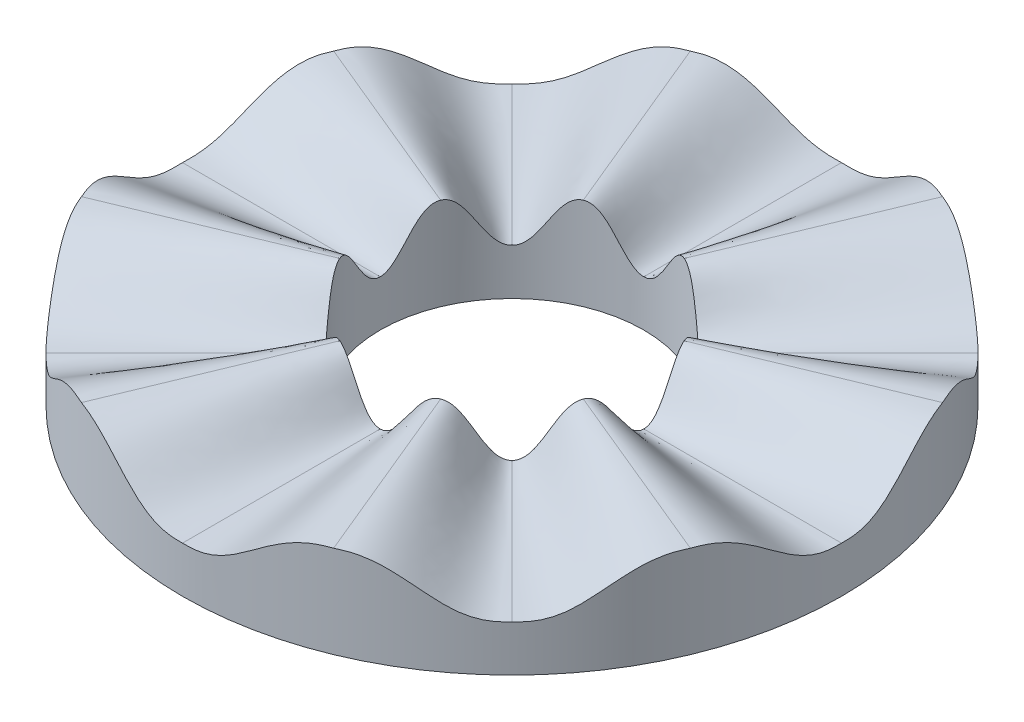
ISO-10303-21;
HEADER;
FILE_DESCRIPTION(('STEP AP214'),'2;1');
FILE_NAME('part.step','',(''),(''),'','','');
FILE_SCHEMA(('AUTOMOTIVE_DESIGN { 1 0 10303 214 1 1 1 1 }'));
ENDSEC;
DATA;
#1=APPLICATION_CONTEXT('core data for automotive mechanical design processes');
#2=APPLICATION_PROTOCOL_DEFINITION('international standard','automotive_design',2000,#1);
#3=PRODUCT_CONTEXT('',#1,'mechanical');
#4=PRODUCT('Part','Part','',(#3));
#5=PRODUCT_RELATED_PRODUCT_CATEGORY('part','',(#4));
#6=PRODUCT_DEFINITION_FORMATION('','',#4);
#7=PRODUCT_DEFINITION_CONTEXT('part definition',#1,'design');
#8=PRODUCT_DEFINITION('design','',#6,#7);
#9=PRODUCT_DEFINITION_SHAPE('','',#8);
#10=(LENGTH_UNIT() NAMED_UNIT(*) SI_UNIT(.MILLI.,.METRE.));
#11=(NAMED_UNIT(*) PLANE_ANGLE_UNIT() SI_UNIT($,.RADIAN.));
#12=(NAMED_UNIT(*) SI_UNIT($,.STERADIAN.) SOLID_ANGLE_UNIT());
#13=UNCERTAINTY_MEASURE_WITH_UNIT(LENGTH_MEASURE(1.E-05),#10,'distance_accuracy_value','');
#14=(GEOMETRIC_REPRESENTATION_CONTEXT(3) GLOBAL_UNCERTAINTY_ASSIGNED_CONTEXT((#13)) GLOBAL_UNIT_ASSIGNED_CONTEXT((#10,
#11,#12)) REPRESENTATION_CONTEXT('',''));
#15=CARTESIAN_POINT('',(0.,0.,0.));
#16=DIRECTION('',(0.,0.,1.));
#17=DIRECTION('',(1.,0.,0.));
#18=AXIS2_PLACEMENT_3D('',#15,#16,#17);
#19=CARTESIAN_POINT('',(-7.65366864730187,7.,-18.4775906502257));
#20=CARTESIAN_POINT('',(-19.1341716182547,7.,-46.1939766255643));
#21=CARTESIAN_POINT('',(-7.54854311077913,7.,-18.5211350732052));
#22=CARTESIAN_POINT('',(-18.9292845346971,7.,-46.2788436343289));
#23=CARTESIAN_POINT('',(-7.33758903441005,6.98157860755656,-18.6063419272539));
#24=CARTESIAN_POINT('',(-18.5184477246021,6.99961671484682,-46.4458208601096));
#25=CARTESIAN_POINT('',(-6.92299582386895,6.8758839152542,-18.7658707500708));
#26=CARTESIAN_POINT('',(-17.6919914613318,7.00291652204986,-46.7689983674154));
#27=CARTESIAN_POINT('',(-6.43745786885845,6.62373134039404,-18.9385783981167));
#28=CARTESIAN_POINT('',(-16.654117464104,6.89084946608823,-47.1510164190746));
#29=CARTESIAN_POINT('',(-5.92250439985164,6.20447186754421,-19.1052270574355));
#30=CARTESIAN_POINT('',(-15.4242310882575,6.58884548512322,-47.5671887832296));
#31=CARTESIAN_POINT('',(-5.46134705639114,5.7183770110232,-19.2416990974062));
#32=CARTESIAN_POINT('',(-14.2256595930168,6.14034113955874,-47.9388733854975));
#33=CARTESIAN_POINT('',(-5.03889516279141,5.1941362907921,-19.3563578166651));
#34=CARTESIAN_POINT('',(-13.0643061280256,5.57780101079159,-48.2679085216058));
#35=CARTESIAN_POINT('',(-4.64199039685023,4.64733084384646,-19.4552000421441));
#36=CARTESIAN_POINT('',(-11.9372995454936,4.93150233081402,-48.5586026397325));
#37=CARTESIAN_POINT('',(-4.26055558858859,4.08784528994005,-19.5421887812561));
#38=CARTESIAN_POINT('',(-10.8361149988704,4.2298227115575,-48.8159354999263));
#39=CARTESIAN_POINT('',(-3.8860133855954,3.52241885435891,-19.6200726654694));
#40=CARTESIAN_POINT('',(-9.74888037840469,3.49742328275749,-49.0445364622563));
#41=CARTESIAN_POINT('',(-3.51063581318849,2.95659039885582,-19.6907243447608));
#42=CARTESIAN_POINT('',(-8.66172933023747,2.75766307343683,-49.2481975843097));
#43=CARTESIAN_POINT('',(-3.12662091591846,2.39587539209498,-19.7554157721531));
#44=CARTESIAN_POINT('',(-7.5549223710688,2.04149631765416,-49.4302877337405));
#45=CARTESIAN_POINT('',(-2.72517001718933,1.84669759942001,-19.8149300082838));
#46=CARTESIAN_POINT('',(-6.4096015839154,1.38219145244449,-49.5921398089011));
#47=CARTESIAN_POINT('',(-2.29570287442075,1.31857038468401,-19.869504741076));
#48=CARTESIAN_POINT('',(-5.21203273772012,0.816162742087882,-49.73269759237));
#49=CARTESIAN_POINT('',(-1.82400925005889,0.826016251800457,-19.9187452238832));
#50=CARTESIAN_POINT('',(-3.95844025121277,0.378105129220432,-49.8485690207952));
#51=CARTESIAN_POINT('',(-1.29254093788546,0.396860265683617,-19.9608728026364));
#52=CARTESIAN_POINT('',(-2.65827953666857,0.0960180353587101,-49.9350996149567));
#53=CARTESIAN_POINT('',(-0.783783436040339,0.132880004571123,-19.9867622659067));
#54=CARTESIAN_POINT('',(-1.55236151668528,-0.00263834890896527,-49.9793523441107));
#55=CARTESIAN_POINT('',(-0.34118857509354,0.0200209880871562,-19.9979850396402));
#56=CARTESIAN_POINT('',(-0.665255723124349,0.000360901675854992,-49.9970466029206));
#57=CARTESIAN_POINT('',(-0.113787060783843,0.,-20.));
#58=CARTESIAN_POINT('',(-0.221768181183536,0.,-50.));
#59=CARTESIAN_POINT('',(0.,0.,-20.));
#60=CARTESIAN_POINT('',(-1.83758917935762E-13,0.,-50.));
#61=B_SPLINE_SURFACE_WITH_KNOTS('',3,1,((#19,#20),(#21,#22),(#23,#24),(#25,#26),(#27,#28),(#29,
#30),(#31,#32),(#33,#34),(#35,#36),(#37,#38),(#39,#40),(#41,#42),(#43,#44),(#45,#46),(#47,#48),
(#49,#50),(#51,#52),(#53,#54),(#55,#56),(#57,#58),(#59,#60)),.UNSPECIFIED.,.F.,.F.,.F.,(4,1,1,1,
1,1,1,1,1,1,1,1,1,1,1,1,1,1,4),(2,2),(0.,0.03125,0.0625,0.125,0.1875,0.25,0.3125,0.375,0.4375,
0.5,0.5625,0.625,0.6875,0.75,0.8125,0.875,0.9375,0.96875,1.),(0.,1.),.UNSPECIFIED.);
#62=CARTESIAN_POINT('',(-7.65366864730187,7.,-18.4775906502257));
#63=CARTESIAN_POINT('',(-7.54854311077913,7.,-18.5211350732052));
#64=CARTESIAN_POINT('',(-7.33758903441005,6.98157860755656,-18.6063419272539));
#65=CARTESIAN_POINT('',(-6.92299582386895,6.8758839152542,-18.7658707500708));
#66=CARTESIAN_POINT('',(-6.43745786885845,6.62373134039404,-18.9385783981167));
#67=CARTESIAN_POINT('',(-5.92250439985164,6.20447186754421,-19.1052270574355));
#68=CARTESIAN_POINT('',(-5.46134705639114,5.7183770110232,-19.2416990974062));
#69=CARTESIAN_POINT('',(-5.03889516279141,5.1941362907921,-19.3563578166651));
#70=CARTESIAN_POINT('',(-4.64199039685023,4.64733084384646,-19.4552000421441));
#71=CARTESIAN_POINT('',(-4.26055558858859,4.08784528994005,-19.5421887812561));
#72=CARTESIAN_POINT('',(-3.8860133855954,3.52241885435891,-19.6200726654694));
#73=CARTESIAN_POINT('',(-3.51063581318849,2.95659039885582,-19.6907243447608));
#74=CARTESIAN_POINT('',(-3.12662091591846,2.39587539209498,-19.7554157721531));
#75=CARTESIAN_POINT('',(-2.72517001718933,1.84669759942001,-19.8149300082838));
#76=CARTESIAN_POINT('',(-2.29570287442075,1.31857038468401,-19.869504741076));
#77=CARTESIAN_POINT('',(-1.82400925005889,0.826016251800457,-19.9187452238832));
#78=CARTESIAN_POINT('',(-1.29254093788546,0.396860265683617,-19.9608728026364));
#79=CARTESIAN_POINT('',(-0.783783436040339,0.132880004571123,-19.9867622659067));
#80=CARTESIAN_POINT('',(-0.34118857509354,0.0200209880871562,-19.9979850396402));
#81=CARTESIAN_POINT('',(-0.113787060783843,0.,-20.));
#82=CARTESIAN_POINT('',(0.,0.,-20.));
#83=B_SPLINE_CURVE_WITH_KNOTS('',3,(#62,#63,#64,#65,#66,#67,#68,#69,#70,#71,#72,#73,#74,#75,#76,
#77,#78,#79,#80,#81,#82),.UNSPECIFIED.,.F.,.F.,(4,1,1,1,1,1,1,1,1,1,1,1,1,1,1,1,1,1,4),(0.,
0.03125,0.0625,0.125,0.1875,0.25,0.3125,0.375,0.4375,0.5,0.5625,0.625,0.6875,0.75,0.8125,0.875,
0.9375,0.96875,1.),.UNSPECIFIED.);
#84=CARTESIAN_POINT('',(-7.65366864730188,7.,-18.4775906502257));
#85=VERTEX_POINT('',#84);
#86=CARTESIAN_POINT('',(0.,0.,-20.));
#87=VERTEX_POINT('',#86);
#88=EDGE_CURVE('E12',#85,#87,#83,.T.);
#89=DIRECTION('',(0.,0.,-1.));
#90=VECTOR('',#89,1.);
#91=CARTESIAN_POINT('',(-1.04083408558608E-13,0.,-35.));
#92=LINE('',#91,#90);
#93=CARTESIAN_POINT('',(-1.38777878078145E-13,0.,-50.));
#94=VERTEX_POINT('',#93);
#95=EDGE_CURVE('E320',#87,#94,#92,.T.);
#96=CARTESIAN_POINT('',(-19.1341716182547,7.,-46.1939766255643));
#97=CARTESIAN_POINT('',(-18.9292845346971,7.,-46.2788436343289));
#98=CARTESIAN_POINT('',(-18.5184477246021,6.99961671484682,-46.4458208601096));
#99=CARTESIAN_POINT('',(-17.6919914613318,7.00291652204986,-46.7689983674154));
#100=CARTESIAN_POINT('',(-16.654117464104,6.89084946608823,-47.1510164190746));
#101=CARTESIAN_POINT('',(-15.4242310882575,6.58884548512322,-47.5671887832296));
#102=CARTESIAN_POINT('',(-14.2256595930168,6.14034113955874,-47.9388733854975));
#103=CARTESIAN_POINT('',(-13.0643061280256,5.57780101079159,-48.2679085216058));
#104=CARTESIAN_POINT('',(-11.9372995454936,4.93150233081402,-48.5586026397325));
#105=CARTESIAN_POINT('',(-10.8361149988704,4.2298227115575,-48.8159354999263));
#106=CARTESIAN_POINT('',(-9.74888037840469,3.49742328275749,-49.0445364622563));
#107=CARTESIAN_POINT('',(-8.66172933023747,2.75766307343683,-49.2481975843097));
#108=CARTESIAN_POINT('',(-7.5549223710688,2.04149631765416,-49.4302877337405));
#109=CARTESIAN_POINT('',(-6.4096015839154,1.38219145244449,-49.5921398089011));
#110=CARTESIAN_POINT('',(-5.21203273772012,0.816162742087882,-49.73269759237));
#111=CARTESIAN_POINT('',(-3.95844025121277,0.378105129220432,-49.8485690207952));
#112=CARTESIAN_POINT('',(-2.65827953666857,0.0960180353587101,-49.9350996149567));
#113=CARTESIAN_POINT('',(-1.55236151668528,-0.00263834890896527,-49.9793523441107));
#114=CARTESIAN_POINT('',(-0.665255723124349,0.000360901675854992,-49.9970466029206));
#115=CARTESIAN_POINT('',(-0.221768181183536,0.,-50.));
#116=CARTESIAN_POINT('',(-1.83758917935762E-13,0.,-50.));
#117=B_SPLINE_CURVE_WITH_KNOTS('',3,(#96,#97,#98,#99,#100,#101,#102,#103,#104,#105,#106,#107,
#108,#109,#110,#111,#112,#113,#114,#115,#116),.UNSPECIFIED.,.F.,.F.,(4,1,1,1,1,1,1,1,1,1,1,1,1,
1,1,1,1,1,4),(0.,0.03125,0.0625,0.125,0.1875,0.25,0.3125,0.375,0.4375,0.5,0.5625,0.625,0.6875,
0.75,0.8125,0.875,0.9375,0.96875,1.),.UNSPECIFIED.);
#118=CARTESIAN_POINT('',(-19.1341716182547,7.,-46.1939766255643));
#119=VERTEX_POINT('',#118);
#120=EDGE_CURVE('E1730',#119,#94,#117,.T.);
#121=DIRECTION('',(-0.382683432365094,0.,-0.923879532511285));
#122=VECTOR('',#121,1.);
#123=CARTESIAN_POINT('',(-13.3939201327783,7.,-32.335783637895));
#124=LINE('',#123,#122);
#125=EDGE_CURVE('E1796',#85,#119,#124,.T.);
#126=ORIENTED_EDGE('',*,*,#88,.T.);
#127=ORIENTED_EDGE('',*,*,#95,.T.);
#128=ORIENTED_EDGE('',*,*,#120,.F.);
#129=ORIENTED_EDGE('',*,*,#125,.F.);
#130=EDGE_LOOP('',(#126,#127,#128,#129));
#131=FACE_BOUND('',#130,.T.);
#132=ADVANCED_FACE('F101',(#131),#61,.T.);
#133=CARTESIAN_POINT('',(0.,-7.,-20.));
#134=DIRECTION('',(0.,-1.,0.));
#135=DIRECTION('',(-0.98078528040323,0.,0.195090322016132));
#136=AXIS2_PLACEMENT_3D('',#133,#134,#135);
#137=PLANE('',#136);
#138=CARTESIAN_POINT('',(0.,-7.,0.));
#139=DIRECTION('',(0.,1.,0.));
#140=DIRECTION('',(-1.,0.,0.));
#141=AXIS2_PLACEMENT_3D('',#138,#139,#140);
#142=CIRCLE('',#141,50.);
#143=CARTESIAN_POINT('',(-1.77635683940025E-13,-7.,-50.));
#144=VERTEX_POINT('',#143);
#145=CARTESIAN_POINT('',(-19.1341716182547,-7.,-46.1939766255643));
#146=VERTEX_POINT('',#145);
#147=EDGE_CURVE('E1745',#144,#146,#142,.T.);
#148=ORIENTED_EDGE('',*,*,#147,.F.);
#149=CARTESIAN_POINT('',(0.,-7.,0.));
#150=DIRECTION('',(0.,-1.,0.));
#151=DIRECTION('',(1.,0.,0.));
#152=AXIS2_PLACEMENT_3D('',#149,#150,#151);
#153=CIRCLE('',#152,50.);
#154=CARTESIAN_POINT('',(19.1341716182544,-7.,-46.1939766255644));
#155=VERTEX_POINT('',#154);
#156=EDGE_CURVE('E119',#144,#155,#153,.T.);
#157=ORIENTED_EDGE('',*,*,#156,.T.);
#158=CARTESIAN_POINT('',(0.,-7.,0.));
#159=DIRECTION('',(0.,1.,0.));
#160=DIRECTION('',(-0.707106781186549,0.,-0.707106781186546));
#161=AXIS2_PLACEMENT_3D('',#158,#159,#160);
#162=CIRCLE('',#161,50.);
#163=CARTESIAN_POINT('',(35.3553390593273,-6.99999999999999,-35.3553390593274));
#164=VERTEX_POINT('',#163);
#165=EDGE_CURVE('E325',#164,#155,#162,.T.);
#166=ORIENTED_EDGE('',*,*,#165,.F.);
#167=CARTESIAN_POINT('',(0.,-7.,0.));
#168=DIRECTION('',(0.,-1.,0.));
#169=DIRECTION('',(0.707106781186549,0.,0.707106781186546));
#170=AXIS2_PLACEMENT_3D('',#167,#168,#169);
#171=CIRCLE('',#170,50.);
#172=CARTESIAN_POINT('',(46.1939766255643,-7.,-19.1341716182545));
#173=VERTEX_POINT('',#172);
#174=EDGE_CURVE('E338',#164,#173,#171,.T.);
#175=ORIENTED_EDGE('',*,*,#174,.T.);
#176=CARTESIAN_POINT('',(0.,-7.,0.));
#177=DIRECTION('',(0.,1.,0.));
#178=DIRECTION('',(0.,0.,-1.));
#179=AXIS2_PLACEMENT_3D('',#176,#177,#178);
#180=CIRCLE('',#179,50.);
#181=CARTESIAN_POINT('',(50.,-6.99999999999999,-6.93889390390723E-13));
#182=VERTEX_POINT('',#181);
#183=EDGE_CURVE('E586',#182,#173,#180,.T.);
#184=ORIENTED_EDGE('',*,*,#183,.F.);
#185=CARTESIAN_POINT('',(0.,-7.,0.));
#186=DIRECTION('',(0.,-1.,0.));
#187=DIRECTION('',(0.,0.,1.));
#188=AXIS2_PLACEMENT_3D('',#185,#186,#187);
#189=CIRCLE('',#188,50.);
#190=CARTESIAN_POINT('',(46.1939766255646,-7.,19.1341716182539));
#191=VERTEX_POINT('',#190);
#192=EDGE_CURVE('E598',#182,#191,#189,.T.);
#193=ORIENTED_EDGE('',*,*,#192,.T.);
#194=CARTESIAN_POINT('',(0.,-7.,0.));
#195=DIRECTION('',(0.,1.,0.));
#196=DIRECTION('',(0.707106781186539,0.,-0.707106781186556));
#197=AXIS2_PLACEMENT_3D('',#194,#195,#196);
#198=CIRCLE('',#197,50.);
#199=CARTESIAN_POINT('',(35.3553390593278,-7.,35.3553390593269));
#200=VERTEX_POINT('',#199);
#201=EDGE_CURVE('E609',#200,#191,#198,.T.);
#202=ORIENTED_EDGE('',*,*,#201,.F.);
#203=CARTESIAN_POINT('',(0.,-7.,0.));
#204=DIRECTION('',(0.,-1.,0.));
#205=DIRECTION('',(-0.707106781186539,0.,0.707106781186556));
#206=AXIS2_PLACEMENT_3D('',#203,#204,#205);
#207=CIRCLE('',#206,50.);
#208=CARTESIAN_POINT('',(19.134171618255,-7.,46.1939766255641));
#209=VERTEX_POINT('',#208);
#210=EDGE_CURVE('E620',#200,#209,#207,.T.);
#211=ORIENTED_EDGE('',*,*,#210,.T.);
#212=CARTESIAN_POINT('',(0.,-7.,0.));
#213=DIRECTION('',(0.,1.,0.));
#214=DIRECTION('',(1.,0.,0.));
#215=AXIS2_PLACEMENT_3D('',#212,#213,#214);
#216=CIRCLE('',#215,50.);
#217=CARTESIAN_POINT('',(5.26783817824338E-13,-7.,50.));
#218=VERTEX_POINT('',#217);
#219=EDGE_CURVE('E631',#218,#209,#216,.T.);
#220=ORIENTED_EDGE('',*,*,#219,.F.);
#221=CARTESIAN_POINT('',(0.,-7.,0.));
#222=DIRECTION('',(0.,-1.,0.));
#223=DIRECTION('',(-1.,0.,0.));
#224=AXIS2_PLACEMENT_3D('',#221,#222,#223);
#225=CIRCLE('',#224,50.);
#226=CARTESIAN_POINT('',(-19.1341716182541,-7.,46.1939766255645));
#227=VERTEX_POINT('',#226);
#228=EDGE_CURVE('E642',#218,#227,#225,.T.);
#229=ORIENTED_EDGE('',*,*,#228,.T.);
#230=CARTESIAN_POINT('',(0.,-7.,0.));
#231=DIRECTION('',(0.,1.,0.));
#232=DIRECTION('',(0.707106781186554,0.,0.707106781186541));
#233=AXIS2_PLACEMENT_3D('',#230,#231,#232);
#234=CIRCLE('',#233,50.);
#235=CARTESIAN_POINT('',(-35.3553390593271,-7.,35.3553390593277));
#236=VERTEX_POINT('',#235);
#237=EDGE_CURVE('E653',#236,#227,#234,.T.);
#238=ORIENTED_EDGE('',*,*,#237,.F.);
#239=CARTESIAN_POINT('',(0.,-7.,0.));
#240=DIRECTION('',(0.,-1.,0.));
#241=DIRECTION('',(-0.707106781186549,0.,-0.707106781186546));
#242=AXIS2_PLACEMENT_3D('',#239,#240,#241);
#243=CIRCLE('',#242,50.);
#244=CARTESIAN_POINT('',(-46.1939766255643,-7.,19.1341716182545));
#245=VERTEX_POINT('',#244);
#246=EDGE_CURVE('E664',#236,#245,#243,.T.);
#247=ORIENTED_EDGE('',*,*,#246,.T.);
#248=CARTESIAN_POINT('',(0.,-7.,0.));
#249=DIRECTION('',(0.,1.,0.));
#250=DIRECTION('',(0.,0.,1.));
#251=AXIS2_PLACEMENT_3D('',#248,#249,#250);
#252=CIRCLE('',#251,50.);
#253=CARTESIAN_POINT('',(-50.,-7.,0.));
#254=VERTEX_POINT('',#253);
#255=EDGE_CURVE('E675',#254,#245,#252,.T.);
#256=ORIENTED_EDGE('',*,*,#255,.F.);
#257=CARTESIAN_POINT('',(0.,-7.,0.));
#258=DIRECTION('',(0.,-1.,0.));
#259=DIRECTION('',(0.,0.,-1.));
#260=AXIS2_PLACEMENT_3D('',#257,#258,#259);
#261=CIRCLE('',#260,50.);
#262=CARTESIAN_POINT('',(-46.1939766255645,-7.,-19.1341716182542));
#263=VERTEX_POINT('',#262);
#264=EDGE_CURVE('E686',#254,#263,#261,.T.);
#265=ORIENTED_EDGE('',*,*,#264,.T.);
#266=CARTESIAN_POINT('',(0.,-7.,0.));
#267=DIRECTION('',(0.,1.,0.));
#268=DIRECTION('',(-0.707106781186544,0.,0.707106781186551));
#269=AXIS2_PLACEMENT_3D('',#266,#267,#268);
#270=CIRCLE('',#269,50.);
#271=CARTESIAN_POINT('',(-35.3553390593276,-7.,-35.3553390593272));
#272=VERTEX_POINT('',#271);
#273=EDGE_CURVE('E695',#272,#263,#270,.T.);
#274=ORIENTED_EDGE('',*,*,#273,.F.);
#275=CARTESIAN_POINT('',(0.,-7.,0.));
#276=DIRECTION('',(0.,-1.,0.));
#277=DIRECTION('',(0.707106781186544,0.,-0.707106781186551));
#278=AXIS2_PLACEMENT_3D('',#275,#276,#277);
#279=CIRCLE('',#278,50.);
#280=EDGE_CURVE('E696',#272,#146,#279,.T.);
#281=ORIENTED_EDGE('',*,*,#280,.T.);
#282=EDGE_LOOP('',(#148,#157,#166,#175,#184,#193,#202,#211,#220,#229,#238,#247,#256,#265,#274,#281));
#283=FACE_BOUND('',#282,.T.);
#284=CARTESIAN_POINT('',(0.,-7.,0.));
#285=DIRECTION('',(0.,1.,0.));
#286=DIRECTION('',(-1.,0.,0.));
#287=AXIS2_PLACEMENT_3D('',#284,#285,#286);
#288=CIRCLE('',#287,20.);
#289=CARTESIAN_POINT('',(0.,-6.99999999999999,-20.));
#290=VERTEX_POINT('',#289);
#291=CARTESIAN_POINT('',(-7.65366864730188,-7.,-18.4775906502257));
#292=VERTEX_POINT('',#291);
#293=EDGE_CURVE('E113',#290,#292,#288,.T.);
#294=ORIENTED_EDGE('',*,*,#293,.T.);
#295=CARTESIAN_POINT('',(0.,-7.,0.));
#296=DIRECTION('',(0.,-1.,0.));
#297=DIRECTION('',(0.707106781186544,0.,-0.707106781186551));
#298=AXIS2_PLACEMENT_3D('',#295,#296,#297);
#299=CIRCLE('',#298,20.);
#300=CARTESIAN_POINT('',(-14.142135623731,-6.99999999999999,-14.1421356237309));
#301=VERTEX_POINT('',#300);
#302=EDGE_CURVE('E1807',#301,#292,#299,.T.);
#303=ORIENTED_EDGE('',*,*,#302,.F.);
#304=CARTESIAN_POINT('',(0.,-7.,0.));
#305=DIRECTION('',(0.,1.,0.));
#306=DIRECTION('',(-0.707106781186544,0.,0.707106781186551));
#307=AXIS2_PLACEMENT_3D('',#304,#305,#306);
#308=CIRCLE('',#307,20.);
#309=CARTESIAN_POINT('',(-18.4775906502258,-7.,-7.65366864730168));
#310=VERTEX_POINT('',#309);
#311=EDGE_CURVE('E703',#301,#310,#308,.T.);
#312=ORIENTED_EDGE('',*,*,#311,.T.);
#313=CARTESIAN_POINT('',(0.,-7.,0.));
#314=DIRECTION('',(0.,-1.,0.));
#315=DIRECTION('',(0.,0.,-1.));
#316=AXIS2_PLACEMENT_3D('',#313,#314,#315);
#317=CIRCLE('',#316,20.);
#318=CARTESIAN_POINT('',(-20.,-6.99999999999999,1.42247325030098E-13));
#319=VERTEX_POINT('',#318);
#320=EDGE_CURVE('E779',#319,#310,#317,.T.);
#321=ORIENTED_EDGE('',*,*,#320,.F.);
#322=CARTESIAN_POINT('',(0.,-7.,0.));
#323=DIRECTION('',(0.,1.,0.));
#324=DIRECTION('',(0.,0.,1.));
#325=AXIS2_PLACEMENT_3D('',#322,#323,#324);
#326=CIRCLE('',#325,20.);
#327=CARTESIAN_POINT('',(-18.4775906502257,-7.,7.65366864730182));
#328=VERTEX_POINT('',#327);
#329=EDGE_CURVE('E801',#319,#328,#326,.T.);
#330=ORIENTED_EDGE('',*,*,#329,.T.);
#331=CARTESIAN_POINT('',(0.,-7.,0.));
#332=DIRECTION('',(0.,-1.,0.));
#333=DIRECTION('',(-0.707106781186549,0.,-0.707106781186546));
#334=AXIS2_PLACEMENT_3D('',#331,#332,#333);
#335=CIRCLE('',#334,20.);
#336=CARTESIAN_POINT('',(-14.1421356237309,-6.99999999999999,14.142135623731));
#337=VERTEX_POINT('',#336);
#338=EDGE_CURVE('E876',#337,#328,#335,.T.);
#339=ORIENTED_EDGE('',*,*,#338,.F.);
#340=CARTESIAN_POINT('',(0.,-7.,0.));
#341=DIRECTION('',(0.,1.,0.));
#342=DIRECTION('',(0.707106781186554,0.,0.707106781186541));
#343=AXIS2_PLACEMENT_3D('',#340,#341,#342);
#344=CIRCLE('',#343,20.);
#345=CARTESIAN_POINT('',(-7.65366864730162,-7.,18.4775906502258));
#346=VERTEX_POINT('',#345);
#347=EDGE_CURVE('E900',#337,#346,#344,.T.);
#348=ORIENTED_EDGE('',*,*,#347,.T.);
#349=CARTESIAN_POINT('',(0.,-7.,0.));
#350=DIRECTION('',(0.,-1.,0.));
#351=DIRECTION('',(-1.,0.,0.));
#352=AXIS2_PLACEMENT_3D('',#349,#350,#351);
#353=CIRCLE('',#352,20.);
#354=CARTESIAN_POINT('',(2.1163626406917E-13,-6.99999999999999,20.));
#355=VERTEX_POINT('',#354);
#356=EDGE_CURVE('E973',#355,#346,#353,.T.);
#357=ORIENTED_EDGE('',*,*,#356,.F.);
#358=CARTESIAN_POINT('',(0.,-7.,0.));
#359=DIRECTION('',(0.,1.,0.));
#360=DIRECTION('',(1.,0.,0.));
#361=AXIS2_PLACEMENT_3D('',#358,#359,#360);
#362=CIRCLE('',#361,20.);
#363=CARTESIAN_POINT('',(7.65366864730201,-7.,18.4775906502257));
#364=VERTEX_POINT('',#363);
#365=EDGE_CURVE('E997',#355,#364,#362,.T.);
#366=ORIENTED_EDGE('',*,*,#365,.T.);
#367=CARTESIAN_POINT('',(0.,-7.,0.));
#368=DIRECTION('',(0.,-1.,0.));
#369=DIRECTION('',(-0.707106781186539,0.,0.707106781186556));
#370=AXIS2_PLACEMENT_3D('',#367,#368,#369);
#371=CIRCLE('',#370,20.);
#372=CARTESIAN_POINT('',(14.1421356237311,-6.99999999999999,14.1421356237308));
#373=VERTEX_POINT('',#372);
#374=EDGE_CURVE('E1069',#373,#364,#371,.T.);
#375=ORIENTED_EDGE('',*,*,#374,.F.);
#376=CARTESIAN_POINT('',(0.,-7.,0.));
#377=DIRECTION('',(0.,1.,0.));
#378=DIRECTION('',(0.707106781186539,0.,-0.707106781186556));
#379=AXIS2_PLACEMENT_3D('',#376,#377,#378);
#380=CIRCLE('',#379,20.);
#381=CARTESIAN_POINT('',(18.4775906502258,-7.,7.65366864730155));
#382=VERTEX_POINT('',#381);
#383=EDGE_CURVE('E1093',#373,#382,#380,.T.);
#384=ORIENTED_EDGE('',*,*,#383,.T.);
#385=CARTESIAN_POINT('',(0.,-7.,0.));
#386=DIRECTION('',(0.,-1.,0.));
#387=DIRECTION('',(0.,0.,1.));
#388=AXIS2_PLACEMENT_3D('',#385,#386,#387);
#389=CIRCLE('',#388,20.);
#390=CARTESIAN_POINT('',(20.,-7.,0.));
#391=VERTEX_POINT('',#390);
#392=EDGE_CURVE('E1160',#391,#382,#389,.T.);
#393=ORIENTED_EDGE('',*,*,#392,.F.);
#394=CARTESIAN_POINT('',(0.,-7.,0.));
#395=DIRECTION('',(0.,1.,0.));
#396=DIRECTION('',(0.,0.,-1.));
#397=AXIS2_PLACEMENT_3D('',#394,#395,#396);
#398=CIRCLE('',#397,20.);
#399=CARTESIAN_POINT('',(18.4775906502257,-7.,-7.65366864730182));
#400=VERTEX_POINT('',#399);
#401=EDGE_CURVE('E1199',#391,#400,#398,.T.);
#402=ORIENTED_EDGE('',*,*,#401,.T.);
#403=CARTESIAN_POINT('',(0.,-7.,0.));
#404=DIRECTION('',(0.,-1.,0.));
#405=DIRECTION('',(0.707106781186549,0.,0.707106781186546));
#406=AXIS2_PLACEMENT_3D('',#403,#404,#405);
#407=CIRCLE('',#406,20.);
#408=CARTESIAN_POINT('',(14.1421356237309,-7.,-14.142135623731));
#409=VERTEX_POINT('',#408);
#410=EDGE_CURVE('E498',#409,#400,#407,.T.);
#411=ORIENTED_EDGE('',*,*,#410,.F.);
#412=CARTESIAN_POINT('',(0.,-7.,0.));
#413=DIRECTION('',(0.,1.,0.));
#414=DIRECTION('',(-0.707106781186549,0.,-0.707106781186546));
#415=AXIS2_PLACEMENT_3D('',#412,#413,#414);
#416=CIRCLE('',#415,20.);
#417=CARTESIAN_POINT('',(7.65366864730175,-7.,-18.4775906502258));
#418=VERTEX_POINT('',#417);
#419=EDGE_CURVE('E339',#409,#418,#416,.T.);
#420=ORIENTED_EDGE('',*,*,#419,.T.);
#421=CARTESIAN_POINT('',(0.,-7.,0.));
#422=DIRECTION('',(0.,-1.,0.));
#423=DIRECTION('',(1.,0.,0.));
#424=AXIS2_PLACEMENT_3D('',#421,#422,#423);
#425=CIRCLE('',#424,20.);
#426=EDGE_CURVE('E346',#290,#418,#425,.T.);
#427=ORIENTED_EDGE('',*,*,#426,.F.);
#428=EDGE_LOOP('',(#294,#303,#312,#321,#330,#339,#348,#357,#366,#375,#384,#393,#402,#411,#420,#427));
#429=FACE_BOUND('',#428,.T.);
#430=ADVANCED_FACE('F103',(#283,#429),#137,.T.);
#431=CARTESIAN_POINT('',(0.,20.,0.));
#432=DIRECTION('',(0.,-1.,0.));
#433=DIRECTION('',(-1.,0.,0.));
#434=AXIS2_PLACEMENT_3D('',#431,#432,#433);
#435=CYLINDRICAL_SURFACE('',#434,20.);
#436=ORIENTED_EDGE('',*,*,#293,.F.);
#437=ORIENTED_EDGE('',*,*,#426,.T.);
#438=ORIENTED_EDGE('',*,*,#419,.F.);
#439=ORIENTED_EDGE('',*,*,#410,.T.);
#440=ORIENTED_EDGE('',*,*,#401,.F.);
#441=ORIENTED_EDGE('',*,*,#392,.T.);
#442=ORIENTED_EDGE('',*,*,#383,.F.);
#443=ORIENTED_EDGE('',*,*,#374,.T.);
#444=ORIENTED_EDGE('',*,*,#365,.F.);
#445=ORIENTED_EDGE('',*,*,#356,.T.);
#446=ORIENTED_EDGE('',*,*,#347,.F.);
#447=ORIENTED_EDGE('',*,*,#338,.T.);
#448=ORIENTED_EDGE('',*,*,#329,.F.);
#449=ORIENTED_EDGE('',*,*,#320,.T.);
#450=ORIENTED_EDGE('',*,*,#311,.F.);
#451=ORIENTED_EDGE('',*,*,#302,.T.);
#452=EDGE_LOOP('',(#436,#437,#438,#439,#440,#441,#442,#443,#444,#445,#446,#447,#448,#449,#450,#451));
#453=FACE_BOUND('',#452,.T.);
#454=CARTESIAN_POINT('',(0.,0.,-20.));
#455=CARTESIAN_POINT('',(0.113787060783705,0.,-20.));
#456=CARTESIAN_POINT('',(0.341188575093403,0.0200209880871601,-19.9979850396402));
#457=CARTESIAN_POINT('',(0.783783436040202,0.132880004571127,-19.9867622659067));
#458=CARTESIAN_POINT('',(1.29254093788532,0.396860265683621,-19.9608728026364));
#459=CARTESIAN_POINT('',(1.82400925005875,0.82601625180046,-19.9187452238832));
#460=CARTESIAN_POINT('',(2.29570287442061,1.31857038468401,-19.869504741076));
#461=CARTESIAN_POINT('',(2.72517001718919,1.84669759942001,-19.8149300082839));
#462=CARTESIAN_POINT('',(3.12662091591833,2.39587539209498,-19.7554157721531));
#463=CARTESIAN_POINT('',(3.51063581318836,2.95659039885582,-19.6907243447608));
#464=CARTESIAN_POINT('',(3.88601338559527,3.52241885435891,-19.6200726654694));
#465=CARTESIAN_POINT('',(4.26055558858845,4.08784528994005,-19.5421887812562));
#466=CARTESIAN_POINT('',(4.6419903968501,4.64733084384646,-19.4552000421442));
#467=CARTESIAN_POINT('',(5.03889516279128,5.1941362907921,-19.3563578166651));
#468=CARTESIAN_POINT('',(5.46134705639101,5.7183770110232,-19.2416990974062));
#469=CARTESIAN_POINT('',(5.92250439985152,6.20447186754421,-19.1052270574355));
#470=CARTESIAN_POINT('',(6.43745786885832,6.62373134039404,-18.9385783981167));
#471=CARTESIAN_POINT('',(6.92299582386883,6.8758839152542,-18.7658707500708));
#472=CARTESIAN_POINT('',(7.33758903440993,6.98157860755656,-18.6063419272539));
#473=CARTESIAN_POINT('',(7.548543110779,7.,-18.5211350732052));
#474=CARTESIAN_POINT('',(7.65366864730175,7.,-18.4775906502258));
#475=B_SPLINE_CURVE_WITH_KNOTS('',3,(#454,#455,#456,#457,#458,#459,#460,#461,#462,#463,#464,
#465,#466,#467,#468,#469,#470,#471,#472,#473,#474),.UNSPECIFIED.,.F.,.F.,(4,1,1,1,1,1,1,1,1,1,1,
1,1,1,1,1,1,1,4),(0.,0.03125,0.0625,0.125,0.1875,0.25,0.3125,0.375,0.4375,0.5,0.5625,0.625,
0.6875,0.75,0.8125,0.875,0.9375,0.96875,1.),.UNSPECIFIED.);
#476=CARTESIAN_POINT('',(7.65366864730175,7.,-18.4775906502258));
#477=VERTEX_POINT('',#476);
#478=EDGE_CURVE('E311',#477,#87,#475,.F.);
#479=ORIENTED_EDGE('',*,*,#478,.T.);
#480=ORIENTED_EDGE('',*,*,#88,.F.);
#481=CARTESIAN_POINT('',(-14.142135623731,0.,-14.1421356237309));
#482=CARTESIAN_POINT('',(-14.0616760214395,0.,-14.2225952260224));
#483=CARTESIAN_POINT('',(-13.8994540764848,0.0200209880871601,-14.3819675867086));
#484=CARTESIAN_POINT('',(-13.5785565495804,0.132880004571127,-14.6869937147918));
#485=CARTESIAN_POINT('',(-13.2005040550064,0.396860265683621,-15.0284329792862));
#486=CARTESIAN_POINT('',(-12.7949105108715,0.82601625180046,-15.3744491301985));
#487=CARTESIAN_POINT('',(-12.4265544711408,1.31857038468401,-15.6731686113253));
#488=CARTESIAN_POINT('',(-12.0842851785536,1.84669759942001,-15.938257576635));
#489=CARTESIAN_POINT('',(-11.7583336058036,2.39587539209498,-16.1800433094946));
#490=CARTESIAN_POINT('',(-11.4410503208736,2.95659039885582,-16.4058391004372));
#491=CARTESIAN_POINT('',(-11.1256600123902,3.52241885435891,-16.6213128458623));
#492=CARTESIAN_POINT('',(-10.8057464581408,4.08784528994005,-16.831081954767));
#493=CARTESIAN_POINT('',(-10.4745209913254,4.64733084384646,-17.0392867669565));
#494=CARTESIAN_POINT('',(-10.1239749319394,5.1941362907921,-17.2500488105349));
#495=CARTESIAN_POINT('',(-9.74418037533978,5.7183770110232,-17.4676914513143));
#496=CARTESIAN_POINT('',(-9.32159258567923,6.20447186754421,-17.6972786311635));
#497=CARTESIAN_POINT('',(-8.83962709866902,6.62373134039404,-17.9435673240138));
#498=CARTESIAN_POINT('',(-8.37417716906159,6.8758839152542,-18.1647717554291));
#499=CARTESIAN_POINT('',(-7.96821158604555,6.98157860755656,-18.3451295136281));
#500=CARTESIAN_POINT('',(-7.75879418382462,7.,-18.4340462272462));
#501=CARTESIAN_POINT('',(-7.65366864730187,7.,-18.4775906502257));
#502=B_SPLINE_CURVE_WITH_KNOTS('',3,(#481,#482,#483,#484,#485,#486,#487,#488,#489,#490,#491,
#492,#493,#494,#495,#496,#497,#498,#499,#500,#501),.UNSPECIFIED.,.F.,.F.,(4,1,1,1,1,1,1,1,1,1,1,
1,1,1,1,1,1,1,4),(0.,0.03125,0.0625,0.125,0.1875,0.25,0.3125,0.375,0.4375,0.5,0.5625,0.625,
0.6875,0.75,0.8125,0.875,0.9375,0.96875,1.),.UNSPECIFIED.);
#503=CARTESIAN_POINT('',(-14.142135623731,0.,-14.1421356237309));
#504=VERTEX_POINT('',#503);
#505=EDGE_CURVE('E1775',#85,#504,#502,.F.);
#506=ORIENTED_EDGE('',*,*,#505,.T.);
#507=CARTESIAN_POINT('',(-18.4775906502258,7.,-7.65366864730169));
#508=CARTESIAN_POINT('',(-18.4340462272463,7.,-7.75879418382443));
#509=CARTESIAN_POINT('',(-18.3451295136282,6.98157860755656,-7.96821158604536));
#510=CARTESIAN_POINT('',(-18.1647717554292,6.8758839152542,-8.37417716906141));
#511=CARTESIAN_POINT('',(-17.9435673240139,6.62373134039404,-8.83962709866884));
#512=CARTESIAN_POINT('',(-17.6972786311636,6.20447186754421,-9.32159258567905));
#513=CARTESIAN_POINT('',(-17.4676914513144,5.7183770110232,-9.7441803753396));
#514=CARTESIAN_POINT('',(-17.250048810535,5.1941362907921,-10.1239749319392));
#515=CARTESIAN_POINT('',(-17.0392867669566,4.64733084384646,-10.4745209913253));
#516=CARTESIAN_POINT('',(-16.8310819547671,4.08784528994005,-10.8057464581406));
#517=CARTESIAN_POINT('',(-16.6213128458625,3.52241885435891,-11.12566001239));
#518=CARTESIAN_POINT('',(-16.4058391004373,2.95659039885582,-11.4410503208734));
#519=CARTESIAN_POINT('',(-16.1800433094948,2.39587539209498,-11.7583336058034));
#520=CARTESIAN_POINT('',(-15.9382575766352,1.84669759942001,-12.0842851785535));
#521=CARTESIAN_POINT('',(-15.6731686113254,1.31857038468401,-12.4265544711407));
#522=CARTESIAN_POINT('',(-15.3744491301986,0.826016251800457,-12.7949105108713));
#523=CARTESIAN_POINT('',(-15.0284329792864,0.396860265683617,-13.2005040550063));
#524=CARTESIAN_POINT('',(-14.6869937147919,0.132880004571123,-13.5785565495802));
#525=CARTESIAN_POINT('',(-14.3819675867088,0.0200209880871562,-13.8994540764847));
#526=CARTESIAN_POINT('',(-14.2225952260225,0.,-14.0616760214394));
#527=CARTESIAN_POINT('',(-14.142135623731,0.,-14.1421356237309));
#528=B_SPLINE_CURVE_WITH_KNOTS('',3,(#507,#508,#509,#510,#511,#512,#513,#514,#515,#516,#517,
#518,#519,#520,#521,#522,#523,#524,#525,#526,#527),.UNSPECIFIED.,.F.,.F.,(4,1,1,1,1,1,1,1,1,1,1,
1,1,1,1,1,1,1,4),(0.,0.03125,0.0625,0.125,0.1875,0.25,0.3125,0.375,0.4375,0.5,0.5625,0.625,
0.6875,0.75,0.8125,0.875,0.9375,0.96875,1.),.UNSPECIFIED.);
#529=CARTESIAN_POINT('',(-18.4775906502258,7.,-7.65366864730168));
#530=VERTEX_POINT('',#529);
#531=EDGE_CURVE('E1819',#530,#504,#528,.T.);
#532=ORIENTED_EDGE('',*,*,#531,.F.);
#533=CARTESIAN_POINT('',(-20.,0.,1.38777878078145E-13));
#534=CARTESIAN_POINT('',(-20.,0.,-0.113787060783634));
#535=CARTESIAN_POINT('',(-19.9979850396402,0.0200209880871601,-0.341188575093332));
#536=CARTESIAN_POINT('',(-19.9867622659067,0.132880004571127,-0.783783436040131));
#537=CARTESIAN_POINT('',(-19.9608728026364,0.396860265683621,-1.29254093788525));
#538=CARTESIAN_POINT('',(-19.9187452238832,0.82601625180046,-1.82400925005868));
#539=CARTESIAN_POINT('',(-19.869504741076,1.31857038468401,-2.29570287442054));
#540=CARTESIAN_POINT('',(-19.8149300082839,1.84669759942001,-2.72517001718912));
#541=CARTESIAN_POINT('',(-19.7554157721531,2.39587539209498,-3.12662091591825));
#542=CARTESIAN_POINT('',(-19.6907243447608,2.95659039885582,-3.51063581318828));
#543=CARTESIAN_POINT('',(-19.6200726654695,3.52241885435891,-3.8860133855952));
#544=CARTESIAN_POINT('',(-19.5421887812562,4.08784528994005,-4.26055558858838));
#545=CARTESIAN_POINT('',(-19.4552000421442,4.64733084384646,-4.64199039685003));
#546=CARTESIAN_POINT('',(-19.3563578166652,5.1941362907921,-5.03889516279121));
#547=CARTESIAN_POINT('',(-19.2416990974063,5.7183770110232,-5.46134705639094));
#548=CARTESIAN_POINT('',(-19.1052270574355,6.20447186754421,-5.92250439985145));
#549=CARTESIAN_POINT('',(-18.9385783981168,6.62373134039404,-6.43745786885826));
#550=CARTESIAN_POINT('',(-18.7658707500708,6.8758839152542,-6.92299582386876));
#551=CARTESIAN_POINT('',(-18.606341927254,6.98157860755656,-7.33758903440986));
#552=CARTESIAN_POINT('',(-18.5211350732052,7.,-7.54854311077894));
#553=CARTESIAN_POINT('',(-18.4775906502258,7.,-7.65366864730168));
#554=B_SPLINE_CURVE_WITH_KNOTS('',3,(#533,#534,#535,#536,#537,#538,#539,#540,#541,#542,#543,
#544,#545,#546,#547,#548,#549,#550,#551,#552,#553),.UNSPECIFIED.,.F.,.F.,(4,1,1,1,1,1,1,1,1,1,1,
1,1,1,1,1,1,1,4),(0.,0.03125,0.0625,0.125,0.1875,0.25,0.3125,0.375,0.4375,0.5,0.5625,0.625,
0.6875,0.75,0.8125,0.875,0.9375,0.96875,1.),.UNSPECIFIED.);
#555=CARTESIAN_POINT('',(-20.,0.,1.42247325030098E-13));
#556=VERTEX_POINT('',#555);
#557=EDGE_CURVE('E700',#530,#556,#554,.F.);
#558=ORIENTED_EDGE('',*,*,#557,.T.);
#559=CARTESIAN_POINT('',(-18.4775906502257,7.,7.65366864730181));
#560=CARTESIAN_POINT('',(-18.5211350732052,7.,7.54854311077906));
#561=CARTESIAN_POINT('',(-18.6063419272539,6.98157860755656,7.33758903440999));
#562=CARTESIAN_POINT('',(-18.7658707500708,6.8758839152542,6.92299582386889));
#563=CARTESIAN_POINT('',(-18.9385783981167,6.62373134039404,6.43745786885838));
#564=CARTESIAN_POINT('',(-19.1052270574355,6.20447186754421,5.92250439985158));
#565=CARTESIAN_POINT('',(-19.2416990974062,5.7183770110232,5.46134705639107));
#566=CARTESIAN_POINT('',(-19.3563578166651,5.1941362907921,5.03889516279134));
#567=CARTESIAN_POINT('',(-19.4552000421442,4.64733084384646,4.64199039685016));
#568=CARTESIAN_POINT('',(-19.5421887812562,4.08784528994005,4.26055558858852));
#569=CARTESIAN_POINT('',(-19.6200726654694,3.52241885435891,3.88601338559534));
#570=CARTESIAN_POINT('',(-19.6907243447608,2.95659039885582,3.51063581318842));
#571=CARTESIAN_POINT('',(-19.7554157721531,2.39587539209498,3.12662091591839));
#572=CARTESIAN_POINT('',(-19.8149300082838,1.84669759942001,2.72517001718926));
#573=CARTESIAN_POINT('',(-19.869504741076,1.31857038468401,2.29570287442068));
#574=CARTESIAN_POINT('',(-19.9187452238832,0.826016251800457,1.82400925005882));
#575=CARTESIAN_POINT('',(-19.9608728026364,0.396860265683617,1.29254093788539));
#576=CARTESIAN_POINT('',(-19.9867622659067,0.132880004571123,0.783783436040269));
#577=CARTESIAN_POINT('',(-19.9979850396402,0.0200209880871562,0.34118857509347));
#578=CARTESIAN_POINT('',(-20.,0.,0.113787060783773));
#579=CARTESIAN_POINT('',(-20.,0.,0.));
#580=B_SPLINE_CURVE_WITH_KNOTS('',3,(#559,#560,#561,#562,#563,#564,#565,#566,#567,#568,#569,
#570,#571,#572,#573,#574,#575,#576,#577,#578,#579),.UNSPECIFIED.,.F.,.F.,(4,1,1,1,1,1,1,1,1,1,1,
1,1,1,1,1,1,1,4),(0.,0.03125,0.0625,0.125,0.1875,0.25,0.3125,0.375,0.4375,0.5,0.5625,0.625,
0.6875,0.75,0.8125,0.875,0.9375,0.96875,1.),.UNSPECIFIED.);
#581=CARTESIAN_POINT('',(-18.4775906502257,7.,7.65366864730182));
#582=VERTEX_POINT('',#581);
#583=EDGE_CURVE('E805',#582,#556,#580,.T.);
#584=ORIENTED_EDGE('',*,*,#583,.F.);
#585=CARTESIAN_POINT('',(-14.1421356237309,0.,14.142135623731));
#586=CARTESIAN_POINT('',(-14.2225952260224,0.,14.0616760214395));
#587=CARTESIAN_POINT('',(-14.3819675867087,0.0200209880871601,13.8994540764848));
#588=CARTESIAN_POINT('',(-14.6869937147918,0.132880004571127,13.5785565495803));
#589=CARTESIAN_POINT('',(-15.0284329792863,0.396860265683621,13.2005040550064));
#590=CARTESIAN_POINT('',(-15.3744491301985,0.82601625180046,12.7949105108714));
#591=CARTESIAN_POINT('',(-15.6731686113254,1.31857038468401,12.4265544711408));
#592=CARTESIAN_POINT('',(-15.9382575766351,1.84669759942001,12.0842851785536));
#593=CARTESIAN_POINT('',(-16.1800433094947,2.39587539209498,11.7583336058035));
#594=CARTESIAN_POINT('',(-16.4058391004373,2.95659039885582,11.4410503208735));
#595=CARTESIAN_POINT('',(-16.6213128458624,3.52241885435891,11.1256600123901));
#596=CARTESIAN_POINT('',(-16.8310819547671,4.08784528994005,10.8057464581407));
#597=CARTESIAN_POINT('',(-17.0392867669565,4.64733084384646,10.4745209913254));
#598=CARTESIAN_POINT('',(-17.250048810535,5.1941362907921,10.1239749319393));
#599=CARTESIAN_POINT('',(-17.4676914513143,5.7183770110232,9.74418037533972));
#600=CARTESIAN_POINT('',(-17.6972786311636,6.20447186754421,9.32159258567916));
#601=CARTESIAN_POINT('',(-17.9435673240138,6.62373134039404,8.83962709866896));
#602=CARTESIAN_POINT('',(-18.1647717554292,6.8758839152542,8.37417716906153));
#603=CARTESIAN_POINT('',(-18.3451295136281,6.98157860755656,7.96821158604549));
#604=CARTESIAN_POINT('',(-18.4340462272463,7.,7.75879418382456));
#605=CARTESIAN_POINT('',(-18.4775906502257,7.,7.65366864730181));
#606=B_SPLINE_CURVE_WITH_KNOTS('',3,(#585,#586,#587,#588,#589,#590,#591,#592,#593,#594,#595,
#596,#597,#598,#599,#600,#601,#602,#603,#604,#605),.UNSPECIFIED.,.F.,.F.,(4,1,1,1,1,1,1,1,1,1,1,
1,1,1,1,1,1,1,4),(0.,0.03125,0.0625,0.125,0.1875,0.25,0.3125,0.375,0.4375,0.5,0.5625,0.625,
0.6875,0.75,0.8125,0.875,0.9375,0.96875,1.),.UNSPECIFIED.);
#607=CARTESIAN_POINT('',(-14.1421356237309,0.,14.142135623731));
#608=VERTEX_POINT('',#607);
#609=EDGE_CURVE('E895',#582,#608,#606,.F.);
#610=ORIENTED_EDGE('',*,*,#609,.T.);
#611=CARTESIAN_POINT('',(-7.65366864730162,7.,18.4775906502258));
#612=CARTESIAN_POINT('',(-7.75879418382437,7.,18.4340462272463));
#613=CARTESIAN_POINT('',(-7.9682115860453,6.98157860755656,18.3451295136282));
#614=CARTESIAN_POINT('',(-8.37417716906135,6.8758839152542,18.1647717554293));
#615=CARTESIAN_POINT('',(-8.83962709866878,6.62373134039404,17.9435673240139));
#616=CARTESIAN_POINT('',(-9.32159258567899,6.20447186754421,17.6972786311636));
#617=CARTESIAN_POINT('',(-9.74418037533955,5.7183770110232,17.4676914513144));
#618=CARTESIAN_POINT('',(-10.1239749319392,5.1941362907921,17.2500488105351));
#619=CARTESIAN_POINT('',(-10.4745209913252,4.64733084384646,17.0392867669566));
#620=CARTESIAN_POINT('',(-10.8057464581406,4.08784528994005,16.8310819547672));
#621=CARTESIAN_POINT('',(-11.12566001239,3.52241885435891,16.6213128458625));
#622=CARTESIAN_POINT('',(-11.4410503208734,2.95659039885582,16.4058391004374));
#623=CARTESIAN_POINT('',(-11.7583336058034,2.39587539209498,16.1800433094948));
#624=CARTESIAN_POINT('',(-12.0842851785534,1.84669759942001,15.9382575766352));
#625=CARTESIAN_POINT('',(-12.4265544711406,1.31857038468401,15.6731686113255));
#626=CARTESIAN_POINT('',(-12.7949105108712,0.826016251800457,15.3744491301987));
#627=CARTESIAN_POINT('',(-13.2005040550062,0.396860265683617,15.0284329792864));
#628=CARTESIAN_POINT('',(-13.5785565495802,0.132880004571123,14.6869937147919));
#629=CARTESIAN_POINT('',(-13.8994540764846,0.0200209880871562,14.3819675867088));
#630=CARTESIAN_POINT('',(-14.0616760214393,0.,14.2225952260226));
#631=CARTESIAN_POINT('',(-14.1421356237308,0.,14.1421356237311));
#632=B_SPLINE_CURVE_WITH_KNOTS('',3,(#611,#612,#613,#614,#615,#616,#617,#618,#619,#620,#621,
#622,#623,#624,#625,#626,#627,#628,#629,#630,#631),.UNSPECIFIED.,.F.,.F.,(4,1,1,1,1,1,1,1,1,1,1,
1,1,1,1,1,1,1,4),(0.,0.03125,0.0625,0.125,0.1875,0.25,0.3125,0.375,0.4375,0.5,0.5625,0.625,
0.6875,0.75,0.8125,0.875,0.9375,0.96875,1.),.UNSPECIFIED.);
#633=CARTESIAN_POINT('',(-7.65366864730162,7.,18.4775906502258));
#634=VERTEX_POINT('',#633);
#635=EDGE_CURVE('E903',#634,#608,#632,.T.);
#636=ORIENTED_EDGE('',*,*,#635,.F.);
#637=CARTESIAN_POINT('',(2.08166817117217E-13,0.,20.));
#638=CARTESIAN_POINT('',(-0.113787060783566,0.,20.));
#639=CARTESIAN_POINT('',(-0.341188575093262,0.0200209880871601,19.9979850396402));
#640=CARTESIAN_POINT('',(-0.783783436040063,0.132880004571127,19.9867622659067));
#641=CARTESIAN_POINT('',(-1.29254093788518,0.396860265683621,19.9608728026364));
#642=CARTESIAN_POINT('',(-1.82400925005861,0.82601625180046,19.9187452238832));
#643=CARTESIAN_POINT('',(-2.29570287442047,1.31857038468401,19.869504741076));
#644=CARTESIAN_POINT('',(-2.72517001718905,1.84669759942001,19.8149300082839));
#645=CARTESIAN_POINT('',(-3.12662091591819,2.39587539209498,19.7554157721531));
#646=CARTESIAN_POINT('',(-3.51063581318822,2.95659039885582,19.6907243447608));
#647=CARTESIAN_POINT('',(-3.88601338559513,3.52241885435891,19.6200726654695));
#648=CARTESIAN_POINT('',(-4.26055558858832,4.08784528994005,19.5421887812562));
#649=CARTESIAN_POINT('',(-4.64199039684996,4.64733084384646,19.4552000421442));
#650=CARTESIAN_POINT('',(-5.03889516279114,5.1941362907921,19.3563578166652));
#651=CARTESIAN_POINT('',(-5.46134705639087,5.7183770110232,19.2416990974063));
#652=CARTESIAN_POINT('',(-5.92250439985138,6.20447186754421,19.1052270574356));
#653=CARTESIAN_POINT('',(-6.43745786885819,6.62373134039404,18.9385783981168));
#654=CARTESIAN_POINT('',(-6.9229958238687,6.8758839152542,18.7658707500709));
#655=CARTESIAN_POINT('',(-7.33758903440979,6.98157860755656,18.606341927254));
#656=CARTESIAN_POINT('',(-7.54854311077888,7.,18.5211350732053));
#657=CARTESIAN_POINT('',(-7.65366864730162,7.,18.4775906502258));
#658=B_SPLINE_CURVE_WITH_KNOTS('',3,(#637,#638,#639,#640,#641,#642,#643,#644,#645,#646,#647,
#648,#649,#650,#651,#652,#653,#654,#655,#656,#657),.UNSPECIFIED.,.F.,.F.,(4,1,1,1,1,1,1,1,1,1,1,
1,1,1,1,1,1,1,4),(0.,0.03125,0.0625,0.125,0.1875,0.25,0.3125,0.375,0.4375,0.5,0.5625,0.625,
0.6875,0.75,0.8125,0.875,0.9375,0.96875,1.),.UNSPECIFIED.);
#659=CARTESIAN_POINT('',(2.09901540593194E-13,0.,20.));
#660=VERTEX_POINT('',#659);
#661=EDGE_CURVE('E992',#634,#660,#658,.F.);
#662=ORIENTED_EDGE('',*,*,#661,.T.);
#663=CARTESIAN_POINT('',(7.653668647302,7.,18.4775906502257));
#664=CARTESIAN_POINT('',(7.54854311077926,7.,18.5211350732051));
#665=CARTESIAN_POINT('',(7.33758903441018,6.98157860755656,18.6063419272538));
#666=CARTESIAN_POINT('',(6.92299582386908,6.8758839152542,18.7658707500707));
#667=CARTESIAN_POINT('',(6.43745786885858,6.62373134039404,18.9385783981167));
#668=CARTESIAN_POINT('',(5.92250439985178,6.20447186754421,19.1052270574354));
#669=CARTESIAN_POINT('',(5.46134705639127,5.7183770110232,19.2416990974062));
#670=CARTESIAN_POINT('',(5.03889516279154,5.1941362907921,19.3563578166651));
#671=CARTESIAN_POINT('',(4.64199039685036,4.64733084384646,19.4552000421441));
#672=CARTESIAN_POINT('',(4.26055558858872,4.08784528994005,19.5421887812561));
#673=CARTESIAN_POINT('',(3.88601338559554,3.52241885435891,19.6200726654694));
#674=CARTESIAN_POINT('',(3.51063581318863,2.95659039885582,19.6907243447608));
#675=CARTESIAN_POINT('',(3.1266209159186,2.39587539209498,19.755415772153));
#676=CARTESIAN_POINT('',(2.72517001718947,1.84669759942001,19.8149300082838));
#677=CARTESIAN_POINT('',(2.29570287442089,1.31857038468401,19.8695047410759));
#678=CARTESIAN_POINT('',(1.82400925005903,0.826016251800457,19.9187452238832));
#679=CARTESIAN_POINT('',(1.2925409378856,0.396860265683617,19.9608728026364));
#680=CARTESIAN_POINT('',(0.783783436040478,0.132880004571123,19.9867622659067));
#681=CARTESIAN_POINT('',(0.34118857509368,0.0200209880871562,19.9979850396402));
#682=CARTESIAN_POINT('',(0.113787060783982,0.,20.));
#683=CARTESIAN_POINT('',(2.09488880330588E-13,0.,20.));
#684=B_SPLINE_CURVE_WITH_KNOTS('',3,(#663,#664,#665,#666,#667,#668,#669,#670,#671,#672,#673,
#674,#675,#676,#677,#678,#679,#680,#681,#682,#683),.UNSPECIFIED.,.F.,.F.,(4,1,1,1,1,1,1,1,1,1,1,
1,1,1,1,1,1,1,4),(0.,0.03125,0.0625,0.125,0.1875,0.25,0.3125,0.375,0.4375,0.5,0.5625,0.625,
0.6875,0.75,0.8125,0.875,0.9375,0.96875,1.),.UNSPECIFIED.);
#685=CARTESIAN_POINT('',(7.65366864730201,7.,18.4775906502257));
#686=VERTEX_POINT('',#685);
#687=EDGE_CURVE('E1000',#686,#660,#684,.T.);
#688=ORIENTED_EDGE('',*,*,#687,.F.);
#689=CARTESIAN_POINT('',(14.1421356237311,0.,14.1421356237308));
#690=CARTESIAN_POINT('',(14.0616760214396,0.,14.2225952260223));
#691=CARTESIAN_POINT('',(13.8994540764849,0.0200209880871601,14.3819675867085));
#692=CARTESIAN_POINT('',(13.5785565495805,0.132880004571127,14.6869937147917));
#693=CARTESIAN_POINT('',(13.2005040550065,0.396860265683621,15.0284329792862));
#694=CARTESIAN_POINT('',(12.7949105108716,0.82601625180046,15.3744491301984));
#695=CARTESIAN_POINT('',(12.426554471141,1.31857038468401,15.6731686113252));
#696=CARTESIAN_POINT('',(12.0842851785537,1.84669759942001,15.938257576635));
#697=CARTESIAN_POINT('',(11.7583336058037,2.39587539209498,16.1800433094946));
#698=CARTESIAN_POINT('',(11.4410503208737,2.95659039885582,16.4058391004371));
#699=CARTESIAN_POINT('',(11.1256600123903,3.52241885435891,16.6213128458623));
#700=CARTESIAN_POINT('',(10.8057464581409,4.08784528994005,16.831081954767));
#701=CARTESIAN_POINT('',(10.4745209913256,4.64733084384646,17.0392867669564));
#702=CARTESIAN_POINT('',(10.1239749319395,5.1941362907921,17.2500488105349));
#703=CARTESIAN_POINT('',(9.7441803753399,5.7183770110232,17.4676914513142));
#704=CARTESIAN_POINT('',(9.32159258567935,6.20447186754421,17.6972786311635));
#705=CARTESIAN_POINT('',(8.83962709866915,6.62373134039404,17.9435673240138));
#706=CARTESIAN_POINT('',(8.37417716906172,6.8758839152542,18.1647717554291));
#707=CARTESIAN_POINT('',(7.96821158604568,6.98157860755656,18.3451295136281));
#708=CARTESIAN_POINT('',(7.75879418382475,7.,18.4340462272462));
#709=CARTESIAN_POINT('',(7.653668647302,7.,18.4775906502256));
#710=B_SPLINE_CURVE_WITH_KNOTS('',3,(#689,#690,#691,#692,#693,#694,#695,#696,#697,#698,#699,
#700,#701,#702,#703,#704,#705,#706,#707,#708,#709),.UNSPECIFIED.,.F.,.F.,(4,1,1,1,1,1,1,1,1,1,1,
1,1,1,1,1,1,1,4),(0.,0.03125,0.0625,0.125,0.1875,0.25,0.3125,0.375,0.4375,0.5,0.5625,0.625,
0.6875,0.75,0.8125,0.875,0.9375,0.96875,1.),.UNSPECIFIED.);
#711=CARTESIAN_POINT('',(14.1421356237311,0.,14.1421356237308));
#712=VERTEX_POINT('',#711);
#713=EDGE_CURVE('E1088',#686,#712,#710,.F.);
#714=ORIENTED_EDGE('',*,*,#713,.T.);
#715=CARTESIAN_POINT('',(18.4775906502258,7.,7.65366864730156));
#716=CARTESIAN_POINT('',(18.4340462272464,7.,7.75879418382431));
#717=CARTESIAN_POINT('',(18.3451295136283,6.98157860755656,7.96821158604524));
#718=CARTESIAN_POINT('',(18.1647717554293,6.8758839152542,8.37417716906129));
#719=CARTESIAN_POINT('',(17.943567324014,6.62373134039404,8.83962709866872));
#720=CARTESIAN_POINT('',(17.6972786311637,6.20447186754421,9.32159258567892));
#721=CARTESIAN_POINT('',(17.4676914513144,5.7183770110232,9.74418037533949));
#722=CARTESIAN_POINT('',(17.2500488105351,5.1941362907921,10.1239749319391));
#723=CARTESIAN_POINT('',(17.0392867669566,4.64733084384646,10.4745209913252));
#724=CARTESIAN_POINT('',(16.8310819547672,4.08784528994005,10.8057464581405));
#725=CARTESIAN_POINT('',(16.6213128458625,3.52241885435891,11.1256600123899));
#726=CARTESIAN_POINT('',(16.4058391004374,2.95659039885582,11.4410503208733));
#727=CARTESIAN_POINT('',(16.1800433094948,2.39587539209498,11.7583336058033));
#728=CARTESIAN_POINT('',(15.9382575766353,1.84669759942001,12.0842851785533));
#729=CARTESIAN_POINT('',(15.6731686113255,1.31857038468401,12.4265544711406));
#730=CARTESIAN_POINT('',(15.3744491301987,0.826016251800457,12.7949105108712));
#731=CARTESIAN_POINT('',(15.0284329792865,0.396860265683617,13.2005040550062));
#732=CARTESIAN_POINT('',(14.686993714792,0.132880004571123,13.5785565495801));
#733=CARTESIAN_POINT('',(14.3819675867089,0.0200209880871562,13.8994540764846));
#734=CARTESIAN_POINT('',(14.2225952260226,0.,14.0616760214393));
#735=CARTESIAN_POINT('',(14.1421356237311,0.,14.1421356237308));
#736=B_SPLINE_CURVE_WITH_KNOTS('',3,(#715,#716,#717,#718,#719,#720,#721,#722,#723,#724,#725,
#726,#727,#728,#729,#730,#731,#732,#733,#734,#735),.UNSPECIFIED.,.F.,.F.,(4,1,1,1,1,1,1,1,1,1,1,
1,1,1,1,1,1,1,4),(0.,0.03125,0.0625,0.125,0.1875,0.25,0.3125,0.375,0.4375,0.5,0.5625,0.625,
0.6875,0.75,0.8125,0.875,0.9375,0.96875,1.),.UNSPECIFIED.);
#737=CARTESIAN_POINT('',(18.4775906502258,7.,7.65366864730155));
#738=VERTEX_POINT('',#737);
#739=EDGE_CURVE('E1096',#738,#712,#736,.T.);
#740=ORIENTED_EDGE('',*,*,#739,.F.);
#741=CARTESIAN_POINT('',(20.,0.,-2.77555756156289E-13));
#742=CARTESIAN_POINT('',(20.,0.,0.113787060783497));
#743=CARTESIAN_POINT('',(19.9979850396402,0.0200209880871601,0.341188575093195));
#744=CARTESIAN_POINT('',(19.9867622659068,0.132880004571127,0.783783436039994));
#745=CARTESIAN_POINT('',(19.9608728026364,0.396860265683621,1.29254093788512));
#746=CARTESIAN_POINT('',(19.9187452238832,0.82601625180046,1.82400925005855));
#747=CARTESIAN_POINT('',(19.869504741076,1.31857038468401,2.29570287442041));
#748=CARTESIAN_POINT('',(19.8149300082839,1.84669759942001,2.72517001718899));
#749=CARTESIAN_POINT('',(19.7554157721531,2.39587539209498,3.12662091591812));
#750=CARTESIAN_POINT('',(19.6907243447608,2.95659039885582,3.51063581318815));
#751=CARTESIAN_POINT('',(19.6200726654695,3.52241885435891,3.88601338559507));
#752=CARTESIAN_POINT('',(19.5421887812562,4.08784528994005,4.26055558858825));
#753=CARTESIAN_POINT('',(19.4552000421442,4.64733084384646,4.6419903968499));
#754=CARTESIAN_POINT('',(19.3563578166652,5.1941362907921,5.03889516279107));
#755=CARTESIAN_POINT('',(19.2416990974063,5.7183770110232,5.46134705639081));
#756=CARTESIAN_POINT('',(19.1052270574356,6.20447186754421,5.92250439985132));
#757=CARTESIAN_POINT('',(18.9385783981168,6.62373134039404,6.43745786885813));
#758=CARTESIAN_POINT('',(18.7658707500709,6.8758839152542,6.92299582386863));
#759=CARTESIAN_POINT('',(18.606341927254,6.98157860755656,7.33758903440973));
#760=CARTESIAN_POINT('',(18.5211350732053,7.,7.54854311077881));
#761=CARTESIAN_POINT('',(18.4775906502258,7.,7.65366864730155));
#762=B_SPLINE_CURVE_WITH_KNOTS('',3,(#741,#742,#743,#744,#745,#746,#747,#748,#749,#750,#751,
#752,#753,#754,#755,#756,#757,#758,#759,#760,#761),.UNSPECIFIED.,.F.,.F.,(4,1,1,1,1,1,1,1,1,1,1,
1,1,1,1,1,1,1,4),(0.,0.03125,0.0625,0.125,0.1875,0.25,0.3125,0.375,0.4375,0.5,0.5625,0.625,
0.6875,0.75,0.8125,0.875,0.9375,0.96875,1.),.UNSPECIFIED.);
#763=CARTESIAN_POINT('',(20.,0.,0.));
#764=VERTEX_POINT('',#763);
#765=EDGE_CURVE('E1175',#738,#764,#762,.F.);
#766=ORIENTED_EDGE('',*,*,#765,.T.);
#767=CARTESIAN_POINT('',(18.4775906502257,7.,-7.65366864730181));
#768=CARTESIAN_POINT('',(18.5211350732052,7.,-7.54854311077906));
#769=CARTESIAN_POINT('',(18.6063419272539,6.98157860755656,-7.33758903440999));
#770=CARTESIAN_POINT('',(18.7658707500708,6.8758839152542,-6.92299582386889));
#771=CARTESIAN_POINT('',(18.9385783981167,6.62373134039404,-6.43745786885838));
#772=CARTESIAN_POINT('',(19.1052270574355,6.20447186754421,-5.92250439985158));
#773=CARTESIAN_POINT('',(19.2416990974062,5.7183770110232,-5.46134705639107));
#774=CARTESIAN_POINT('',(19.3563578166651,5.1941362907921,-5.03889516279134));
#775=CARTESIAN_POINT('',(19.4552000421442,4.64733084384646,-4.64199039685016));
#776=CARTESIAN_POINT('',(19.5421887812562,4.08784528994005,-4.26055558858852));
#777=CARTESIAN_POINT('',(19.6200726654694,3.52241885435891,-3.88601338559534));
#778=CARTESIAN_POINT('',(19.6907243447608,2.95659039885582,-3.51063581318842));
#779=CARTESIAN_POINT('',(19.7554157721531,2.39587539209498,-3.12662091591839));
#780=CARTESIAN_POINT('',(19.8149300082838,1.84669759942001,-2.72517001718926));
#781=CARTESIAN_POINT('',(19.869504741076,1.31857038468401,-2.29570287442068));
#782=CARTESIAN_POINT('',(19.9187452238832,0.826016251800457,-1.82400925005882));
#783=CARTESIAN_POINT('',(19.9608728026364,0.396860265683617,-1.29254093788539));
#784=CARTESIAN_POINT('',(19.9867622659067,0.132880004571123,-0.783783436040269));
#785=CARTESIAN_POINT('',(19.9979850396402,0.0200209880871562,-0.34118857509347));
#786=CARTESIAN_POINT('',(20.,0.,-0.113787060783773));
#787=CARTESIAN_POINT('',(20.,0.,0.));
#788=B_SPLINE_CURVE_WITH_KNOTS('',3,(#767,#768,#769,#770,#771,#772,#773,#774,#775,#776,#777,
#778,#779,#780,#781,#782,#783,#784,#785,#786,#787),.UNSPECIFIED.,.F.,.F.,(4,1,1,1,1,1,1,1,1,1,1,
1,1,1,1,1,1,1,4),(0.,0.03125,0.0625,0.125,0.1875,0.25,0.3125,0.375,0.4375,0.5,0.5625,0.625,
0.6875,0.75,0.8125,0.875,0.9375,0.96875,1.),.UNSPECIFIED.);
#789=CARTESIAN_POINT('',(18.4775906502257,7.,-7.65366864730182));
#790=VERTEX_POINT('',#789);
#791=EDGE_CURVE('E444',#790,#764,#788,.T.);
#792=ORIENTED_EDGE('',*,*,#791,.F.);
#793=CARTESIAN_POINT('',(14.1421356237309,0.,-14.142135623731));
#794=CARTESIAN_POINT('',(14.2225952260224,0.,-14.0616760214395));
#795=CARTESIAN_POINT('',(14.3819675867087,0.0200209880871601,-13.8994540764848));
#796=CARTESIAN_POINT('',(14.6869937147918,0.132880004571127,-13.5785565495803));
#797=CARTESIAN_POINT('',(15.0284329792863,0.396860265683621,-13.2005040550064));
#798=CARTESIAN_POINT('',(15.3744491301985,0.82601625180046,-12.7949105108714));
#799=CARTESIAN_POINT('',(15.6731686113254,1.31857038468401,-12.4265544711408));
#800=CARTESIAN_POINT('',(15.9382575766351,1.84669759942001,-12.0842851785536));
#801=CARTESIAN_POINT('',(16.1800433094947,2.39587539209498,-11.7583336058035));
#802=CARTESIAN_POINT('',(16.4058391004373,2.95659039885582,-11.4410503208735));
#803=CARTESIAN_POINT('',(16.6213128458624,3.52241885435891,-11.1256600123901));
#804=CARTESIAN_POINT('',(16.8310819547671,4.08784528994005,-10.8057464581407));
#805=CARTESIAN_POINT('',(17.0392867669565,4.64733084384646,-10.4745209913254));
#806=CARTESIAN_POINT('',(17.250048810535,5.1941362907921,-10.1239749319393));
#807=CARTESIAN_POINT('',(17.4676914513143,5.7183770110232,-9.74418037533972));
#808=CARTESIAN_POINT('',(17.6972786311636,6.20447186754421,-9.32159258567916));
#809=CARTESIAN_POINT('',(17.9435673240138,6.62373134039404,-8.83962709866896));
#810=CARTESIAN_POINT('',(18.1647717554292,6.8758839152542,-8.37417716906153));
#811=CARTESIAN_POINT('',(18.3451295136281,6.98157860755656,-7.96821158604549));
#812=CARTESIAN_POINT('',(18.4340462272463,7.,-7.75879418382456));
#813=CARTESIAN_POINT('',(18.4775906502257,7.,-7.65366864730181));
#814=B_SPLINE_CURVE_WITH_KNOTS('',3,(#793,#794,#795,#796,#797,#798,#799,#800,#801,#802,#803,
#804,#805,#806,#807,#808,#809,#810,#811,#812,#813),.UNSPECIFIED.,.F.,.F.,(4,1,1,1,1,1,1,1,1,1,1,
1,1,1,1,1,1,1,4),(0.,0.03125,0.0625,0.125,0.1875,0.25,0.3125,0.375,0.4375,0.5,0.5625,0.625,
0.6875,0.75,0.8125,0.875,0.9375,0.96875,1.),.UNSPECIFIED.);
#815=CARTESIAN_POINT('',(14.1421356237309,0.,-14.142135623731));
#816=VERTEX_POINT('',#815);
#817=EDGE_CURVE('E332',#790,#816,#814,.F.);
#818=ORIENTED_EDGE('',*,*,#817,.T.);
#819=CARTESIAN_POINT('',(7.65366864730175,7.,-18.4775906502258));
#820=CARTESIAN_POINT('',(7.7587941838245,7.,-18.4340462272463));
#821=CARTESIAN_POINT('',(7.96821158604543,6.98157860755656,-18.3451295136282));
#822=CARTESIAN_POINT('',(8.37417716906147,6.8758839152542,-18.1647717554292));
#823=CARTESIAN_POINT('',(8.83962709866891,6.62373134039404,-17.9435673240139));
#824=CARTESIAN_POINT('',(9.32159258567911,6.20447186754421,-17.6972786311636));
#825=CARTESIAN_POINT('',(9.74418037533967,5.7183770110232,-17.4676914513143));
#826=CARTESIAN_POINT('',(10.1239749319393,5.1941362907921,-17.250048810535));
#827=CARTESIAN_POINT('',(10.4745209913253,4.64733084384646,-17.0392867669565));
#828=CARTESIAN_POINT('',(10.8057464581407,4.08784528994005,-16.8310819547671));
#829=CARTESIAN_POINT('',(11.1256600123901,3.52241885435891,-16.6213128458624));
#830=CARTESIAN_POINT('',(11.4410503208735,2.95659039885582,-16.4058391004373));
#831=CARTESIAN_POINT('',(11.7583336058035,2.39587539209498,-16.1800433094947));
#832=CARTESIAN_POINT('',(12.0842851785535,1.84669759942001,-15.9382575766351));
#833=CARTESIAN_POINT('',(12.4265544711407,1.31857038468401,-15.6731686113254));
#834=CARTESIAN_POINT('',(12.7949105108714,0.826016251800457,-15.3744491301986));
#835=CARTESIAN_POINT('',(13.2005040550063,0.396860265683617,-15.0284329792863));
#836=CARTESIAN_POINT('',(13.5785565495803,0.132880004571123,-14.6869937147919));
#837=CARTESIAN_POINT('',(13.8994540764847,0.0200209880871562,-14.3819675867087));
#838=CARTESIAN_POINT('',(14.0616760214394,0.,-14.2225952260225));
#839=CARTESIAN_POINT('',(14.1421356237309,0.,-14.142135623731));
#840=B_SPLINE_CURVE_WITH_KNOTS('',3,(#819,#820,#821,#822,#823,#824,#825,#826,#827,#828,#829,
#830,#831,#832,#833,#834,#835,#836,#837,#838,#839),.UNSPECIFIED.,.F.,.F.,(4,1,1,1,1,1,1,1,1,1,1,
1,1,1,1,1,1,1,4),(0.,0.03125,0.0625,0.125,0.1875,0.25,0.3125,0.375,0.4375,0.5,0.5625,0.625,
0.6875,0.75,0.8125,0.875,0.9375,0.96875,1.),.UNSPECIFIED.);
#841=EDGE_CURVE('E328',#477,#816,#840,.T.);
#842=ORIENTED_EDGE('',*,*,#841,.F.);
#843=EDGE_LOOP('',(#479,#480,#506,#532,#558,#584,#610,#636,#662,#688,#714,#740,#766,#792,#818,#842));
#844=FACE_BOUND('',#843,.T.);
#845=ADVANCED_FACE('F330',(#453,#844),#435,.F.);
#846=CARTESIAN_POINT('',(0.,20.,0.));
#847=DIRECTION('',(0.,-1.,0.));
#848=DIRECTION('',(-1.,0.,0.));
#849=AXIS2_PLACEMENT_3D('',#846,#847,#848);
#850=CYLINDRICAL_SURFACE('',#849,50.);
#851=ORIENTED_EDGE('',*,*,#156,.F.);
#852=ORIENTED_EDGE('',*,*,#147,.T.);
#853=ORIENTED_EDGE('',*,*,#280,.F.);
#854=ORIENTED_EDGE('',*,*,#273,.T.);
#855=ORIENTED_EDGE('',*,*,#264,.F.);
#856=ORIENTED_EDGE('',*,*,#255,.T.);
#857=ORIENTED_EDGE('',*,*,#246,.F.);
#858=ORIENTED_EDGE('',*,*,#237,.T.);
#859=ORIENTED_EDGE('',*,*,#228,.F.);
#860=ORIENTED_EDGE('',*,*,#219,.T.);
#861=ORIENTED_EDGE('',*,*,#210,.F.);
#862=ORIENTED_EDGE('',*,*,#201,.T.);
#863=ORIENTED_EDGE('',*,*,#192,.F.);
#864=ORIENTED_EDGE('',*,*,#183,.T.);
#865=ORIENTED_EDGE('',*,*,#174,.F.);
#866=ORIENTED_EDGE('',*,*,#165,.T.);
#867=EDGE_LOOP('',(#851,#852,#853,#854,#855,#856,#857,#858,#859,#860,#861,#862,#863,#864,#865,#866));
#868=FACE_BOUND('',#867,.T.);
#869=CARTESIAN_POINT('',(-19.1341716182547,7.,-46.1939766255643));
#870=CARTESIAN_POINT('',(-19.3390587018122,7.,-46.1091096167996));
#871=CARTESIAN_POINT('',(-19.7476349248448,6.99961671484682,-45.9366748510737));
#872=CARTESIAN_POINT('',(-20.5605487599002,7.00291652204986,-45.580803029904));
#873=CARTESIAN_POINT('',(-21.564564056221,6.89084946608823,-45.1170428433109));
#874=CARTESIAN_POINT('',(-22.7285033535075,6.58884548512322,-44.5416601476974));
#875=CARTESIAN_POINT('',(-23.8388420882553,6.14034113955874,-43.9569628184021));
#876=CARTESIAN_POINT('',(-24.8927059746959,5.57780101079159,-43.3684248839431));
#877=CARTESIAN_POINT('',(-25.8951717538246,4.93150233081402,-42.7770626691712));
#878=CARTESIAN_POINT('',(-26.8557886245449,4.2298227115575,-42.1803694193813));
#879=CARTESIAN_POINT('',(-27.7862248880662,3.4974232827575,-41.5732237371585));
#880=CARTESIAN_POINT('',(-28.6989669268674,2.75766307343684,-40.9485020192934));
#881=CARTESIAN_POINT('',(-29.6103548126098,2.04149631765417,-40.2946284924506));
#882=CARTESIAN_POINT('',(-30.534665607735,1.3821914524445,-39.5992110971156));
#883=CARTESIAN_POINT('',(-31.4808640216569,0.81616274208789,-38.8517914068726));
#884=CARTESIAN_POINT('',(-32.4492212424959,0.37810512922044,-38.047301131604));
#885=CARTESIAN_POINT('',(-33.4297600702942,0.096018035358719,-37.1891350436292));
#886=CARTESIAN_POINT('',(-34.2430536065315,-0.00263834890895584,-36.4384243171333));
#887=CARTESIAN_POINT('',(-34.8828438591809,0.000360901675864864,-35.8236575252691));
#888=CARTESIAN_POINT('',(-35.1985252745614,0.,-35.5121528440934));
#889=CARTESIAN_POINT('',(-35.3553390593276,0.,-35.3553390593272));
#890=B_SPLINE_CURVE_WITH_KNOTS('',3,(#869,#870,#871,#872,#873,#874,#875,#876,#877,#878,#879,
#880,#881,#882,#883,#884,#885,#886,#887,#888,#889),.UNSPECIFIED.,.F.,.F.,(4,1,1,1,1,1,1,1,1,1,1,
1,1,1,1,1,1,1,4),(0.,0.03125,0.0625,0.125,0.1875,0.25,0.3125,0.375,0.4375,0.5,0.5625,0.625,
0.6875,0.75,0.8125,0.875,0.9375,0.96875,1.),.UNSPECIFIED.);
#891=CARTESIAN_POINT('',(-35.3553390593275,0.,-35.3553390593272));
#892=VERTEX_POINT('',#891);
#893=EDGE_CURVE('E712',#119,#892,#890,.T.);
#894=ORIENTED_EDGE('',*,*,#893,.F.);
#895=ORIENTED_EDGE('',*,*,#120,.T.);
#896=CARTESIAN_POINT('',(19.1341716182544,7.,-46.1939766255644));
#897=CARTESIAN_POINT('',(18.9292845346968,7.,-46.278843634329));
#898=CARTESIAN_POINT('',(18.5184477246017,6.99961671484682,-46.4458208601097));
#899=CARTESIAN_POINT('',(17.6919914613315,7.00291652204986,-46.7689983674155));
#900=CARTESIAN_POINT('',(16.6541174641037,6.89084946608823,-47.1510164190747));
#901=CARTESIAN_POINT('',(15.4242310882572,6.58884548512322,-47.5671887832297));
#902=CARTESIAN_POINT('',(14.2256595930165,6.14034113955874,-47.9388733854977));
#903=CARTESIAN_POINT('',(13.0643061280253,5.57780101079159,-48.2679085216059));
#904=CARTESIAN_POINT('',(11.9372995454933,4.93150233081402,-48.5586026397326));
#905=CARTESIAN_POINT('',(10.83611499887,4.2298227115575,-48.8159354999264));
#906=CARTESIAN_POINT('',(9.74888037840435,3.4974232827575,-49.0445364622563));
#907=CARTESIAN_POINT('',(8.66172933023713,2.75766307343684,-49.2481975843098));
#908=CARTESIAN_POINT('',(7.55492237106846,2.04149631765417,-49.4302877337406));
#909=CARTESIAN_POINT('',(6.40960158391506,1.3821914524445,-49.5921398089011));
#910=CARTESIAN_POINT('',(5.21203273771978,0.81616274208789,-49.73269759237));
#911=CARTESIAN_POINT('',(3.95844025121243,0.37810512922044,-49.8485690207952));
#912=CARTESIAN_POINT('',(2.65827953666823,0.096018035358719,-49.9350996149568));
#913=CARTESIAN_POINT('',(1.55236151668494,-0.00263834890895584,-49.9793523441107));
#914=CARTESIAN_POINT('',(0.665255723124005,0.000360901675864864,-49.9970466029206));
#915=CARTESIAN_POINT('',(0.221768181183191,0.,-50.));
#916=CARTESIAN_POINT('',(-1.59594559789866E-13,0.,-50.));
#917=B_SPLINE_CURVE_WITH_KNOTS('',3,(#896,#897,#898,#899,#900,#901,#902,#903,#904,#905,#906,
#907,#908,#909,#910,#911,#912,#913,#914,#915,#916),.UNSPECIFIED.,.F.,.F.,(4,1,1,1,1,1,1,1,1,1,1,
1,1,1,1,1,1,1,4),(0.,0.03125,0.0625,0.125,0.1875,0.25,0.3125,0.375,0.4375,0.5,0.5625,0.625,
0.6875,0.75,0.8125,0.875,0.9375,0.96875,1.),.UNSPECIFIED.);
#918=CARTESIAN_POINT('',(19.1341716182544,7.,-46.1939766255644));
#919=VERTEX_POINT('',#918);
#920=EDGE_CURVE('E347',#919,#94,#917,.T.);
#921=ORIENTED_EDGE('',*,*,#920,.F.);
#922=CARTESIAN_POINT('',(19.1341716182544,7.,-46.1939766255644));
#923=CARTESIAN_POINT('',(19.3390587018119,7.,-46.1091096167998));
#924=CARTESIAN_POINT('',(19.7476349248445,6.99961671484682,-45.9366748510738));
#925=CARTESIAN_POINT('',(20.5605487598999,7.00291652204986,-45.5808030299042));
#926=CARTESIAN_POINT('',(21.5645640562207,6.89084946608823,-45.1170428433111));
#927=CARTESIAN_POINT('',(22.7285033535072,6.58884548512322,-44.5416601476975));
#928=CARTESIAN_POINT('',(23.838842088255,6.14034113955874,-43.9569628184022));
#929=CARTESIAN_POINT('',(24.8927059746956,5.57780101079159,-43.3684248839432));
#930=CARTESIAN_POINT('',(25.8951717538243,4.93150233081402,-42.7770626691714));
#931=CARTESIAN_POINT('',(26.8557886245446,4.2298227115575,-42.1803694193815));
#932=CARTESIAN_POINT('',(27.7862248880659,3.49742328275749,-41.5732237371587));
#933=CARTESIAN_POINT('',(28.6989669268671,2.75766307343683,-40.9485020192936));
#934=CARTESIAN_POINT('',(29.6103548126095,2.04149631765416,-40.2946284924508));
#935=CARTESIAN_POINT('',(30.5346656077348,1.38219145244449,-39.5992110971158));
#936=CARTESIAN_POINT('',(31.4808640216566,0.816162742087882,-38.8517914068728));
#937=CARTESIAN_POINT('',(32.4492212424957,0.378105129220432,-38.0473011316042));
#938=CARTESIAN_POINT('',(33.429760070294,0.0960180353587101,-37.1891350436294));
#939=CARTESIAN_POINT('',(34.2430536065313,-0.00263834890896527,-36.4384243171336));
#940=CARTESIAN_POINT('',(34.8828438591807,0.000360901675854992,-35.8236575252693));
#941=CARTESIAN_POINT('',(35.1985252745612,0.,-35.5121528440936));
#942=CARTESIAN_POINT('',(35.3553390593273,0.,-35.3553390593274));
#943=B_SPLINE_CURVE_WITH_KNOTS('',3,(#922,#923,#924,#925,#926,#927,#928,#929,#930,#931,#932,
#933,#934,#935,#936,#937,#938,#939,#940,#941,#942),.UNSPECIFIED.,.F.,.F.,(4,1,1,1,1,1,1,1,1,1,1,
1,1,1,1,1,1,1,4),(0.,0.03125,0.0625,0.125,0.1875,0.25,0.3125,0.375,0.4375,0.5,0.5625,0.625,
0.6875,0.75,0.8125,0.875,0.9375,0.96875,1.),.UNSPECIFIED.);
#944=CARTESIAN_POINT('',(35.3553390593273,0.,-35.3553390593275));
#945=VERTEX_POINT('',#944);
#946=EDGE_CURVE('E344',#919,#945,#943,.T.);
#947=ORIENTED_EDGE('',*,*,#946,.T.);
#948=CARTESIAN_POINT('',(46.1939766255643,7.,-19.1341716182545));
#949=CARTESIAN_POINT('',(46.1091096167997,7.,-19.3390587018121));
#950=CARTESIAN_POINT('',(45.9366748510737,6.99961671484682,-19.7476349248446));
#951=CARTESIAN_POINT('',(45.5808030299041,7.00291652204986,-20.5605487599));
#952=CARTESIAN_POINT('',(45.117042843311,6.89084946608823,-21.5645640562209));
#953=CARTESIAN_POINT('',(44.5416601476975,6.58884548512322,-22.7285033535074));
#954=CARTESIAN_POINT('',(43.9569628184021,6.14034113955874,-23.8388420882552));
#955=CARTESIAN_POINT('',(43.3684248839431,5.57780101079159,-24.8927059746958));
#956=CARTESIAN_POINT('',(42.7770626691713,4.93150233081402,-25.8951717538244));
#957=CARTESIAN_POINT('',(42.1803694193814,4.2298227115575,-26.8557886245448));
#958=CARTESIAN_POINT('',(41.5732237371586,3.4974232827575,-27.7862248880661));
#959=CARTESIAN_POINT('',(40.9485020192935,2.75766307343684,-28.6989669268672));
#960=CARTESIAN_POINT('',(40.2946284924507,2.04149631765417,-29.6103548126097));
#961=CARTESIAN_POINT('',(39.5992110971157,1.3821914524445,-30.5346656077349));
#962=CARTESIAN_POINT('',(38.8517914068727,0.81616274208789,-31.4808640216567));
#963=CARTESIAN_POINT('',(38.0473011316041,0.37810512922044,-32.4492212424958));
#964=CARTESIAN_POINT('',(37.1891350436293,0.096018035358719,-33.4297600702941));
#965=CARTESIAN_POINT('',(36.4384243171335,-0.00263834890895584,-34.2430536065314));
#966=CARTESIAN_POINT('',(35.8236575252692,0.000360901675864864,-34.8828438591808));
#967=CARTESIAN_POINT('',(35.5121528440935,0.,-35.1985252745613));
#968=CARTESIAN_POINT('',(35.3553390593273,0.,-35.3553390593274));
#969=B_SPLINE_CURVE_WITH_KNOTS('',3,(#948,#949,#950,#951,#952,#953,#954,#955,#956,#957,#958,
#959,#960,#961,#962,#963,#964,#965,#966,#967,#968),.UNSPECIFIED.,.F.,.F.,(4,1,1,1,1,1,1,1,1,1,1,
1,1,1,1,1,1,1,4),(0.,0.03125,0.0625,0.125,0.1875,0.25,0.3125,0.375,0.4375,0.5,0.5625,0.625,
0.6875,0.75,0.8125,0.875,0.9375,0.96875,1.),.UNSPECIFIED.);
#970=CARTESIAN_POINT('',(46.1939766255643,7.,-19.1341716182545));
#971=VERTEX_POINT('',#970);
#972=EDGE_CURVE('E409',#971,#945,#969,.T.);
#973=ORIENTED_EDGE('',*,*,#972,.F.);
#974=CARTESIAN_POINT('',(46.1939766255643,7.,-19.1341716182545));
#975=CARTESIAN_POINT('',(46.2788436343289,7.,-18.929284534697));
#976=CARTESIAN_POINT('',(46.4458208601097,6.99961671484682,-18.5184477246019));
#977=CARTESIAN_POINT('',(46.7689983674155,7.00291652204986,-17.6919914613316));
#978=CARTESIAN_POINT('',(47.1510164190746,6.89084946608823,-16.6541174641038));
#979=CARTESIAN_POINT('',(47.5671887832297,6.58884548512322,-15.4242310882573));
#980=CARTESIAN_POINT('',(47.9388733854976,6.14034113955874,-14.2256595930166));
#981=CARTESIAN_POINT('',(48.2679085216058,5.57780101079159,-13.0643061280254));
#982=CARTESIAN_POINT('',(48.5586026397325,4.93150233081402,-11.9372995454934));
#983=CARTESIAN_POINT('',(48.8159354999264,4.2298227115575,-10.8361149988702));
#984=CARTESIAN_POINT('',(49.0445364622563,3.49742328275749,-9.74888037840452));
#985=CARTESIAN_POINT('',(49.2481975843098,2.75766307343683,-8.6617293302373));
#986=CARTESIAN_POINT('',(49.4302877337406,2.04149631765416,-7.55492237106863));
#987=CARTESIAN_POINT('',(49.5921398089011,1.38219145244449,-6.40960158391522));
#988=CARTESIAN_POINT('',(49.73269759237,0.816162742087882,-5.21203273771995));
#989=CARTESIAN_POINT('',(49.8485690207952,0.378105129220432,-3.9584402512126));
#990=CARTESIAN_POINT('',(49.9350996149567,0.0960180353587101,-2.6582795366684));
#991=CARTESIAN_POINT('',(49.9793523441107,-0.00263834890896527,-1.55236151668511));
#992=CARTESIAN_POINT('',(49.9970466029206,0.000360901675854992,-0.665255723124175));
#993=CARTESIAN_POINT('',(50.,0.,-0.221768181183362));
#994=CARTESIAN_POINT('',(50.,0.,0.));
#995=B_SPLINE_CURVE_WITH_KNOTS('',3,(#974,#975,#976,#977,#978,#979,#980,#981,#982,#983,#984,
#985,#986,#987,#988,#989,#990,#991,#992,#993,#994),.UNSPECIFIED.,.F.,.F.,(4,1,1,1,1,1,1,1,1,1,1,
1,1,1,1,1,1,1,4),(0.,0.03125,0.0625,0.125,0.1875,0.25,0.3125,0.375,0.4375,0.5,0.5625,0.625,
0.6875,0.75,0.8125,0.875,0.9375,0.96875,1.),.UNSPECIFIED.);
#996=CARTESIAN_POINT('',(50.,0.,0.));
#997=VERTEX_POINT('',#996);
#998=EDGE_CURVE('E497',#971,#997,#995,.T.);
#999=ORIENTED_EDGE('',*,*,#998,.T.);
#1000=CARTESIAN_POINT('',(46.1939766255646,7.,19.1341716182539));
#1001=CARTESIAN_POINT('',(46.2788436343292,7.,18.9292845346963));
#1002=CARTESIAN_POINT('',(46.4458208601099,6.99961671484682,18.5184477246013));
#1003=CARTESIAN_POINT('',(46.7689983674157,7.00291652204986,17.691991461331));
#1004=CARTESIAN_POINT('',(47.1510164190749,6.89084946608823,16.6541174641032));
#1005=CARTESIAN_POINT('',(47.5671887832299,6.58884548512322,15.4242310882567));
#1006=CARTESIAN_POINT('',(47.9388733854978,6.14034113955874,14.225659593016));
#1007=CARTESIAN_POINT('',(48.267908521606,5.57780101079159,13.0643061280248));
#1008=CARTESIAN_POINT('',(48.5586026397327,4.93150233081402,11.9372995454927));
#1009=CARTESIAN_POINT('',(48.8159354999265,4.2298227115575,10.8361149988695));
#1010=CARTESIAN_POINT('',(49.0445364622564,3.4974232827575,9.74888037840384));
#1011=CARTESIAN_POINT('',(49.2481975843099,2.75766307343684,8.66172933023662));
#1012=CARTESIAN_POINT('',(49.4302877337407,2.04149631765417,7.55492237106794));
#1013=CARTESIAN_POINT('',(49.5921398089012,1.3821914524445,6.40960158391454));
#1014=CARTESIAN_POINT('',(49.7326975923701,0.81616274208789,5.21203273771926));
#1015=CARTESIAN_POINT('',(49.8485690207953,0.37810512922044,3.95844025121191));
#1016=CARTESIAN_POINT('',(49.9350996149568,0.096018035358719,2.65827953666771));
#1017=CARTESIAN_POINT('',(49.9793523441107,-0.00263834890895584,1.55236151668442));
#1018=CARTESIAN_POINT('',(49.9970466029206,0.000360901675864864,0.665255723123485));
#1019=CARTESIAN_POINT('',(50.,0.,0.221768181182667));
#1020=CARTESIAN_POINT('',(50.,0.,-6.80011602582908E-13));
#1021=B_SPLINE_CURVE_WITH_KNOTS('',3,(#1000,#1001,#1002,#1003,#1004,#1005,#1006,#1007,#1008,
#1009,#1010,#1011,#1012,#1013,#1014,#1015,#1016,#1017,#1018,#1019,#1020),.UNSPECIFIED.,.F.,.F.,
(4,1,1,1,1,1,1,1,1,1,1,1,1,1,1,1,1,1,4),(0.,0.03125,0.0625,0.125,0.1875,0.25,0.3125,0.375,
0.4375,0.5,0.5625,0.625,0.6875,0.75,0.8125,0.875,0.9375,0.96875,1.),.UNSPECIFIED.);
#1022=CARTESIAN_POINT('',(46.1939766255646,7.,19.1341716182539));
#1023=VERTEX_POINT('',#1022);
#1024=EDGE_CURVE('E1161',#1023,#997,#1021,.T.);
#1025=ORIENTED_EDGE('',*,*,#1024,.F.);
#1026=CARTESIAN_POINT('',(46.1939766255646,7.,19.1341716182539));
#1027=CARTESIAN_POINT('',(46.1091096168,7.,19.3390587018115));
#1028=CARTESIAN_POINT('',(45.936674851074,6.99961671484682,19.747634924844));
#1029=CARTESIAN_POINT('',(45.5808030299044,7.00291652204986,20.5605487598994));
#1030=CARTESIAN_POINT('',(45.1170428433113,6.89084946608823,21.5645640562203));
#1031=CARTESIAN_POINT('',(44.5416601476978,6.58884548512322,22.7285033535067));
#1032=CARTESIAN_POINT('',(43.9569628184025,6.14034113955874,23.8388420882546));
#1033=CARTESIAN_POINT('',(43.3684248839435,5.57780101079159,24.8927059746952));
#1034=CARTESIAN_POINT('',(42.7770626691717,4.93150233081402,25.8951717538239));
#1035=CARTESIAN_POINT('',(42.1803694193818,4.2298227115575,26.8557886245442));
#1036=CARTESIAN_POINT('',(41.573223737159,3.49742328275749,27.7862248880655));
#1037=CARTESIAN_POINT('',(40.9485020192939,2.75766307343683,28.6989669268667));
#1038=CARTESIAN_POINT('',(40.2946284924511,2.04149631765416,29.6103548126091));
#1039=CARTESIAN_POINT('',(39.5992110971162,1.38219145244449,30.5346656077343));
#1040=CARTESIAN_POINT('',(38.8517914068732,0.816162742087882,31.4808640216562));
#1041=CARTESIAN_POINT('',(38.0473011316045,0.378105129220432,32.4492212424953));
#1042=CARTESIAN_POINT('',(37.1891350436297,0.0960180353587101,33.4297600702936));
#1043=CARTESIAN_POINT('',(36.4384243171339,-0.00263834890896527,34.2430536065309));
#1044=CARTESIAN_POINT('',(35.8236575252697,0.000360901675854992,34.8828438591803));
#1045=CARTESIAN_POINT('',(35.512152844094,0.,35.1985252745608));
#1046=CARTESIAN_POINT('',(35.3553390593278,0.,35.3553390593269));
#1047=B_SPLINE_CURVE_WITH_KNOTS('',3,(#1026,#1027,#1028,#1029,#1030,#1031,#1032,#1033,#1034,
#1035,#1036,#1037,#1038,#1039,#1040,#1041,#1042,#1043,#1044,#1045,#1046),.UNSPECIFIED.,.F.,.F.,
(4,1,1,1,1,1,1,1,1,1,1,1,1,1,1,1,1,1,4),(0.,0.03125,0.0625,0.125,0.1875,0.25,0.3125,0.375,
0.4375,0.5,0.5625,0.625,0.6875,0.75,0.8125,0.875,0.9375,0.96875,1.),.UNSPECIFIED.);
#1048=CARTESIAN_POINT('',(35.3553390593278,0.,35.355339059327));
#1049=VERTEX_POINT('',#1048);
#1050=EDGE_CURVE('E1089',#1023,#1049,#1047,.T.);
#1051=ORIENTED_EDGE('',*,*,#1050,.T.);
#1052=CARTESIAN_POINT('',(19.134171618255,7.,46.1939766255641));
#1053=CARTESIAN_POINT('',(19.3390587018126,7.,46.1091096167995));
#1054=CARTESIAN_POINT('',(19.7476349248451,6.99961671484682,45.9366748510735));
#1055=CARTESIAN_POINT('',(20.5605487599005,7.00291652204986,45.5808030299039));
#1056=CARTESIAN_POINT('',(21.5645640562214,6.89084946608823,45.1170428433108));
#1057=CARTESIAN_POINT('',(22.7285033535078,6.58884548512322,44.5416601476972));
#1058=CARTESIAN_POINT('',(23.8388420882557,6.14034113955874,43.9569628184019));
#1059=CARTESIAN_POINT('',(24.8927059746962,5.57780101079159,43.3684248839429));
#1060=CARTESIAN_POINT('',(25.8951717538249,4.93150233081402,42.777062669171));
#1061=CARTESIAN_POINT('',(26.8557886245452,4.2298227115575,42.1803694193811));
#1062=CARTESIAN_POINT('',(27.7862248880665,3.4974232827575,41.5732237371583));
#1063=CARTESIAN_POINT('',(28.6989669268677,2.75766307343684,40.9485020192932));
#1064=CARTESIAN_POINT('',(29.6103548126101,2.04149631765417,40.2946284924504));
#1065=CARTESIAN_POINT('',(30.5346656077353,1.3821914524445,39.5992110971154));
#1066=CARTESIAN_POINT('',(31.4808640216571,0.81616274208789,38.8517914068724));
#1067=CARTESIAN_POINT('',(32.4492212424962,0.37810512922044,38.0473011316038));
#1068=CARTESIAN_POINT('',(33.4297600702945,0.096018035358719,37.1891350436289));
#1069=CARTESIAN_POINT('',(34.2430536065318,-0.00263834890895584,36.4384243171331));
#1070=CARTESIAN_POINT('',(34.8828438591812,0.000360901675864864,35.8236575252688));
#1071=CARTESIAN_POINT('',(35.1985252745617,0.,35.5121528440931));
#1072=CARTESIAN_POINT('',(35.3553390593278,0.,35.355339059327));
#1073=B_SPLINE_CURVE_WITH_KNOTS('',3,(#1052,#1053,#1054,#1055,#1056,#1057,#1058,#1059,#1060,
#1061,#1062,#1063,#1064,#1065,#1066,#1067,#1068,#1069,#1070,#1071,#1072),.UNSPECIFIED.,.F.,.F.,
(4,1,1,1,1,1,1,1,1,1,1,1,1,1,1,1,1,1,4),(0.,0.03125,0.0625,0.125,0.1875,0.25,0.3125,0.375,
0.4375,0.5,0.5625,0.625,0.6875,0.75,0.8125,0.875,0.9375,0.96875,1.),.UNSPECIFIED.);
#1074=CARTESIAN_POINT('',(19.134171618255,7.,46.1939766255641));
#1075=VERTEX_POINT('',#1074);
#1076=EDGE_CURVE('E1070',#1075,#1049,#1073,.T.);
#1077=ORIENTED_EDGE('',*,*,#1076,.F.);
#1078=CARTESIAN_POINT('',(19.134171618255,7.,46.1939766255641));
#1079=CARTESIAN_POINT('',(18.9292845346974,7.,46.2788436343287));
#1080=CARTESIAN_POINT('',(18.5184477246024,6.99961671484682,46.4458208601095));
#1081=CARTESIAN_POINT('',(17.6919914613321,7.00291652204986,46.7689983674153));
#1082=CARTESIAN_POINT('',(16.6541174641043,6.89084946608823,47.1510164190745));
#1083=CARTESIAN_POINT('',(15.4242310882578,6.58884548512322,47.5671887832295));
#1084=CARTESIAN_POINT('',(14.2256595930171,6.14034113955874,47.9388733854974));
#1085=CARTESIAN_POINT('',(13.0643061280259,5.57780101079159,48.2679085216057));
#1086=CARTESIAN_POINT('',(11.9372995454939,4.93150233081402,48.5586026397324));
#1087=CARTESIAN_POINT('',(10.8361149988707,4.2298227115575,48.8159354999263));
#1088=CARTESIAN_POINT('',(9.74888037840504,3.49742328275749,49.0445364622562));
#1089=CARTESIAN_POINT('',(8.66172933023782,2.75766307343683,49.2481975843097));
#1090=CARTESIAN_POINT('',(7.55492237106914,2.04149631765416,49.4302877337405));
#1091=CARTESIAN_POINT('',(6.40960158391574,1.38219145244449,49.592139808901));
#1092=CARTESIAN_POINT('',(5.21203273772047,0.816162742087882,49.73269759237));
#1093=CARTESIAN_POINT('',(3.95844025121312,0.378105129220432,49.8485690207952));
#1094=CARTESIAN_POINT('',(2.65827953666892,0.0960180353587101,49.9350996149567));
#1095=CARTESIAN_POINT('',(1.55236151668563,-0.00263834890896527,49.9793523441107));
#1096=CARTESIAN_POINT('',(0.665255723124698,0.000360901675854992,49.9970466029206));
#1097=CARTESIAN_POINT('',(0.221768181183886,0.,50.));
#1098=CARTESIAN_POINT('',(5.32907051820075E-13,0.,50.));
#1099=B_SPLINE_CURVE_WITH_KNOTS('',3,(#1078,#1079,#1080,#1081,#1082,#1083,#1084,#1085,#1086,
#1087,#1088,#1089,#1090,#1091,#1092,#1093,#1094,#1095,#1096,#1097,#1098),.UNSPECIFIED.,.F.,.F.,
(4,1,1,1,1,1,1,1,1,1,1,1,1,1,1,1,1,1,4),(0.,0.03125,0.0625,0.125,0.1875,0.25,0.3125,0.375,
0.4375,0.5,0.5625,0.625,0.6875,0.75,0.8125,0.875,0.9375,0.96875,1.),.UNSPECIFIED.);
#1100=CARTESIAN_POINT('',(4.8919202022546E-13,0.,50.));
#1101=VERTEX_POINT('',#1100);
#1102=EDGE_CURVE('E993',#1075,#1101,#1099,.T.);
#1103=ORIENTED_EDGE('',*,*,#1102,.T.);
#1104=CARTESIAN_POINT('',(-19.134171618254,7.,46.1939766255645));
#1105=CARTESIAN_POINT('',(-18.9292845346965,7.,46.2788436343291));
#1106=CARTESIAN_POINT('',(-18.5184477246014,6.99961671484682,46.4458208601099));
#1107=CARTESIAN_POINT('',(-17.6919914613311,7.00291652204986,46.7689983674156));
#1108=CARTESIAN_POINT('',(-16.6541174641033,6.89084946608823,47.1510164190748));
#1109=CARTESIAN_POINT('',(-15.4242310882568,6.58884548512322,47.5671887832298));
#1110=CARTESIAN_POINT('',(-14.2256595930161,6.14034113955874,47.9388733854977));
#1111=CARTESIAN_POINT('',(-13.0643061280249,5.57780101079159,48.267908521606));
#1112=CARTESIAN_POINT('',(-11.9372995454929,4.93150233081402,48.5586026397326));
#1113=CARTESIAN_POINT('',(-10.8361149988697,4.2298227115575,48.8159354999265));
#1114=CARTESIAN_POINT('',(-9.74888037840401,3.4974232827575,49.0445364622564));
#1115=CARTESIAN_POINT('',(-8.66172933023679,2.75766307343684,49.2481975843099));
#1116=CARTESIAN_POINT('',(-7.55492237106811,2.04149631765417,49.4302877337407));
#1117=CARTESIAN_POINT('',(-6.40960158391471,1.3821914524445,49.5921398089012));
#1118=CARTESIAN_POINT('',(-5.21203273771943,0.81616274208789,49.7326975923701));
#1119=CARTESIAN_POINT('',(-3.95844025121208,0.37810512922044,49.8485690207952));
#1120=CARTESIAN_POINT('',(-2.65827953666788,0.096018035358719,49.9350996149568));
#1121=CARTESIAN_POINT('',(-1.55236151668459,-0.00263834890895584,49.9793523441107));
#1122=CARTESIAN_POINT('',(-0.665255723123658,0.000360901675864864,49.9970466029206));
#1123=CARTESIAN_POINT('',(-0.22176818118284,0.,50.));
#1124=CARTESIAN_POINT('',(5.10008701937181E-13,0.,50.));
#1125=B_SPLINE_CURVE_WITH_KNOTS('',3,(#1104,#1105,#1106,#1107,#1108,#1109,#1110,#1111,#1112,
#1113,#1114,#1115,#1116,#1117,#1118,#1119,#1120,#1121,#1122,#1123,#1124),.UNSPECIFIED.,.F.,.F.,
(4,1,1,1,1,1,1,1,1,1,1,1,1,1,1,1,1,1,4),(0.,0.03125,0.0625,0.125,0.1875,0.25,0.3125,0.375,
0.4375,0.5,0.5625,0.625,0.6875,0.75,0.8125,0.875,0.9375,0.96875,1.),.UNSPECIFIED.);
#1126=CARTESIAN_POINT('',(-19.134171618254,7.,46.1939766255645));
#1127=VERTEX_POINT('',#1126);
#1128=EDGE_CURVE('E974',#1127,#1101,#1125,.T.);
#1129=ORIENTED_EDGE('',*,*,#1128,.F.);
#1130=CARTESIAN_POINT('',(-19.1341716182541,7.,46.1939766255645));
#1131=CARTESIAN_POINT('',(-19.3390587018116,7.,46.1091096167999));
#1132=CARTESIAN_POINT('',(-19.7476349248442,6.99961671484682,45.9366748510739));
#1133=CARTESIAN_POINT('',(-20.5605487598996,7.00291652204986,45.5808030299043));
#1134=CARTESIAN_POINT('',(-21.5645640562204,6.89084946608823,45.1170428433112));
#1135=CARTESIAN_POINT('',(-22.7285033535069,6.58884548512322,44.5416601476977));
#1136=CARTESIAN_POINT('',(-23.8388420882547,6.14034113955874,43.9569628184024));
#1137=CARTESIAN_POINT('',(-24.8927059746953,5.57780101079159,43.3684248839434));
#1138=CARTESIAN_POINT('',(-25.895171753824,4.93150233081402,42.7770626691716));
#1139=CARTESIAN_POINT('',(-26.8557886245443,4.2298227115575,42.1803694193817));
#1140=CARTESIAN_POINT('',(-27.7862248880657,3.49742328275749,41.5732237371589));
#1141=CARTESIAN_POINT('',(-28.6989669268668,2.75766307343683,40.9485020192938));
#1142=CARTESIAN_POINT('',(-29.6103548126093,2.04149631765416,40.294628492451));
#1143=CARTESIAN_POINT('',(-30.5346656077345,1.38219145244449,39.5992110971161));
#1144=CARTESIAN_POINT('',(-31.4808640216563,0.816162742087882,38.8517914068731));
#1145=CARTESIAN_POINT('',(-32.4492212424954,0.378105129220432,38.0473011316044));
#1146=CARTESIAN_POINT('',(-33.4297600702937,0.0960180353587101,37.1891350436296));
#1147=CARTESIAN_POINT('',(-34.243053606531,-0.00263834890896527,36.4384243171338));
#1148=CARTESIAN_POINT('',(-34.8828438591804,0.000360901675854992,35.8236575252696));
#1149=CARTESIAN_POINT('',(-35.1985252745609,0.,35.5121528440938));
#1150=CARTESIAN_POINT('',(-35.3553390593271,0.,35.3553390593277));
#1151=B_SPLINE_CURVE_WITH_KNOTS('',3,(#1130,#1131,#1132,#1133,#1134,#1135,#1136,#1137,#1138,
#1139,#1140,#1141,#1142,#1143,#1144,#1145,#1146,#1147,#1148,#1149,#1150),.UNSPECIFIED.,.F.,.F.,
(4,1,1,1,1,1,1,1,1,1,1,1,1,1,1,1,1,1,4),(0.,0.03125,0.0625,0.125,0.1875,0.25,0.3125,0.375,
0.4375,0.5,0.5625,0.625,0.6875,0.75,0.8125,0.875,0.9375,0.96875,1.),.UNSPECIFIED.);
#1152=CARTESIAN_POINT('',(-35.3553390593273,0.,35.3553390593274));
#1153=VERTEX_POINT('',#1152);
#1154=EDGE_CURVE('E896',#1127,#1153,#1151,.T.);
#1155=ORIENTED_EDGE('',*,*,#1154,.T.);
#1156=CARTESIAN_POINT('',(-46.1939766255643,7.,19.1341716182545));
#1157=CARTESIAN_POINT('',(-46.1091096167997,7.,19.3390587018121));
#1158=CARTESIAN_POINT('',(-45.9366748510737,6.99961671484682,19.7476349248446));
#1159=CARTESIAN_POINT('',(-45.5808030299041,7.00291652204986,20.5605487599));
#1160=CARTESIAN_POINT('',(-45.117042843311,6.89084946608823,21.5645640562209));
#1161=CARTESIAN_POINT('',(-44.5416601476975,6.58884548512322,22.7285033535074));
#1162=CARTESIAN_POINT('',(-43.9569628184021,6.14034113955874,23.8388420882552));
#1163=CARTESIAN_POINT('',(-43.3684248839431,5.57780101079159,24.8927059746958));
#1164=CARTESIAN_POINT('',(-42.7770626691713,4.93150233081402,25.8951717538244));
#1165=CARTESIAN_POINT('',(-42.1803694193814,4.2298227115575,26.8557886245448));
#1166=CARTESIAN_POINT('',(-41.5732237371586,3.4974232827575,27.7862248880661));
#1167=CARTESIAN_POINT('',(-40.9485020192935,2.75766307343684,28.6989669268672));
#1168=CARTESIAN_POINT('',(-40.2946284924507,2.04149631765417,29.6103548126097));
#1169=CARTESIAN_POINT('',(-39.5992110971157,1.3821914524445,30.5346656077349));
#1170=CARTESIAN_POINT('',(-38.8517914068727,0.81616274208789,31.4808640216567));
#1171=CARTESIAN_POINT('',(-38.0473011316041,0.37810512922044,32.4492212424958));
#1172=CARTESIAN_POINT('',(-37.1891350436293,0.096018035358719,33.4297600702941));
#1173=CARTESIAN_POINT('',(-36.4384243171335,-0.00263834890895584,34.2430536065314));
#1174=CARTESIAN_POINT('',(-35.8236575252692,0.000360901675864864,34.8828438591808));
#1175=CARTESIAN_POINT('',(-35.5121528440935,0.,35.1985252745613));
#1176=CARTESIAN_POINT('',(-35.3553390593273,0.,35.3553390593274));
#1177=B_SPLINE_CURVE_WITH_KNOTS('',3,(#1156,#1157,#1158,#1159,#1160,#1161,#1162,#1163,#1164,
#1165,#1166,#1167,#1168,#1169,#1170,#1171,#1172,#1173,#1174,#1175,#1176),.UNSPECIFIED.,.F.,.F.,
(4,1,1,1,1,1,1,1,1,1,1,1,1,1,1,1,1,1,4),(0.,0.03125,0.0625,0.125,0.1875,0.25,0.3125,0.375,
0.4375,0.5,0.5625,0.625,0.6875,0.75,0.8125,0.875,0.9375,0.96875,1.),.UNSPECIFIED.);
#1178=CARTESIAN_POINT('',(-46.1939766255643,7.,19.1341716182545));
#1179=VERTEX_POINT('',#1178);
#1180=EDGE_CURVE('E877',#1179,#1153,#1177,.T.);
#1181=ORIENTED_EDGE('',*,*,#1180,.F.);
#1182=CARTESIAN_POINT('',(-46.1939766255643,7.,19.1341716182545));
#1183=CARTESIAN_POINT('',(-46.2788436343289,7.,18.929284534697));
#1184=CARTESIAN_POINT('',(-46.4458208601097,6.99961671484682,18.5184477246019));
#1185=CARTESIAN_POINT('',(-46.7689983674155,7.00291652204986,17.6919914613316));
#1186=CARTESIAN_POINT('',(-47.1510164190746,6.89084946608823,16.6541174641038));
#1187=CARTESIAN_POINT('',(-47.5671887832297,6.58884548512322,15.4242310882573));
#1188=CARTESIAN_POINT('',(-47.9388733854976,6.14034113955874,14.2256595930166));
#1189=CARTESIAN_POINT('',(-48.2679085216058,5.57780101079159,13.0643061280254));
#1190=CARTESIAN_POINT('',(-48.5586026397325,4.93150233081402,11.9372995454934));
#1191=CARTESIAN_POINT('',(-48.8159354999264,4.2298227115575,10.8361149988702));
#1192=CARTESIAN_POINT('',(-49.0445364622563,3.49742328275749,9.74888037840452));
#1193=CARTESIAN_POINT('',(-49.2481975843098,2.75766307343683,8.6617293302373));
#1194=CARTESIAN_POINT('',(-49.4302877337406,2.04149631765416,7.55492237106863));
#1195=CARTESIAN_POINT('',(-49.5921398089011,1.38219145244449,6.40960158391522));
#1196=CARTESIAN_POINT('',(-49.73269759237,0.816162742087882,5.21203273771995));
#1197=CARTESIAN_POINT('',(-49.8485690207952,0.378105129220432,3.9584402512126));
#1198=CARTESIAN_POINT('',(-49.9350996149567,0.0960180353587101,2.6582795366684));
#1199=CARTESIAN_POINT('',(-49.9793523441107,-0.00263834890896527,1.55236151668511));
#1200=CARTESIAN_POINT('',(-49.9970466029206,0.000360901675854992,0.665255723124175));
#1201=CARTESIAN_POINT('',(-50.,0.,0.221768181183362));
#1202=CARTESIAN_POINT('',(-50.,0.,0.));
#1203=B_SPLINE_CURVE_WITH_KNOTS('',3,(#1182,#1183,#1184,#1185,#1186,#1187,#1188,#1189,#1190,
#1191,#1192,#1193,#1194,#1195,#1196,#1197,#1198,#1199,#1200,#1201,#1202),.UNSPECIFIED.,.F.,.F.,
(4,1,1,1,1,1,1,1,1,1,1,1,1,1,1,1,1,1,4),(0.,0.03125,0.0625,0.125,0.1875,0.25,0.3125,0.375,
0.4375,0.5,0.5625,0.625,0.6875,0.75,0.8125,0.875,0.9375,0.96875,1.),.UNSPECIFIED.);
#1204=CARTESIAN_POINT('',(-50.,0.,3.19189119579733E-13));
#1205=VERTEX_POINT('',#1204);
#1206=EDGE_CURVE('E797',#1179,#1205,#1203,.T.);
#1207=ORIENTED_EDGE('',*,*,#1206,.T.);
#1208=CARTESIAN_POINT('',(-46.1939766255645,7.,-19.1341716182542));
#1209=CARTESIAN_POINT('',(-46.2788436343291,7.,-18.9292845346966));
#1210=CARTESIAN_POINT('',(-46.4458208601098,6.99961671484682,-18.5184477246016));
#1211=CARTESIAN_POINT('',(-46.7689983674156,7.00291652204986,-17.6919914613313));
#1212=CARTESIAN_POINT('',(-47.1510164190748,6.89084946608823,-16.6541174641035));
#1213=CARTESIAN_POINT('',(-47.5671887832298,6.58884548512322,-15.424231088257));
#1214=CARTESIAN_POINT('',(-47.9388733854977,6.14034113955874,-14.2256595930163));
#1215=CARTESIAN_POINT('',(-48.2679085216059,5.57780101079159,-13.0643061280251));
#1216=CARTESIAN_POINT('',(-48.5586026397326,4.93150233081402,-11.9372995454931));
#1217=CARTESIAN_POINT('',(-48.8159354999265,4.2298227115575,-10.8361149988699));
#1218=CARTESIAN_POINT('',(-49.0445364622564,3.4974232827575,-9.74888037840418));
#1219=CARTESIAN_POINT('',(-49.2481975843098,2.75766307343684,-8.66172933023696));
#1220=CARTESIAN_POINT('',(-49.4302877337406,2.04149631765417,-7.55492237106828));
#1221=CARTESIAN_POINT('',(-49.5921398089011,1.3821914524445,-6.40960158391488));
#1222=CARTESIAN_POINT('',(-49.7326975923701,0.81616274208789,-5.2120327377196));
#1223=CARTESIAN_POINT('',(-49.8485690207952,0.37810512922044,-3.95844025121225));
#1224=CARTESIAN_POINT('',(-49.9350996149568,0.096018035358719,-2.65827953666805));
#1225=CARTESIAN_POINT('',(-49.9793523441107,-0.00263834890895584,-1.55236151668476));
#1226=CARTESIAN_POINT('',(-49.9970466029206,0.000360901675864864,-0.665255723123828));
#1227=CARTESIAN_POINT('',(-50.,0.,-0.22176818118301));
#1228=CARTESIAN_POINT('',(-50.,0.,3.36536354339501E-13));
#1229=B_SPLINE_CURVE_WITH_KNOTS('',3,(#1208,#1209,#1210,#1211,#1212,#1213,#1214,#1215,#1216,
#1217,#1218,#1219,#1220,#1221,#1222,#1223,#1224,#1225,#1226,#1227,#1228),.UNSPECIFIED.,.F.,.F.,
(4,1,1,1,1,1,1,1,1,1,1,1,1,1,1,1,1,1,4),(0.,0.03125,0.0625,0.125,0.1875,0.25,0.3125,0.375,
0.4375,0.5,0.5625,0.625,0.6875,0.75,0.8125,0.875,0.9375,0.96875,1.),.UNSPECIFIED.);
#1230=CARTESIAN_POINT('',(-46.1939766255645,7.,-19.1341716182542));
#1231=VERTEX_POINT('',#1230);
#1232=EDGE_CURVE('E780',#1231,#1205,#1229,.T.);
#1233=ORIENTED_EDGE('',*,*,#1232,.F.);
#1234=CARTESIAN_POINT('',(-46.1939766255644,7.,-19.1341716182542));
#1235=CARTESIAN_POINT('',(-46.1091096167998,7.,-19.3390587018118));
#1236=CARTESIAN_POINT('',(-45.9366748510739,6.99961671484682,-19.7476349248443));
#1237=CARTESIAN_POINT('',(-45.5808030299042,7.00291652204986,-20.5605487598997));
#1238=CARTESIAN_POINT('',(-45.1170428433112,6.89084946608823,-21.5645640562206));
#1239=CARTESIAN_POINT('',(-44.5416601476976,6.58884548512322,-22.728503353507));
#1240=CARTESIAN_POINT('',(-43.9569628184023,6.14034113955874,-23.8388420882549));
#1241=CARTESIAN_POINT('',(-43.3684248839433,5.57780101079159,-24.8927059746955));
#1242=CARTESIAN_POINT('',(-42.7770626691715,4.93150233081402,-25.8951717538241));
#1243=CARTESIAN_POINT('',(-42.1803694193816,4.2298227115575,-26.8557886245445));
#1244=CARTESIAN_POINT('',(-41.5732237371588,3.49742328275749,-27.7862248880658));
#1245=CARTESIAN_POINT('',(-40.9485020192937,2.75766307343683,-28.698966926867));
#1246=CARTESIAN_POINT('',(-40.2946284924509,2.04149631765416,-29.6103548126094));
#1247=CARTESIAN_POINT('',(-39.5992110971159,1.38219145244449,-30.5346656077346));
#1248=CARTESIAN_POINT('',(-38.8517914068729,0.816162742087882,-31.4808640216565));
#1249=CARTESIAN_POINT('',(-38.0473011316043,0.378105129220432,-32.4492212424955));
#1250=CARTESIAN_POINT('',(-37.1891350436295,0.0960180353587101,-33.4297600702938));
#1251=CARTESIAN_POINT('',(-36.4384243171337,-0.00263834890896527,-34.2430536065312));
#1252=CARTESIAN_POINT('',(-35.8236575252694,0.000360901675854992,-34.8828438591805));
#1253=CARTESIAN_POINT('',(-35.5121528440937,0.,-35.198525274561));
#1254=CARTESIAN_POINT('',(-35.3553390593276,0.,-35.3553390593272));
#1255=B_SPLINE_CURVE_WITH_KNOTS('',3,(#1234,#1235,#1236,#1237,#1238,#1239,#1240,#1241,#1242,
#1243,#1244,#1245,#1246,#1247,#1248,#1249,#1250,#1251,#1252,#1253,#1254),.UNSPECIFIED.,.F.,.F.,
(4,1,1,1,1,1,1,1,1,1,1,1,1,1,1,1,1,1,4),(0.,0.03125,0.0625,0.125,0.1875,0.25,0.3125,0.375,
0.4375,0.5,0.5625,0.625,0.6875,0.75,0.8125,0.875,0.9375,0.96875,1.),.UNSPECIFIED.);
#1256=EDGE_CURVE('E699',#1231,#892,#1255,.T.);
#1257=ORIENTED_EDGE('',*,*,#1256,.T.);
#1258=EDGE_LOOP('',(#894,#895,#921,#947,#973,#999,#1025,#1051,#1077,#1103,#1129,#1155,#1181,
#1207,#1233,#1257));
#1259=FACE_BOUND('',#1258,.T.);
#1260=ADVANCED_FACE('F1324',(#868,#1259),#850,.T.);
#1261=CARTESIAN_POINT('',(-7.65366864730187,7.,-18.4775906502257));
#1262=CARTESIAN_POINT('',(-19.1341716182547,7.,-46.1939766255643));
#1263=CARTESIAN_POINT('',(-7.75879418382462,7.,-18.4340462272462));
#1264=CARTESIAN_POINT('',(-19.3390587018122,7.,-46.1091096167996));
#1265=CARTESIAN_POINT('',(-7.96821158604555,6.98157860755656,-18.3451295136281));
#1266=CARTESIAN_POINT('',(-19.7476349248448,6.99961671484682,-45.9366748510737));
#1267=CARTESIAN_POINT('',(-8.37417716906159,6.8758839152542,-18.1647717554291));
#1268=CARTESIAN_POINT('',(-20.5605487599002,7.00291652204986,-45.580803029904));
#1269=CARTESIAN_POINT('',(-8.83962709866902,6.62373134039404,-17.9435673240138));
#1270=CARTESIAN_POINT('',(-21.564564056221,6.89084946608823,-45.1170428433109));
#1271=CARTESIAN_POINT('',(-9.32159258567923,6.20447186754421,-17.6972786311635));
#1272=CARTESIAN_POINT('',(-22.7285033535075,6.58884548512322,-44.5416601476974));
#1273=CARTESIAN_POINT('',(-9.74418037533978,5.7183770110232,-17.4676914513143));
#1274=CARTESIAN_POINT('',(-23.8388420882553,6.14034113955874,-43.9569628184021));
#1275=CARTESIAN_POINT('',(-10.1239749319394,5.1941362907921,-17.2500488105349));
#1276=CARTESIAN_POINT('',(-24.8927059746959,5.57780101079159,-43.3684248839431));
#1277=CARTESIAN_POINT('',(-10.4745209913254,4.64733084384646,-17.0392867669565));
#1278=CARTESIAN_POINT('',(-25.8951717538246,4.93150233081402,-42.7770626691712));
#1279=CARTESIAN_POINT('',(-10.8057464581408,4.08784528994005,-16.831081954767));
#1280=CARTESIAN_POINT('',(-26.8557886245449,4.2298227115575,-42.1803694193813));
#1281=CARTESIAN_POINT('',(-11.1256600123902,3.52241885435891,-16.6213128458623));
#1282=CARTESIAN_POINT('',(-27.7862248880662,3.4974232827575,-41.5732237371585));
#1283=CARTESIAN_POINT('',(-11.4410503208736,2.95659039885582,-16.4058391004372));
#1284=CARTESIAN_POINT('',(-28.6989669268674,2.75766307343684,-40.9485020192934));
#1285=CARTESIAN_POINT('',(-11.7583336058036,2.39587539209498,-16.1800433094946));
#1286=CARTESIAN_POINT('',(-29.6103548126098,2.04149631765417,-40.2946284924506));
#1287=CARTESIAN_POINT('',(-12.0842851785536,1.84669759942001,-15.938257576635));
#1288=CARTESIAN_POINT('',(-30.534665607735,1.3821914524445,-39.5992110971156));
#1289=CARTESIAN_POINT('',(-12.4265544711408,1.31857038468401,-15.6731686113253));
#1290=CARTESIAN_POINT('',(-31.4808640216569,0.81616274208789,-38.8517914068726));
#1291=CARTESIAN_POINT('',(-12.7949105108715,0.826016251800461,-15.3744491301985));
#1292=CARTESIAN_POINT('',(-32.4492212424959,0.37810512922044,-38.047301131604));
#1293=CARTESIAN_POINT('',(-13.2005040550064,0.396860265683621,-15.0284329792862));
#1294=CARTESIAN_POINT('',(-33.4297600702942,0.096018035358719,-37.1891350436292));
#1295=CARTESIAN_POINT('',(-13.5785565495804,0.132880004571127,-14.6869937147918));
#1296=CARTESIAN_POINT('',(-34.2430536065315,-0.00263834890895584,-36.4384243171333));
#1297=CARTESIAN_POINT('',(-13.8994540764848,0.0200209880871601,-14.3819675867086));
#1298=CARTESIAN_POINT('',(-34.8828438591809,0.000360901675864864,-35.8236575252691));
#1299=CARTESIAN_POINT('',(-14.0616760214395,0.,-14.2225952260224));
#1300=CARTESIAN_POINT('',(-35.1985252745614,0.,-35.5121528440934));
#1301=CARTESIAN_POINT('',(-14.142135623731,0.,-14.1421356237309));
#1302=CARTESIAN_POINT('',(-35.3553390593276,0.,-35.3553390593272));
#1303=B_SPLINE_SURFACE_WITH_KNOTS('',3,1,((#1261,#1262),(#1263,#1264),(#1265,#1266),(#1267,
#1268),(#1269,#1270),(#1271,#1272),(#1273,#1274),(#1275,#1276),(#1277,#1278),(#1279,#1280),
(#1281,#1282),(#1283,#1284),(#1285,#1286),(#1287,#1288),(#1289,#1290),(#1291,#1292),(#1293,
#1294),(#1295,#1296),(#1297,#1298),(#1299,#1300),(#1301,#1302)),.UNSPECIFIED.,.F.,.F.,.F.,(4,1,
1,1,1,1,1,1,1,1,1,1,1,1,1,1,1,1,4),(2,2),(0.,0.03125,0.0625,0.125,0.1875,0.25,0.3125,0.375,
0.4375,0.5,0.5625,0.625,0.6875,0.75,0.8125,0.875,0.9375,0.96875,1.),(0.,1.),.UNSPECIFIED.);
#1304=DIRECTION('',(-0.707106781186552,0.,-0.707106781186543));
#1305=VECTOR('',#1304,1.);
#1306=CARTESIAN_POINT('',(-24.7487373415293,0.,-24.748737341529));
#1307=LINE('',#1306,#1305);
#1308=EDGE_CURVE('E726',#504,#892,#1307,.T.);
#1309=ORIENTED_EDGE('',*,*,#505,.F.);
#1310=ORIENTED_EDGE('',*,*,#125,.T.);
#1311=ORIENTED_EDGE('',*,*,#893,.T.);
#1312=ORIENTED_EDGE('',*,*,#1308,.F.);
#1313=EDGE_LOOP('',(#1309,#1310,#1311,#1312));
#1314=FACE_BOUND('',#1313,.T.);
#1315=ADVANCED_FACE('F745',(#1314),#1303,.F.);
#1316=CARTESIAN_POINT('',(-18.4775906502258,7.,-7.65366864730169));
#1317=CARTESIAN_POINT('',(-46.1939766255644,7.,-19.1341716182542));
#1318=CARTESIAN_POINT('',(-18.4340462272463,7.,-7.75879418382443));
#1319=CARTESIAN_POINT('',(-46.1091096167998,7.,-19.3390587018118));
#1320=CARTESIAN_POINT('',(-18.3451295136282,6.98157860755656,-7.96821158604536));
#1321=CARTESIAN_POINT('',(-45.9366748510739,6.99961671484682,-19.7476349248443));
#1322=CARTESIAN_POINT('',(-18.1647717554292,6.8758839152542,-8.37417716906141));
#1323=CARTESIAN_POINT('',(-45.5808030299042,7.00291652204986,-20.5605487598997));
#1324=CARTESIAN_POINT('',(-17.9435673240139,6.62373134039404,-8.83962709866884));
#1325=CARTESIAN_POINT('',(-45.1170428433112,6.89084946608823,-21.5645640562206));
#1326=CARTESIAN_POINT('',(-17.6972786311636,6.20447186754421,-9.32159258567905));
#1327=CARTESIAN_POINT('',(-44.5416601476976,6.58884548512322,-22.728503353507));
#1328=CARTESIAN_POINT('',(-17.4676914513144,5.7183770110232,-9.7441803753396));
#1329=CARTESIAN_POINT('',(-43.9569628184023,6.14034113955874,-23.8388420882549));
#1330=CARTESIAN_POINT('',(-17.250048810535,5.1941362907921,-10.1239749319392));
#1331=CARTESIAN_POINT('',(-43.3684248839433,5.57780101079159,-24.8927059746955));
#1332=CARTESIAN_POINT('',(-17.0392867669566,4.64733084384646,-10.4745209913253));
#1333=CARTESIAN_POINT('',(-42.7770626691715,4.93150233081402,-25.8951717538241));
#1334=CARTESIAN_POINT('',(-16.8310819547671,4.08784528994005,-10.8057464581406));
#1335=CARTESIAN_POINT('',(-42.1803694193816,4.2298227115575,-26.8557886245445));
#1336=CARTESIAN_POINT('',(-16.6213128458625,3.52241885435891,-11.12566001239));
#1337=CARTESIAN_POINT('',(-41.5732237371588,3.49742328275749,-27.7862248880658));
#1338=CARTESIAN_POINT('',(-16.4058391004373,2.95659039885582,-11.4410503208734));
#1339=CARTESIAN_POINT('',(-40.9485020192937,2.75766307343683,-28.698966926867));
#1340=CARTESIAN_POINT('',(-16.1800433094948,2.39587539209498,-11.7583336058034));
#1341=CARTESIAN_POINT('',(-40.2946284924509,2.04149631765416,-29.6103548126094));
#1342=CARTESIAN_POINT('',(-15.9382575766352,1.84669759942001,-12.0842851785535));
#1343=CARTESIAN_POINT('',(-39.5992110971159,1.38219145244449,-30.5346656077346));
#1344=CARTESIAN_POINT('',(-15.6731686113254,1.31857038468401,-12.4265544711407));
#1345=CARTESIAN_POINT('',(-38.8517914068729,0.816162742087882,-31.4808640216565));
#1346=CARTESIAN_POINT('',(-15.3744491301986,0.826016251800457,-12.7949105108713));
#1347=CARTESIAN_POINT('',(-38.0473011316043,0.378105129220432,-32.4492212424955));
#1348=CARTESIAN_POINT('',(-15.0284329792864,0.396860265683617,-13.2005040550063));
#1349=CARTESIAN_POINT('',(-37.1891350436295,0.0960180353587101,-33.4297600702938));
#1350=CARTESIAN_POINT('',(-14.6869937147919,0.132880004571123,-13.5785565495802));
#1351=CARTESIAN_POINT('',(-36.4384243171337,-0.00263834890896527,-34.2430536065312));
#1352=CARTESIAN_POINT('',(-14.3819675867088,0.0200209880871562,-13.8994540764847));
#1353=CARTESIAN_POINT('',(-35.8236575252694,0.000360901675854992,-34.8828438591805));
#1354=CARTESIAN_POINT('',(-14.2225952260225,0.,-14.0616760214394));
#1355=CARTESIAN_POINT('',(-35.5121528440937,0.,-35.198525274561));
#1356=CARTESIAN_POINT('',(-14.142135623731,0.,-14.1421356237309));
#1357=CARTESIAN_POINT('',(-35.3553390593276,0.,-35.3553390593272));
#1358=B_SPLINE_SURFACE_WITH_KNOTS('',3,1,((#1316,#1317),(#1318,#1319),(#1320,#1321),(#1322,
#1323),(#1324,#1325),(#1326,#1327),(#1328,#1329),(#1330,#1331),(#1332,#1333),(#1334,#1335),
(#1336,#1337),(#1338,#1339),(#1340,#1341),(#1342,#1343),(#1344,#1345),(#1346,#1347),(#1348,
#1349),(#1350,#1351),(#1352,#1353),(#1354,#1355),(#1356,#1357)),.UNSPECIFIED.,.F.,.F.,.F.,(4,1,
1,1,1,1,1,1,1,1,1,1,1,1,1,1,1,1,4),(2,2),(0.,0.03125,0.0625,0.125,0.1875,0.25,0.3125,0.375,
0.4375,0.5,0.5625,0.625,0.6875,0.75,0.8125,0.875,0.9375,0.96875,1.),(0.,1.),.UNSPECIFIED.);
#1359=DIRECTION('',(-0.923879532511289,0.,-0.382683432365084));
#1360=VECTOR('',#1359,1.);
#1361=CARTESIAN_POINT('',(-32.3357836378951,7.,-13.3939201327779));
#1362=LINE('',#1361,#1360);
#1363=EDGE_CURVE('E770',#530,#1231,#1362,.T.);
#1364=ORIENTED_EDGE('',*,*,#531,.T.);
#1365=ORIENTED_EDGE('',*,*,#1308,.T.);
#1366=ORIENTED_EDGE('',*,*,#1256,.F.);
#1367=ORIENTED_EDGE('',*,*,#1363,.F.);
#1368=EDGE_LOOP('',(#1364,#1365,#1366,#1367));
#1369=FACE_BOUND('',#1368,.T.);
#1370=ADVANCED_FACE('F732',(#1369),#1358,.T.);
#1371=CARTESIAN_POINT('',(-18.4775906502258,7.,-7.65366864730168));
#1372=CARTESIAN_POINT('',(-46.1939766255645,7.,-19.1341716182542));
#1373=CARTESIAN_POINT('',(-18.5211350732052,7.,-7.54854311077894));
#1374=CARTESIAN_POINT('',(-46.2788436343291,7.,-18.9292845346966));
#1375=CARTESIAN_POINT('',(-18.606341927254,6.98157860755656,-7.33758903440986));
#1376=CARTESIAN_POINT('',(-46.4458208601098,6.99961671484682,-18.5184477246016));
#1377=CARTESIAN_POINT('',(-18.7658707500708,6.8758839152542,-6.92299582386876));
#1378=CARTESIAN_POINT('',(-46.7689983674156,7.00291652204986,-17.6919914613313));
#1379=CARTESIAN_POINT('',(-18.9385783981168,6.62373134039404,-6.43745786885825));
#1380=CARTESIAN_POINT('',(-47.1510164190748,6.89084946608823,-16.6541174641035));
#1381=CARTESIAN_POINT('',(-19.1052270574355,6.20447186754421,-5.92250439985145));
#1382=CARTESIAN_POINT('',(-47.5671887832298,6.58884548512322,-15.424231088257));
#1383=CARTESIAN_POINT('',(-19.2416990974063,5.7183770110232,-5.46134705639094));
#1384=CARTESIAN_POINT('',(-47.9388733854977,6.14034113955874,-14.2256595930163));
#1385=CARTESIAN_POINT('',(-19.3563578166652,5.1941362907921,-5.03889516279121));
#1386=CARTESIAN_POINT('',(-48.2679085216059,5.57780101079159,-13.0643061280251));
#1387=CARTESIAN_POINT('',(-19.4552000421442,4.64733084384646,-4.64199039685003));
#1388=CARTESIAN_POINT('',(-48.5586026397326,4.93150233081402,-11.9372995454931));
#1389=CARTESIAN_POINT('',(-19.5421887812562,4.08784528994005,-4.26055558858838));
#1390=CARTESIAN_POINT('',(-48.8159354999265,4.2298227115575,-10.8361149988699));
#1391=CARTESIAN_POINT('',(-19.6200726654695,3.52241885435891,-3.8860133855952));
#1392=CARTESIAN_POINT('',(-49.0445364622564,3.4974232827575,-9.74888037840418));
#1393=CARTESIAN_POINT('',(-19.6907243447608,2.95659039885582,-3.51063581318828));
#1394=CARTESIAN_POINT('',(-49.2481975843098,2.75766307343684,-8.66172933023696));
#1395=CARTESIAN_POINT('',(-19.7554157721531,2.39587539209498,-3.12662091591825));
#1396=CARTESIAN_POINT('',(-49.4302877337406,2.04149631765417,-7.55492237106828));
#1397=CARTESIAN_POINT('',(-19.8149300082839,1.84669759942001,-2.72517001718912));
#1398=CARTESIAN_POINT('',(-49.5921398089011,1.3821914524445,-6.40960158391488));
#1399=CARTESIAN_POINT('',(-19.869504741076,1.31857038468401,-2.29570287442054));
#1400=CARTESIAN_POINT('',(-49.7326975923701,0.81616274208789,-5.2120327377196));
#1401=CARTESIAN_POINT('',(-19.9187452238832,0.826016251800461,-1.82400925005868));
#1402=CARTESIAN_POINT('',(-49.8485690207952,0.37810512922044,-3.95844025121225));
#1403=CARTESIAN_POINT('',(-19.9608728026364,0.396860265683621,-1.29254093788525));
#1404=CARTESIAN_POINT('',(-49.9350996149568,0.096018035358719,-2.65827953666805));
#1405=CARTESIAN_POINT('',(-19.9867622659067,0.132880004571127,-0.783783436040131));
#1406=CARTESIAN_POINT('',(-49.9793523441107,-0.00263834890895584,-1.55236151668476));
#1407=CARTESIAN_POINT('',(-19.9979850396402,0.0200209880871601,-0.341188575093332));
#1408=CARTESIAN_POINT('',(-49.9970466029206,0.000360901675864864,-0.665255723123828));
#1409=CARTESIAN_POINT('',(-20.,0.,-0.113787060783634));
#1410=CARTESIAN_POINT('',(-50.,0.,-0.22176818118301));
#1411=CARTESIAN_POINT('',(-20.,0.,1.38777878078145E-13));
#1412=CARTESIAN_POINT('',(-50.,0.,3.36536354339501E-13));
#1413=B_SPLINE_SURFACE_WITH_KNOTS('',3,1,((#1371,#1372),(#1373,#1374),(#1375,#1376),(#1377,
#1378),(#1379,#1380),(#1381,#1382),(#1383,#1384),(#1385,#1386),(#1387,#1388),(#1389,#1390),
(#1391,#1392),(#1393,#1394),(#1395,#1396),(#1397,#1398),(#1399,#1400),(#1401,#1402),(#1403,
#1404),(#1405,#1406),(#1407,#1408),(#1409,#1410),(#1411,#1412)),.UNSPECIFIED.,.F.,.F.,.F.,(4,1,
1,1,1,1,1,1,1,1,1,1,1,1,1,1,1,1,4),(2,2),(0.,0.03125,0.0625,0.125,0.1875,0.25,0.3125,0.375,
0.4375,0.5,0.5625,0.625,0.6875,0.75,0.8125,0.875,0.9375,0.96875,1.),(0.,1.),.UNSPECIFIED.);
#1414=DIRECTION('',(-1.,0.,0.));
#1415=VECTOR('',#1414,1.);
#1416=CARTESIAN_POINT('',(-35.,0.,2.28983498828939E-13));
#1417=LINE('',#1416,#1415);
#1418=EDGE_CURVE('E706',#556,#1205,#1417,.T.);
#1419=ORIENTED_EDGE('',*,*,#557,.F.);
#1420=ORIENTED_EDGE('',*,*,#1363,.T.);
#1421=ORIENTED_EDGE('',*,*,#1232,.T.);
#1422=ORIENTED_EDGE('',*,*,#1418,.F.);
#1423=EDGE_LOOP('',(#1419,#1420,#1421,#1422));
#1424=FACE_BOUND('',#1423,.T.);
#1425=ADVANCED_FACE('F744',(#1424),#1413,.F.);
#1426=CARTESIAN_POINT('',(-18.4775906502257,7.,7.65366864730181));
#1427=CARTESIAN_POINT('',(-46.1939766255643,7.,19.1341716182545));
#1428=CARTESIAN_POINT('',(-18.5211350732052,7.,7.54854311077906));
#1429=CARTESIAN_POINT('',(-46.2788436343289,7.,18.929284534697));
#1430=CARTESIAN_POINT('',(-18.6063419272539,6.98157860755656,7.33758903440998));
#1431=CARTESIAN_POINT('',(-46.4458208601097,6.99961671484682,18.5184477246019));
#1432=CARTESIAN_POINT('',(-18.7658707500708,6.8758839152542,6.92299582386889));
#1433=CARTESIAN_POINT('',(-46.7689983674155,7.00291652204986,17.6919914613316));
#1434=CARTESIAN_POINT('',(-18.9385783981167,6.62373134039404,6.43745786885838));
#1435=CARTESIAN_POINT('',(-47.1510164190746,6.89084946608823,16.6541174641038));
#1436=CARTESIAN_POINT('',(-19.1052270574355,6.20447186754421,5.92250439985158));
#1437=CARTESIAN_POINT('',(-47.5671887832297,6.58884548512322,15.4242310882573));
#1438=CARTESIAN_POINT('',(-19.2416990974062,5.7183770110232,5.46134705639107));
#1439=CARTESIAN_POINT('',(-47.9388733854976,6.14034113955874,14.2256595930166));
#1440=CARTESIAN_POINT('',(-19.3563578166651,5.1941362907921,5.03889516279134));
#1441=CARTESIAN_POINT('',(-48.2679085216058,5.57780101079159,13.0643061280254));
#1442=CARTESIAN_POINT('',(-19.4552000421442,4.64733084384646,4.64199039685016));
#1443=CARTESIAN_POINT('',(-48.5586026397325,4.93150233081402,11.9372995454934));
#1444=CARTESIAN_POINT('',(-19.5421887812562,4.08784528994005,4.26055558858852));
#1445=CARTESIAN_POINT('',(-48.8159354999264,4.2298227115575,10.8361149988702));
#1446=CARTESIAN_POINT('',(-19.6200726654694,3.52241885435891,3.88601338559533));
#1447=CARTESIAN_POINT('',(-49.0445364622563,3.49742328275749,9.74888037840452));
#1448=CARTESIAN_POINT('',(-19.6907243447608,2.95659039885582,3.51063581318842));
#1449=CARTESIAN_POINT('',(-49.2481975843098,2.75766307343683,8.6617293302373));
#1450=CARTESIAN_POINT('',(-19.7554157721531,2.39587539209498,3.12662091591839));
#1451=CARTESIAN_POINT('',(-49.4302877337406,2.04149631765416,7.55492237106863));
#1452=CARTESIAN_POINT('',(-19.8149300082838,1.84669759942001,2.72517001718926));
#1453=CARTESIAN_POINT('',(-49.5921398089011,1.38219145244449,6.40960158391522));
#1454=CARTESIAN_POINT('',(-19.869504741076,1.31857038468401,2.29570287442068));
#1455=CARTESIAN_POINT('',(-49.73269759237,0.816162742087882,5.21203273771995));
#1456=CARTESIAN_POINT('',(-19.9187452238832,0.826016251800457,1.82400925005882));
#1457=CARTESIAN_POINT('',(-49.8485690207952,0.378105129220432,3.9584402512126));
#1458=CARTESIAN_POINT('',(-19.9608728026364,0.396860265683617,1.29254093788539));
#1459=CARTESIAN_POINT('',(-49.9350996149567,0.0960180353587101,2.6582795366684));
#1460=CARTESIAN_POINT('',(-19.9867622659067,0.132880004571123,0.783783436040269));
#1461=CARTESIAN_POINT('',(-49.9793523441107,-0.00263834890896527,1.55236151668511));
#1462=CARTESIAN_POINT('',(-19.9979850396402,0.0200209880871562,0.34118857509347));
#1463=CARTESIAN_POINT('',(-49.9970466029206,0.000360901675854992,0.665255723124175));
#1464=CARTESIAN_POINT('',(-20.,0.,0.113787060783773));
#1465=CARTESIAN_POINT('',(-50.,0.,0.221768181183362));
#1466=CARTESIAN_POINT('',(-20.,0.,0.));
#1467=CARTESIAN_POINT('',(-50.,0.,0.));
#1468=B_SPLINE_SURFACE_WITH_KNOTS('',3,1,((#1426,#1427),(#1428,#1429),(#1430,#1431),(#1432,
#1433),(#1434,#1435),(#1436,#1437),(#1438,#1439),(#1440,#1441),(#1442,#1443),(#1444,#1445),
(#1446,#1447),(#1448,#1449),(#1450,#1451),(#1452,#1453),(#1454,#1455),(#1456,#1457),(#1458,
#1459),(#1460,#1461),(#1462,#1463),(#1464,#1465),(#1466,#1467)),.UNSPECIFIED.,.F.,.F.,.F.,(4,1,
1,1,1,1,1,1,1,1,1,1,1,1,1,1,1,1,4),(2,2),(0.,0.03125,0.0625,0.125,0.1875,0.25,0.3125,0.375,
0.4375,0.5,0.5625,0.625,0.6875,0.75,0.8125,0.875,0.9375,0.96875,1.),(0.,1.),.UNSPECIFIED.);
#1469=DIRECTION('',(-0.923879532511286,0.,0.382683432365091));
#1470=VECTOR('',#1469,1.);
#1471=CARTESIAN_POINT('',(-32.335783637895,7.,13.3939201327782));
#1472=LINE('',#1471,#1470);
#1473=EDGE_CURVE('E865',#582,#1179,#1472,.T.);
#1474=ORIENTED_EDGE('',*,*,#583,.T.);
#1475=ORIENTED_EDGE('',*,*,#1418,.T.);
#1476=ORIENTED_EDGE('',*,*,#1206,.F.);
#1477=ORIENTED_EDGE('',*,*,#1473,.F.);
#1478=EDGE_LOOP('',(#1474,#1475,#1476,#1477));
#1479=FACE_BOUND('',#1478,.T.);
#1480=ADVANCED_FACE('F829',(#1479),#1468,.T.);
#1481=CARTESIAN_POINT('',(-18.4775906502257,7.,7.65366864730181));
#1482=CARTESIAN_POINT('',(-46.1939766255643,7.,19.1341716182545));
#1483=CARTESIAN_POINT('',(-18.4340462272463,7.,7.75879418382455));
#1484=CARTESIAN_POINT('',(-46.1091096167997,7.,19.3390587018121));
#1485=CARTESIAN_POINT('',(-18.3451295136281,6.98157860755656,7.96821158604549));
#1486=CARTESIAN_POINT('',(-45.9366748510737,6.99961671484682,19.7476349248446));
#1487=CARTESIAN_POINT('',(-18.1647717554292,6.8758839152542,8.37417716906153));
#1488=CARTESIAN_POINT('',(-45.5808030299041,7.00291652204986,20.5605487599));
#1489=CARTESIAN_POINT('',(-17.9435673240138,6.62373134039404,8.83962709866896));
#1490=CARTESIAN_POINT('',(-45.117042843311,6.89084946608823,21.5645640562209));
#1491=CARTESIAN_POINT('',(-17.6972786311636,6.20447186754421,9.32159258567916));
#1492=CARTESIAN_POINT('',(-44.5416601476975,6.58884548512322,22.7285033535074));
#1493=CARTESIAN_POINT('',(-17.4676914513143,5.7183770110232,9.74418037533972));
#1494=CARTESIAN_POINT('',(-43.9569628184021,6.14034113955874,23.8388420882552));
#1495=CARTESIAN_POINT('',(-17.250048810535,5.1941362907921,10.1239749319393));
#1496=CARTESIAN_POINT('',(-43.3684248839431,5.57780101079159,24.8927059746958));
#1497=CARTESIAN_POINT('',(-17.0392867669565,4.64733084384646,10.4745209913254));
#1498=CARTESIAN_POINT('',(-42.7770626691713,4.93150233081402,25.8951717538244));
#1499=CARTESIAN_POINT('',(-16.8310819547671,4.08784528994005,10.8057464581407));
#1500=CARTESIAN_POINT('',(-42.1803694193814,4.2298227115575,26.8557886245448));
#1501=CARTESIAN_POINT('',(-16.6213128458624,3.52241885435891,11.1256600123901));
#1502=CARTESIAN_POINT('',(-41.5732237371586,3.4974232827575,27.7862248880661));
#1503=CARTESIAN_POINT('',(-16.4058391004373,2.95659039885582,11.4410503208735));
#1504=CARTESIAN_POINT('',(-40.9485020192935,2.75766307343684,28.6989669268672));
#1505=CARTESIAN_POINT('',(-16.1800433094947,2.39587539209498,11.7583336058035));
#1506=CARTESIAN_POINT('',(-40.2946284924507,2.04149631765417,29.6103548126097));
#1507=CARTESIAN_POINT('',(-15.9382575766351,1.84669759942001,12.0842851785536));
#1508=CARTESIAN_POINT('',(-39.5992110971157,1.3821914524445,30.5346656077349));
#1509=CARTESIAN_POINT('',(-15.6731686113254,1.31857038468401,12.4265544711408));
#1510=CARTESIAN_POINT('',(-38.8517914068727,0.81616274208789,31.4808640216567));
#1511=CARTESIAN_POINT('',(-15.3744491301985,0.826016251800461,12.7949105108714));
#1512=CARTESIAN_POINT('',(-38.0473011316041,0.37810512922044,32.4492212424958));
#1513=CARTESIAN_POINT('',(-15.0284329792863,0.396860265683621,13.2005040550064));
#1514=CARTESIAN_POINT('',(-37.1891350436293,0.096018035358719,33.4297600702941));
#1515=CARTESIAN_POINT('',(-14.6869937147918,0.132880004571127,13.5785565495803));
#1516=CARTESIAN_POINT('',(-36.4384243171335,-0.00263834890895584,34.2430536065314));
#1517=CARTESIAN_POINT('',(-14.3819675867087,0.0200209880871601,13.8994540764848));
#1518=CARTESIAN_POINT('',(-35.8236575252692,0.000360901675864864,34.8828438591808));
#1519=CARTESIAN_POINT('',(-14.2225952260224,0.,14.0616760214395));
#1520=CARTESIAN_POINT('',(-35.5121528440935,0.,35.1985252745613));
#1521=CARTESIAN_POINT('',(-14.1421356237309,0.,14.142135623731));
#1522=CARTESIAN_POINT('',(-35.3553390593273,0.,35.3553390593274));
#1523=B_SPLINE_SURFACE_WITH_KNOTS('',3,1,((#1481,#1482),(#1483,#1484),(#1485,#1486),(#1487,
#1488),(#1489,#1490),(#1491,#1492),(#1493,#1494),(#1495,#1496),(#1497,#1498),(#1499,#1500),
(#1501,#1502),(#1503,#1504),(#1505,#1506),(#1507,#1508),(#1509,#1510),(#1511,#1512),(#1513,
#1514),(#1515,#1516),(#1517,#1518),(#1519,#1520),(#1521,#1522)),.UNSPECIFIED.,.F.,.F.,.F.,(4,1,
1,1,1,1,1,1,1,1,1,1,1,1,1,1,1,1,4),(2,2),(0.,0.03125,0.0625,0.125,0.1875,0.25,0.3125,0.375,
0.4375,0.5,0.5625,0.625,0.6875,0.75,0.8125,0.875,0.9375,0.96875,1.),(0.,1.),.UNSPECIFIED.);
#1524=DIRECTION('',(-0.707106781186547,0.,0.707106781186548));
#1525=VECTOR('',#1524,1.);
#1526=CARTESIAN_POINT('',(-24.7487373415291,0.,24.7487373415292));
#1527=LINE('',#1526,#1525);
#1528=EDGE_CURVE('E891',#608,#1153,#1527,.T.);
#1529=ORIENTED_EDGE('',*,*,#609,.F.);
#1530=ORIENTED_EDGE('',*,*,#1473,.T.);
#1531=ORIENTED_EDGE('',*,*,#1180,.T.);
#1532=ORIENTED_EDGE('',*,*,#1528,.F.);
#1533=EDGE_LOOP('',(#1529,#1530,#1531,#1532));
#1534=FACE_BOUND('',#1533,.T.);
#1535=ADVANCED_FACE('F840',(#1534),#1523,.F.);
#1536=CARTESIAN_POINT('',(-7.65366864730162,7.,18.4775906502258));
#1537=CARTESIAN_POINT('',(-19.1341716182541,7.,46.1939766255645));
#1538=CARTESIAN_POINT('',(-7.75879418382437,7.,18.4340462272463));
#1539=CARTESIAN_POINT('',(-19.3390587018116,7.,46.1091096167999));
#1540=CARTESIAN_POINT('',(-7.9682115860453,6.98157860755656,18.3451295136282));
#1541=CARTESIAN_POINT('',(-19.7476349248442,6.99961671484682,45.9366748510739));
#1542=CARTESIAN_POINT('',(-8.37417716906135,6.8758839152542,18.1647717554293));
#1543=CARTESIAN_POINT('',(-20.5605487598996,7.00291652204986,45.5808030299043));
#1544=CARTESIAN_POINT('',(-8.83962709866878,6.62373134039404,17.9435673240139));
#1545=CARTESIAN_POINT('',(-21.5645640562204,6.89084946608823,45.1170428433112));
#1546=CARTESIAN_POINT('',(-9.32159258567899,6.20447186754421,17.6972786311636));
#1547=CARTESIAN_POINT('',(-22.7285033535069,6.58884548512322,44.5416601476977));
#1548=CARTESIAN_POINT('',(-9.74418037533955,5.7183770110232,17.4676914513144));
#1549=CARTESIAN_POINT('',(-23.8388420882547,6.14034113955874,43.9569628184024));
#1550=CARTESIAN_POINT('',(-10.1239749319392,5.1941362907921,17.2500488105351));
#1551=CARTESIAN_POINT('',(-24.8927059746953,5.57780101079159,43.3684248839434));
#1552=CARTESIAN_POINT('',(-10.4745209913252,4.64733084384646,17.0392867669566));
#1553=CARTESIAN_POINT('',(-25.895171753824,4.93150233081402,42.7770626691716));
#1554=CARTESIAN_POINT('',(-10.8057464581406,4.08784528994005,16.8310819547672));
#1555=CARTESIAN_POINT('',(-26.8557886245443,4.2298227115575,42.1803694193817));
#1556=CARTESIAN_POINT('',(-11.12566001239,3.52241885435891,16.6213128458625));
#1557=CARTESIAN_POINT('',(-27.7862248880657,3.49742328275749,41.5732237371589));
#1558=CARTESIAN_POINT('',(-11.4410503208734,2.95659039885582,16.4058391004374));
#1559=CARTESIAN_POINT('',(-28.6989669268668,2.75766307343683,40.9485020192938));
#1560=CARTESIAN_POINT('',(-11.7583336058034,2.39587539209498,16.1800433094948));
#1561=CARTESIAN_POINT('',(-29.6103548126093,2.04149631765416,40.294628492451));
#1562=CARTESIAN_POINT('',(-12.0842851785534,1.84669759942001,15.9382575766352));
#1563=CARTESIAN_POINT('',(-30.5346656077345,1.38219145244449,39.5992110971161));
#1564=CARTESIAN_POINT('',(-12.4265544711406,1.31857038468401,15.6731686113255));
#1565=CARTESIAN_POINT('',(-31.4808640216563,0.816162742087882,38.8517914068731));
#1566=CARTESIAN_POINT('',(-12.7949105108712,0.826016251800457,15.3744491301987));
#1567=CARTESIAN_POINT('',(-32.4492212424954,0.378105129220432,38.0473011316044));
#1568=CARTESIAN_POINT('',(-13.2005040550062,0.396860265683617,15.0284329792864));
#1569=CARTESIAN_POINT('',(-33.4297600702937,0.0960180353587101,37.1891350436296));
#1570=CARTESIAN_POINT('',(-13.5785565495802,0.132880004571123,14.6869937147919));
#1571=CARTESIAN_POINT('',(-34.243053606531,-0.00263834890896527,36.4384243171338));
#1572=CARTESIAN_POINT('',(-13.8994540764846,0.0200209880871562,14.3819675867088));
#1573=CARTESIAN_POINT('',(-34.8828438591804,0.000360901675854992,35.8236575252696));
#1574=CARTESIAN_POINT('',(-14.0616760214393,0.,14.2225952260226));
#1575=CARTESIAN_POINT('',(-35.1985252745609,0.,35.5121528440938));
#1576=CARTESIAN_POINT('',(-14.1421356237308,0.,14.1421356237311));
#1577=CARTESIAN_POINT('',(-35.3553390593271,0.,35.3553390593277));
#1578=B_SPLINE_SURFACE_WITH_KNOTS('',3,1,((#1536,#1537),(#1538,#1539),(#1540,#1541),(#1542,
#1543),(#1544,#1545),(#1546,#1547),(#1548,#1549),(#1550,#1551),(#1552,#1553),(#1554,#1555),
(#1556,#1557),(#1558,#1559),(#1560,#1561),(#1562,#1563),(#1564,#1565),(#1566,#1567),(#1568,
#1569),(#1570,#1571),(#1572,#1573),(#1574,#1575),(#1576,#1577)),.UNSPECIFIED.,.F.,.F.,.F.,(4,1,
1,1,1,1,1,1,1,1,1,1,1,1,1,1,1,1,4),(2,2),(0.,0.03125,0.0625,0.125,0.1875,0.25,0.3125,0.375,
0.4375,0.5,0.5625,0.625,0.6875,0.75,0.8125,0.875,0.9375,0.96875,1.),(0.,1.),.UNSPECIFIED.);
#1579=DIRECTION('',(-0.382683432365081,0.,0.92387953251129));
#1580=VECTOR('',#1579,1.);
#1581=CARTESIAN_POINT('',(-13.3939201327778,7.,32.3357836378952));
#1582=LINE('',#1581,#1580);
#1583=EDGE_CURVE('E962',#634,#1127,#1582,.T.);
#1584=ORIENTED_EDGE('',*,*,#635,.T.);
#1585=ORIENTED_EDGE('',*,*,#1528,.T.);
#1586=ORIENTED_EDGE('',*,*,#1154,.F.);
#1587=ORIENTED_EDGE('',*,*,#1583,.F.);
#1588=EDGE_LOOP('',(#1584,#1585,#1586,#1587));
#1589=FACE_BOUND('',#1588,.T.);
#1590=ADVANCED_FACE('F926',(#1589),#1578,.T.);
#1591=CARTESIAN_POINT('',(-7.65366864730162,7.,18.4775906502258));
#1592=CARTESIAN_POINT('',(-19.134171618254,7.,46.1939766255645));
#1593=CARTESIAN_POINT('',(-7.54854311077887,7.,18.5211350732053));
#1594=CARTESIAN_POINT('',(-18.9292845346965,7.,46.2788436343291));
#1595=CARTESIAN_POINT('',(-7.33758903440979,6.98157860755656,18.606341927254));
#1596=CARTESIAN_POINT('',(-18.5184477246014,6.99961671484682,46.4458208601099));
#1597=CARTESIAN_POINT('',(-6.9229958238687,6.8758839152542,18.7658707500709));
#1598=CARTESIAN_POINT('',(-17.6919914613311,7.00291652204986,46.7689983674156));
#1599=CARTESIAN_POINT('',(-6.43745786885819,6.62373134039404,18.9385783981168));
#1600=CARTESIAN_POINT('',(-16.6541174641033,6.89084946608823,47.1510164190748));
#1601=CARTESIAN_POINT('',(-5.92250439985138,6.20447186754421,19.1052270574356));
#1602=CARTESIAN_POINT('',(-15.4242310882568,6.58884548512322,47.5671887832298));
#1603=CARTESIAN_POINT('',(-5.46134705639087,5.7183770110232,19.2416990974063));
#1604=CARTESIAN_POINT('',(-14.2256595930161,6.14034113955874,47.9388733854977));
#1605=CARTESIAN_POINT('',(-5.03889516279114,5.1941362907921,19.3563578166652));
#1606=CARTESIAN_POINT('',(-13.0643061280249,5.57780101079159,48.267908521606));
#1607=CARTESIAN_POINT('',(-4.64199039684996,4.64733084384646,19.4552000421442));
#1608=CARTESIAN_POINT('',(-11.9372995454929,4.93150233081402,48.5586026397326));
#1609=CARTESIAN_POINT('',(-4.26055558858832,4.08784528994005,19.5421887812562));
#1610=CARTESIAN_POINT('',(-10.8361149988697,4.2298227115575,48.8159354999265));
#1611=CARTESIAN_POINT('',(-3.88601338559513,3.52241885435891,19.6200726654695));
#1612=CARTESIAN_POINT('',(-9.74888037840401,3.4974232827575,49.0445364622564));
#1613=CARTESIAN_POINT('',(-3.51063581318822,2.95659039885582,19.6907243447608));
#1614=CARTESIAN_POINT('',(-8.66172933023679,2.75766307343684,49.2481975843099));
#1615=CARTESIAN_POINT('',(-3.12662091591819,2.39587539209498,19.7554157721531));
#1616=CARTESIAN_POINT('',(-7.55492237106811,2.04149631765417,49.4302877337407));
#1617=CARTESIAN_POINT('',(-2.72517001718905,1.84669759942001,19.8149300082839));
#1618=CARTESIAN_POINT('',(-6.40960158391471,1.3821914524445,49.5921398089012));
#1619=CARTESIAN_POINT('',(-2.29570287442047,1.31857038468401,19.869504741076));
#1620=CARTESIAN_POINT('',(-5.21203273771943,0.81616274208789,49.7326975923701));
#1621=CARTESIAN_POINT('',(-1.82400925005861,0.826016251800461,19.9187452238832));
#1622=CARTESIAN_POINT('',(-3.95844025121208,0.37810512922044,49.8485690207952));
#1623=CARTESIAN_POINT('',(-1.29254093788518,0.396860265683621,19.9608728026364));
#1624=CARTESIAN_POINT('',(-2.65827953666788,0.096018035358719,49.9350996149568));
#1625=CARTESIAN_POINT('',(-0.783783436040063,0.132880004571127,19.9867622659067));
#1626=CARTESIAN_POINT('',(-1.55236151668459,-0.00263834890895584,49.9793523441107));
#1627=CARTESIAN_POINT('',(-0.341188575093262,0.0200209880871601,19.9979850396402));
#1628=CARTESIAN_POINT('',(-0.665255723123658,0.000360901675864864,49.9970466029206));
#1629=CARTESIAN_POINT('',(-0.113787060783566,0.,20.));
#1630=CARTESIAN_POINT('',(-0.22176818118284,0.,50.));
#1631=CARTESIAN_POINT('',(2.08166817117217E-13,0.,20.));
#1632=CARTESIAN_POINT('',(5.10008701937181E-13,0.,50.));
#1633=B_SPLINE_SURFACE_WITH_KNOTS('',3,1,((#1591,#1592),(#1593,#1594),(#1595,#1596),(#1597,
#1598),(#1599,#1600),(#1601,#1602),(#1603,#1604),(#1605,#1606),(#1607,#1608),(#1609,#1610),
(#1611,#1612),(#1613,#1614),(#1615,#1616),(#1617,#1618),(#1619,#1620),(#1621,#1622),(#1623,
#1624),(#1625,#1626),(#1627,#1628),(#1629,#1630),(#1631,#1632)),.UNSPECIFIED.,.F.,.F.,.F.,(4,1,
1,1,1,1,1,1,1,1,1,1,1,1,1,1,1,1,4),(2,2),(0.,0.03125,0.0625,0.125,0.1875,0.25,0.3125,0.375,
0.4375,0.5,0.5625,0.625,0.6875,0.75,0.8125,0.875,0.9375,0.96875,1.),(0.,1.),.UNSPECIFIED.);
#1634=DIRECTION('',(0.,0.,1.));
#1635=VECTOR('',#1634,1.);
#1636=CARTESIAN_POINT('',(3.46944695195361E-13,0.,35.));
#1637=LINE('',#1636,#1635);
#1638=EDGE_CURVE('E988',#660,#1101,#1637,.T.);
#1639=ORIENTED_EDGE('',*,*,#661,.F.);
#1640=ORIENTED_EDGE('',*,*,#1583,.T.);
#1641=ORIENTED_EDGE('',*,*,#1128,.T.);
#1642=ORIENTED_EDGE('',*,*,#1638,.F.);
#1643=EDGE_LOOP('',(#1639,#1640,#1641,#1642));
#1644=FACE_BOUND('',#1643,.T.);
#1645=ADVANCED_FACE('F937',(#1644),#1633,.F.);
#1646=CARTESIAN_POINT('',(7.653668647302,7.,18.4775906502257));
#1647=CARTESIAN_POINT('',(19.134171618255,7.,46.1939766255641));
#1648=CARTESIAN_POINT('',(7.54854311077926,7.,18.5211350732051));
#1649=CARTESIAN_POINT('',(18.9292845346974,7.,46.2788436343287));
#1650=CARTESIAN_POINT('',(7.33758903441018,6.98157860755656,18.6063419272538));
#1651=CARTESIAN_POINT('',(18.5184477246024,6.99961671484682,46.4458208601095));
#1652=CARTESIAN_POINT('',(6.92299582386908,6.8758839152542,18.7658707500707));
#1653=CARTESIAN_POINT('',(17.6919914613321,7.00291652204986,46.7689983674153));
#1654=CARTESIAN_POINT('',(6.43745786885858,6.62373134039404,18.9385783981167));
#1655=CARTESIAN_POINT('',(16.6541174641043,6.89084946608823,47.1510164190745));
#1656=CARTESIAN_POINT('',(5.92250439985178,6.20447186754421,19.1052270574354));
#1657=CARTESIAN_POINT('',(15.4242310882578,6.58884548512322,47.5671887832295));
#1658=CARTESIAN_POINT('',(5.46134705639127,5.7183770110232,19.2416990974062));
#1659=CARTESIAN_POINT('',(14.2256595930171,6.14034113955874,47.9388733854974));
#1660=CARTESIAN_POINT('',(5.03889516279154,5.1941362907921,19.3563578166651));
#1661=CARTESIAN_POINT('',(13.0643061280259,5.57780101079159,48.2679085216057));
#1662=CARTESIAN_POINT('',(4.64199039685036,4.64733084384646,19.4552000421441));
#1663=CARTESIAN_POINT('',(11.9372995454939,4.93150233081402,48.5586026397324));
#1664=CARTESIAN_POINT('',(4.26055558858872,4.08784528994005,19.5421887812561));
#1665=CARTESIAN_POINT('',(10.8361149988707,4.2298227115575,48.8159354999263));
#1666=CARTESIAN_POINT('',(3.88601338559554,3.52241885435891,19.6200726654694));
#1667=CARTESIAN_POINT('',(9.74888037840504,3.49742328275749,49.0445364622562));
#1668=CARTESIAN_POINT('',(3.51063581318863,2.95659039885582,19.6907243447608));
#1669=CARTESIAN_POINT('',(8.66172933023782,2.75766307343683,49.2481975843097));
#1670=CARTESIAN_POINT('',(3.1266209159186,2.39587539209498,19.755415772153));
#1671=CARTESIAN_POINT('',(7.55492237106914,2.04149631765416,49.4302877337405));
#1672=CARTESIAN_POINT('',(2.72517001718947,1.84669759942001,19.8149300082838));
#1673=CARTESIAN_POINT('',(6.40960158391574,1.38219145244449,49.592139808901));
#1674=CARTESIAN_POINT('',(2.29570287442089,1.31857038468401,19.8695047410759));
#1675=CARTESIAN_POINT('',(5.21203273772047,0.816162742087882,49.73269759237));
#1676=CARTESIAN_POINT('',(1.82400925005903,0.826016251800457,19.9187452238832));
#1677=CARTESIAN_POINT('',(3.95844025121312,0.378105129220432,49.8485690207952));
#1678=CARTESIAN_POINT('',(1.2925409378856,0.396860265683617,19.9608728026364));
#1679=CARTESIAN_POINT('',(2.65827953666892,0.0960180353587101,49.9350996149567));
#1680=CARTESIAN_POINT('',(0.783783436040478,0.132880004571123,19.9867622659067));
#1681=CARTESIAN_POINT('',(1.55236151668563,-0.00263834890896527,49.9793523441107));
#1682=CARTESIAN_POINT('',(0.34118857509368,0.0200209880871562,19.9979850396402));
#1683=CARTESIAN_POINT('',(0.665255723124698,0.000360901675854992,49.9970466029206));
#1684=CARTESIAN_POINT('',(0.113787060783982,0.,20.));
#1685=CARTESIAN_POINT('',(0.221768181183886,0.,50.));
#1686=CARTESIAN_POINT('',(2.09488880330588E-13,0.,20.));
#1687=CARTESIAN_POINT('',(5.32907051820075E-13,0.,50.));
#1688=B_SPLINE_SURFACE_WITH_KNOTS('',3,1,((#1646,#1647),(#1648,#1649),(#1650,#1651),(#1652,
#1653),(#1654,#1655),(#1656,#1657),(#1658,#1659),(#1660,#1661),(#1662,#1663),(#1664,#1665),
(#1666,#1667),(#1668,#1669),(#1670,#1671),(#1672,#1673),(#1674,#1675),(#1676,#1677),(#1678,
#1679),(#1680,#1681),(#1682,#1683),(#1684,#1685),(#1686,#1687)),.UNSPECIFIED.,.F.,.F.,.F.,(4,1,
1,1,1,1,1,1,1,1,1,1,1,1,1,1,1,1,4),(2,2),(0.,0.03125,0.0625,0.125,0.1875,0.25,0.3125,0.375,
0.4375,0.5,0.5625,0.625,0.6875,0.75,0.8125,0.875,0.9375,0.96875,1.),(0.,1.),.UNSPECIFIED.);
#1689=DIRECTION('',(0.3826834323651,0.,0.923879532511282));
#1690=VECTOR('',#1689,1.);
#1691=CARTESIAN_POINT('',(13.3939201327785,7.,32.3357836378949));
#1692=LINE('',#1691,#1690);
#1693=EDGE_CURVE('E1058',#686,#1075,#1692,.T.);
#1694=ORIENTED_EDGE('',*,*,#687,.T.);
#1695=ORIENTED_EDGE('',*,*,#1638,.T.);
#1696=ORIENTED_EDGE('',*,*,#1102,.F.);
#1697=ORIENTED_EDGE('',*,*,#1693,.F.);
#1698=EDGE_LOOP('',(#1694,#1695,#1696,#1697));
#1699=FACE_BOUND('',#1698,.T.);
#1700=ADVANCED_FACE('F1023',(#1699),#1688,.T.);
#1701=CARTESIAN_POINT('',(7.653668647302,7.,18.4775906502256));
#1702=CARTESIAN_POINT('',(19.134171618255,7.,46.1939766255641));
#1703=CARTESIAN_POINT('',(7.75879418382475,7.,18.4340462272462));
#1704=CARTESIAN_POINT('',(19.3390587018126,7.,46.1091096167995));
#1705=CARTESIAN_POINT('',(7.96821158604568,6.98157860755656,18.3451295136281));
#1706=CARTESIAN_POINT('',(19.7476349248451,6.99961671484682,45.9366748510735));
#1707=CARTESIAN_POINT('',(8.37417716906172,6.8758839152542,18.1647717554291));
#1708=CARTESIAN_POINT('',(20.5605487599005,7.00291652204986,45.5808030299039));
#1709=CARTESIAN_POINT('',(8.83962709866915,6.62373134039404,17.9435673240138));
#1710=CARTESIAN_POINT('',(21.5645640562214,6.89084946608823,45.1170428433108));
#1711=CARTESIAN_POINT('',(9.32159258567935,6.20447186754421,17.6972786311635));
#1712=CARTESIAN_POINT('',(22.7285033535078,6.58884548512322,44.5416601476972));
#1713=CARTESIAN_POINT('',(9.7441803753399,5.7183770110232,17.4676914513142));
#1714=CARTESIAN_POINT('',(23.8388420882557,6.14034113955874,43.9569628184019));
#1715=CARTESIAN_POINT('',(10.1239749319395,5.1941362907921,17.2500488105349));
#1716=CARTESIAN_POINT('',(24.8927059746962,5.57780101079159,43.3684248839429));
#1717=CARTESIAN_POINT('',(10.4745209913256,4.64733084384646,17.0392867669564));
#1718=CARTESIAN_POINT('',(25.8951717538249,4.93150233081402,42.777062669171));
#1719=CARTESIAN_POINT('',(10.8057464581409,4.08784528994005,16.831081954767));
#1720=CARTESIAN_POINT('',(26.8557886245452,4.2298227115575,42.1803694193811));
#1721=CARTESIAN_POINT('',(11.1256600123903,3.52241885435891,16.6213128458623));
#1722=CARTESIAN_POINT('',(27.7862248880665,3.4974232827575,41.5732237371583));
#1723=CARTESIAN_POINT('',(11.4410503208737,2.95659039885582,16.4058391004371));
#1724=CARTESIAN_POINT('',(28.6989669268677,2.75766307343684,40.9485020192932));
#1725=CARTESIAN_POINT('',(11.7583336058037,2.39587539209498,16.1800433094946));
#1726=CARTESIAN_POINT('',(29.6103548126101,2.04149631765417,40.2946284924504));
#1727=CARTESIAN_POINT('',(12.0842851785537,1.84669759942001,15.938257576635));
#1728=CARTESIAN_POINT('',(30.5346656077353,1.3821914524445,39.5992110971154));
#1729=CARTESIAN_POINT('',(12.4265544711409,1.31857038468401,15.6731686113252));
#1730=CARTESIAN_POINT('',(31.4808640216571,0.81616274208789,38.8517914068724));
#1731=CARTESIAN_POINT('',(12.7949105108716,0.826016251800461,15.3744491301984));
#1732=CARTESIAN_POINT('',(32.4492212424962,0.37810512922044,38.0473011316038));
#1733=CARTESIAN_POINT('',(13.2005040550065,0.396860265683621,15.0284329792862));
#1734=CARTESIAN_POINT('',(33.4297600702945,0.096018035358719,37.1891350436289));
#1735=CARTESIAN_POINT('',(13.5785565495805,0.132880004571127,14.6869937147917));
#1736=CARTESIAN_POINT('',(34.2430536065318,-0.00263834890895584,36.4384243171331));
#1737=CARTESIAN_POINT('',(13.8994540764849,0.0200209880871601,14.3819675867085));
#1738=CARTESIAN_POINT('',(34.8828438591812,0.000360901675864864,35.8236575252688));
#1739=CARTESIAN_POINT('',(14.0616760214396,0.,14.2225952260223));
#1740=CARTESIAN_POINT('',(35.1985252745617,0.,35.5121528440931));
#1741=CARTESIAN_POINT('',(14.1421356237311,0.,14.1421356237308));
#1742=CARTESIAN_POINT('',(35.3553390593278,0.,35.355339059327));
#1743=B_SPLINE_SURFACE_WITH_KNOTS('',3,1,((#1701,#1702),(#1703,#1704),(#1705,#1706),(#1707,
#1708),(#1709,#1710),(#1711,#1712),(#1713,#1714),(#1715,#1716),(#1717,#1718),(#1719,#1720),
(#1721,#1722),(#1723,#1724),(#1725,#1726),(#1727,#1728),(#1729,#1730),(#1731,#1732),(#1733,
#1734),(#1735,#1736),(#1737,#1738),(#1739,#1740),(#1741,#1742)),.UNSPECIFIED.,.F.,.F.,.F.,(4,1,
1,1,1,1,1,1,1,1,1,1,1,1,1,1,1,1,4),(2,2),(0.,0.03125,0.0625,0.125,0.1875,0.25,0.3125,0.375,
0.4375,0.5,0.5625,0.625,0.6875,0.75,0.8125,0.875,0.9375,0.96875,1.),(0.,1.),.UNSPECIFIED.);
#1744=DIRECTION('',(0.707106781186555,0.,0.70710678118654));
#1745=VECTOR('',#1744,1.);
#1746=CARTESIAN_POINT('',(24.7487373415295,0.,24.7487373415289));
#1747=LINE('',#1746,#1745);
#1748=EDGE_CURVE('E1084',#712,#1049,#1747,.T.);
#1749=ORIENTED_EDGE('',*,*,#713,.F.);
#1750=ORIENTED_EDGE('',*,*,#1693,.T.);
#1751=ORIENTED_EDGE('',*,*,#1076,.T.);
#1752=ORIENTED_EDGE('',*,*,#1748,.F.);
#1753=EDGE_LOOP('',(#1749,#1750,#1751,#1752));
#1754=FACE_BOUND('',#1753,.T.);
#1755=ADVANCED_FACE('F1034',(#1754),#1743,.F.);
#1756=CARTESIAN_POINT('',(18.4775906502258,7.,7.65366864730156));
#1757=CARTESIAN_POINT('',(46.1939766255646,7.,19.1341716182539));
#1758=CARTESIAN_POINT('',(18.4340462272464,7.,7.75879418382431));
#1759=CARTESIAN_POINT('',(46.1091096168,7.,19.3390587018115));
#1760=CARTESIAN_POINT('',(18.3451295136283,6.98157860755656,7.96821158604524));
#1761=CARTESIAN_POINT('',(45.936674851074,6.99961671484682,19.747634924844));
#1762=CARTESIAN_POINT('',(18.1647717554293,6.8758839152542,8.37417716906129));
#1763=CARTESIAN_POINT('',(45.5808030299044,7.00291652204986,20.5605487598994));
#1764=CARTESIAN_POINT('',(17.943567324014,6.62373134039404,8.83962709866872));
#1765=CARTESIAN_POINT('',(45.1170428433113,6.89084946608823,21.5645640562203));
#1766=CARTESIAN_POINT('',(17.6972786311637,6.20447186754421,9.32159258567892));
#1767=CARTESIAN_POINT('',(44.5416601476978,6.58884548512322,22.7285033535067));
#1768=CARTESIAN_POINT('',(17.4676914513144,5.7183770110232,9.74418037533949));
#1769=CARTESIAN_POINT('',(43.9569628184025,6.14034113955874,23.8388420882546));
#1770=CARTESIAN_POINT('',(17.2500488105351,5.1941362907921,10.1239749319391));
#1771=CARTESIAN_POINT('',(43.3684248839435,5.57780101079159,24.8927059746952));
#1772=CARTESIAN_POINT('',(17.0392867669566,4.64733084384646,10.4745209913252));
#1773=CARTESIAN_POINT('',(42.7770626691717,4.93150233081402,25.8951717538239));
#1774=CARTESIAN_POINT('',(16.8310819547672,4.08784528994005,10.8057464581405));
#1775=CARTESIAN_POINT('',(42.1803694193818,4.2298227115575,26.8557886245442));
#1776=CARTESIAN_POINT('',(16.6213128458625,3.52241885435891,11.1256600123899));
#1777=CARTESIAN_POINT('',(41.573223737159,3.49742328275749,27.7862248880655));
#1778=CARTESIAN_POINT('',(16.4058391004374,2.95659039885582,11.4410503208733));
#1779=CARTESIAN_POINT('',(40.9485020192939,2.75766307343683,28.6989669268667));
#1780=CARTESIAN_POINT('',(16.1800433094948,2.39587539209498,11.7583336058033));
#1781=CARTESIAN_POINT('',(40.2946284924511,2.04149631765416,29.6103548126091));
#1782=CARTESIAN_POINT('',(15.9382575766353,1.84669759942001,12.0842851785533));
#1783=CARTESIAN_POINT('',(39.5992110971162,1.38219145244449,30.5346656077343));
#1784=CARTESIAN_POINT('',(15.6731686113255,1.31857038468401,12.4265544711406));
#1785=CARTESIAN_POINT('',(38.8517914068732,0.816162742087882,31.4808640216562));
#1786=CARTESIAN_POINT('',(15.3744491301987,0.826016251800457,12.7949105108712));
#1787=CARTESIAN_POINT('',(38.0473011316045,0.378105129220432,32.4492212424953));
#1788=CARTESIAN_POINT('',(15.0284329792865,0.396860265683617,13.2005040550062));
#1789=CARTESIAN_POINT('',(37.1891350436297,0.0960180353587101,33.4297600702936));
#1790=CARTESIAN_POINT('',(14.686993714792,0.132880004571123,13.5785565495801));
#1791=CARTESIAN_POINT('',(36.4384243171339,-0.00263834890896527,34.2430536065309));
#1792=CARTESIAN_POINT('',(14.3819675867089,0.0200209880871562,13.8994540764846));
#1793=CARTESIAN_POINT('',(35.8236575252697,0.000360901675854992,34.8828438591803));
#1794=CARTESIAN_POINT('',(14.2225952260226,0.,14.0616760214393));
#1795=CARTESIAN_POINT('',(35.512152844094,0.,35.1985252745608));
#1796=CARTESIAN_POINT('',(14.1421356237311,0.,14.1421356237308));
#1797=CARTESIAN_POINT('',(35.3553390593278,0.,35.3553390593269));
#1798=B_SPLINE_SURFACE_WITH_KNOTS('',3,1,((#1756,#1757),(#1758,#1759),(#1760,#1761),(#1762,
#1763),(#1764,#1765),(#1766,#1767),(#1768,#1769),(#1770,#1771),(#1772,#1773),(#1774,#1775),
(#1776,#1777),(#1778,#1779),(#1780,#1781),(#1782,#1783),(#1784,#1785),(#1786,#1787),(#1788,
#1789),(#1790,#1791),(#1792,#1793),(#1794,#1795),(#1796,#1797)),.UNSPECIFIED.,.F.,.F.,.F.,(4,1,
1,1,1,1,1,1,1,1,1,1,1,1,1,1,1,1,4),(2,2),(0.,0.03125,0.0625,0.125,0.1875,0.25,0.3125,0.375,
0.4375,0.5,0.5625,0.625,0.6875,0.75,0.8125,0.875,0.9375,0.96875,1.),(0.,1.),.UNSPECIFIED.);
#1799=DIRECTION('',(0.923879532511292,0.,0.382683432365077));
#1800=VECTOR('',#1799,1.);
#1801=CARTESIAN_POINT('',(32.3357836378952,7.,13.3939201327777));
#1802=LINE('',#1801,#1800);
#1803=EDGE_CURVE('E1149',#738,#1023,#1802,.T.);
#1804=ORIENTED_EDGE('',*,*,#739,.T.);
#1805=ORIENTED_EDGE('',*,*,#1748,.T.);
#1806=ORIENTED_EDGE('',*,*,#1050,.F.);
#1807=ORIENTED_EDGE('',*,*,#1803,.F.);
#1808=EDGE_LOOP('',(#1804,#1805,#1806,#1807));
#1809=FACE_BOUND('',#1808,.T.);
#1810=ADVANCED_FACE('F1119',(#1809),#1798,.T.);
#1811=CARTESIAN_POINT('',(18.4775906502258,7.,7.65366864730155));
#1812=CARTESIAN_POINT('',(46.1939766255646,7.,19.1341716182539));
#1813=CARTESIAN_POINT('',(18.5211350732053,7.,7.54854311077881));
#1814=CARTESIAN_POINT('',(46.2788436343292,7.,18.9292845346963));
#1815=CARTESIAN_POINT('',(18.606341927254,6.98157860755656,7.33758903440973));
#1816=CARTESIAN_POINT('',(46.4458208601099,6.99961671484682,18.5184477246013));
#1817=CARTESIAN_POINT('',(18.7658707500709,6.8758839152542,6.92299582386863));
#1818=CARTESIAN_POINT('',(46.7689983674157,7.00291652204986,17.691991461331));
#1819=CARTESIAN_POINT('',(18.9385783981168,6.62373134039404,6.43745786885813));
#1820=CARTESIAN_POINT('',(47.1510164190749,6.89084946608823,16.6541174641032));
#1821=CARTESIAN_POINT('',(19.1052270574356,6.20447186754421,5.92250439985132));
#1822=CARTESIAN_POINT('',(47.5671887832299,6.58884548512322,15.4242310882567));
#1823=CARTESIAN_POINT('',(19.2416990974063,5.7183770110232,5.4613470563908));
#1824=CARTESIAN_POINT('',(47.9388733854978,6.14034113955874,14.225659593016));
#1825=CARTESIAN_POINT('',(19.3563578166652,5.1941362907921,5.03889516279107));
#1826=CARTESIAN_POINT('',(48.267908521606,5.57780101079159,13.0643061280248));
#1827=CARTESIAN_POINT('',(19.4552000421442,4.64733084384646,4.6419903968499));
#1828=CARTESIAN_POINT('',(48.5586026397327,4.93150233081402,11.9372995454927));
#1829=CARTESIAN_POINT('',(19.5421887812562,4.08784528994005,4.26055558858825));
#1830=CARTESIAN_POINT('',(48.8159354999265,4.2298227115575,10.8361149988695));
#1831=CARTESIAN_POINT('',(19.6200726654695,3.52241885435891,3.88601338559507));
#1832=CARTESIAN_POINT('',(49.0445364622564,3.4974232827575,9.74888037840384));
#1833=CARTESIAN_POINT('',(19.6907243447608,2.95659039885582,3.51063581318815));
#1834=CARTESIAN_POINT('',(49.2481975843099,2.75766307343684,8.66172933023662));
#1835=CARTESIAN_POINT('',(19.7554157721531,2.39587539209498,3.12662091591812));
#1836=CARTESIAN_POINT('',(49.4302877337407,2.04149631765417,7.55492237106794));
#1837=CARTESIAN_POINT('',(19.8149300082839,1.84669759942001,2.72517001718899));
#1838=CARTESIAN_POINT('',(49.5921398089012,1.3821914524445,6.40960158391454));
#1839=CARTESIAN_POINT('',(19.869504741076,1.31857038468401,2.29570287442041));
#1840=CARTESIAN_POINT('',(49.7326975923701,0.81616274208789,5.21203273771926));
#1841=CARTESIAN_POINT('',(19.9187452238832,0.826016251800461,1.82400925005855));
#1842=CARTESIAN_POINT('',(49.8485690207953,0.37810512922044,3.95844025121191));
#1843=CARTESIAN_POINT('',(19.9608728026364,0.396860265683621,1.29254093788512));
#1844=CARTESIAN_POINT('',(49.9350996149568,0.096018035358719,2.65827953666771));
#1845=CARTESIAN_POINT('',(19.9867622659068,0.132880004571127,0.783783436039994));
#1846=CARTESIAN_POINT('',(49.9793523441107,-0.00263834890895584,1.55236151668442));
#1847=CARTESIAN_POINT('',(19.9979850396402,0.0200209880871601,0.341188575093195));
#1848=CARTESIAN_POINT('',(49.9970466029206,0.000360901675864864,0.665255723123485));
#1849=CARTESIAN_POINT('',(20.,0.,0.113787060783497));
#1850=CARTESIAN_POINT('',(50.,0.,0.221768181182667));
#1851=CARTESIAN_POINT('',(20.,0.,-2.77555756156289E-13));
#1852=CARTESIAN_POINT('',(50.,0.,-6.80011602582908E-13));
#1853=B_SPLINE_SURFACE_WITH_KNOTS('',3,1,((#1811,#1812),(#1813,#1814),(#1815,#1816),(#1817,
#1818),(#1819,#1820),(#1821,#1822),(#1823,#1824),(#1825,#1826),(#1827,#1828),(#1829,#1830),
(#1831,#1832),(#1833,#1834),(#1835,#1836),(#1837,#1838),(#1839,#1840),(#1841,#1842),(#1843,
#1844),(#1845,#1846),(#1847,#1848),(#1849,#1850),(#1851,#1852)),.UNSPECIFIED.,.F.,.F.,.F.,(4,1,
1,1,1,1,1,1,1,1,1,1,1,1,1,1,1,1,4),(2,2),(0.,0.03125,0.0625,0.125,0.1875,0.25,0.3125,0.375,
0.4375,0.5,0.5625,0.625,0.6875,0.75,0.8125,0.875,0.9375,0.96875,1.),(0.,1.),.UNSPECIFIED.);
#1854=DIRECTION('',(1.,0.,0.));
#1855=VECTOR('',#1854,1.);
#1856=CARTESIAN_POINT('',(35.,0.,-4.71844785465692E-13));
#1857=LINE('',#1856,#1855);
#1858=EDGE_CURVE('E1172',#764,#997,#1857,.T.);
#1859=ORIENTED_EDGE('',*,*,#765,.F.);
#1860=ORIENTED_EDGE('',*,*,#1803,.T.);
#1861=ORIENTED_EDGE('',*,*,#1024,.T.);
#1862=ORIENTED_EDGE('',*,*,#1858,.F.);
#1863=EDGE_LOOP('',(#1859,#1860,#1861,#1862));
#1864=FACE_BOUND('',#1863,.T.);
#1865=ADVANCED_FACE('F462',(#1864),#1853,.F.);
#1866=CARTESIAN_POINT('',(18.4775906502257,7.,-7.65366864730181));
#1867=CARTESIAN_POINT('',(46.1939766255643,7.,-19.1341716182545));
#1868=CARTESIAN_POINT('',(18.5211350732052,7.,-7.54854311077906));
#1869=CARTESIAN_POINT('',(46.2788436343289,7.,-18.929284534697));
#1870=CARTESIAN_POINT('',(18.6063419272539,6.98157860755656,-7.33758903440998));
#1871=CARTESIAN_POINT('',(46.4458208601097,6.99961671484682,-18.5184477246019));
#1872=CARTESIAN_POINT('',(18.7658707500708,6.8758839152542,-6.92299582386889));
#1873=CARTESIAN_POINT('',(46.7689983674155,7.00291652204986,-17.6919914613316));
#1874=CARTESIAN_POINT('',(18.9385783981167,6.62373134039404,-6.43745786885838));
#1875=CARTESIAN_POINT('',(47.1510164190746,6.89084946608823,-16.6541174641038));
#1876=CARTESIAN_POINT('',(19.1052270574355,6.20447186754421,-5.92250439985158));
#1877=CARTESIAN_POINT('',(47.5671887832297,6.58884548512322,-15.4242310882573));
#1878=CARTESIAN_POINT('',(19.2416990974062,5.7183770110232,-5.46134705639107));
#1879=CARTESIAN_POINT('',(47.9388733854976,6.14034113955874,-14.2256595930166));
#1880=CARTESIAN_POINT('',(19.3563578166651,5.1941362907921,-5.03889516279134));
#1881=CARTESIAN_POINT('',(48.2679085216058,5.57780101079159,-13.0643061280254));
#1882=CARTESIAN_POINT('',(19.4552000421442,4.64733084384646,-4.64199039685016));
#1883=CARTESIAN_POINT('',(48.5586026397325,4.93150233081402,-11.9372995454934));
#1884=CARTESIAN_POINT('',(19.5421887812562,4.08784528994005,-4.26055558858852));
#1885=CARTESIAN_POINT('',(48.8159354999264,4.2298227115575,-10.8361149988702));
#1886=CARTESIAN_POINT('',(19.6200726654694,3.52241885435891,-3.88601338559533));
#1887=CARTESIAN_POINT('',(49.0445364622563,3.49742328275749,-9.74888037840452));
#1888=CARTESIAN_POINT('',(19.6907243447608,2.95659039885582,-3.51063581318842));
#1889=CARTESIAN_POINT('',(49.2481975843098,2.75766307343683,-8.6617293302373));
#1890=CARTESIAN_POINT('',(19.7554157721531,2.39587539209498,-3.12662091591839));
#1891=CARTESIAN_POINT('',(49.4302877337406,2.04149631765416,-7.55492237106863));
#1892=CARTESIAN_POINT('',(19.8149300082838,1.84669759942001,-2.72517001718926));
#1893=CARTESIAN_POINT('',(49.5921398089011,1.38219145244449,-6.40960158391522));
#1894=CARTESIAN_POINT('',(19.869504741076,1.31857038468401,-2.29570287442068));
#1895=CARTESIAN_POINT('',(49.73269759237,0.816162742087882,-5.21203273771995));
#1896=CARTESIAN_POINT('',(19.9187452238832,0.826016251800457,-1.82400925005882));
#1897=CARTESIAN_POINT('',(49.8485690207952,0.378105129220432,-3.9584402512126));
#1898=CARTESIAN_POINT('',(19.9608728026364,0.396860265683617,-1.29254093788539));
#1899=CARTESIAN_POINT('',(49.9350996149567,0.0960180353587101,-2.6582795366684));
#1900=CARTESIAN_POINT('',(19.9867622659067,0.132880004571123,-0.783783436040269));
#1901=CARTESIAN_POINT('',(49.9793523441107,-0.00263834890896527,-1.55236151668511));
#1902=CARTESIAN_POINT('',(19.9979850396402,0.0200209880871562,-0.34118857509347));
#1903=CARTESIAN_POINT('',(49.9970466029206,0.000360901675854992,-0.665255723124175));
#1904=CARTESIAN_POINT('',(20.,0.,-0.113787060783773));
#1905=CARTESIAN_POINT('',(50.,0.,-0.221768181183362));
#1906=CARTESIAN_POINT('',(20.,0.,0.));
#1907=CARTESIAN_POINT('',(50.,0.,0.));
#1908=B_SPLINE_SURFACE_WITH_KNOTS('',3,1,((#1866,#1867),(#1868,#1869),(#1870,#1871),(#1872,
#1873),(#1874,#1875),(#1876,#1877),(#1878,#1879),(#1880,#1881),(#1882,#1883),(#1884,#1885),
(#1886,#1887),(#1888,#1889),(#1890,#1891),(#1892,#1893),(#1894,#1895),(#1896,#1897),(#1898,
#1899),(#1900,#1901),(#1902,#1903),(#1904,#1905),(#1906,#1907)),.UNSPECIFIED.,.F.,.F.,.F.,(4,1,
1,1,1,1,1,1,1,1,1,1,1,1,1,1,1,1,4),(2,2),(0.,0.03125,0.0625,0.125,0.1875,0.25,0.3125,0.375,
0.4375,0.5,0.5625,0.625,0.6875,0.75,0.8125,0.875,0.9375,0.96875,1.),(0.,1.),.UNSPECIFIED.);
#1909=DIRECTION('',(0.923879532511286,0.,-0.382683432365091));
#1910=VECTOR('',#1909,1.);
#1911=CARTESIAN_POINT('',(32.335783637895,7.,-13.3939201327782));
#1912=LINE('',#1911,#1910);
#1913=EDGE_CURVE('E404',#790,#971,#1912,.T.);
#1914=ORIENTED_EDGE('',*,*,#791,.T.);
#1915=ORIENTED_EDGE('',*,*,#1858,.T.);
#1916=ORIENTED_EDGE('',*,*,#998,.F.);
#1917=ORIENTED_EDGE('',*,*,#1913,.F.);
#1918=EDGE_LOOP('',(#1914,#1915,#1916,#1917));
#1919=FACE_BOUND('',#1918,.T.);
#1920=ADVANCED_FACE('F451',(#1919),#1908,.T.);
#1921=CARTESIAN_POINT('',(18.4775906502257,7.,-7.65366864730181));
#1922=CARTESIAN_POINT('',(46.1939766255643,7.,-19.1341716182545));
#1923=CARTESIAN_POINT('',(18.4340462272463,7.,-7.75879418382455));
#1924=CARTESIAN_POINT('',(46.1091096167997,7.,-19.3390587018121));
#1925=CARTESIAN_POINT('',(18.3451295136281,6.98157860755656,-7.96821158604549));
#1926=CARTESIAN_POINT('',(45.9366748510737,6.99961671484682,-19.7476349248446));
#1927=CARTESIAN_POINT('',(18.1647717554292,6.8758839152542,-8.37417716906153));
#1928=CARTESIAN_POINT('',(45.5808030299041,7.00291652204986,-20.5605487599));
#1929=CARTESIAN_POINT('',(17.9435673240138,6.62373134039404,-8.83962709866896));
#1930=CARTESIAN_POINT('',(45.117042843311,6.89084946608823,-21.5645640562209));
#1931=CARTESIAN_POINT('',(17.6972786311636,6.20447186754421,-9.32159258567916));
#1932=CARTESIAN_POINT('',(44.5416601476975,6.58884548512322,-22.7285033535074));
#1933=CARTESIAN_POINT('',(17.4676914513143,5.7183770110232,-9.74418037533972));
#1934=CARTESIAN_POINT('',(43.9569628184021,6.14034113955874,-23.8388420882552));
#1935=CARTESIAN_POINT('',(17.250048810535,5.1941362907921,-10.1239749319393));
#1936=CARTESIAN_POINT('',(43.3684248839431,5.57780101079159,-24.8927059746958));
#1937=CARTESIAN_POINT('',(17.0392867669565,4.64733084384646,-10.4745209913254));
#1938=CARTESIAN_POINT('',(42.7770626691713,4.93150233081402,-25.8951717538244));
#1939=CARTESIAN_POINT('',(16.8310819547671,4.08784528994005,-10.8057464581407));
#1940=CARTESIAN_POINT('',(42.1803694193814,4.2298227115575,-26.8557886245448));
#1941=CARTESIAN_POINT('',(16.6213128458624,3.52241885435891,-11.1256600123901));
#1942=CARTESIAN_POINT('',(41.5732237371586,3.4974232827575,-27.7862248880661));
#1943=CARTESIAN_POINT('',(16.4058391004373,2.95659039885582,-11.4410503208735));
#1944=CARTESIAN_POINT('',(40.9485020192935,2.75766307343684,-28.6989669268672));
#1945=CARTESIAN_POINT('',(16.1800433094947,2.39587539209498,-11.7583336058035));
#1946=CARTESIAN_POINT('',(40.2946284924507,2.04149631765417,-29.6103548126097));
#1947=CARTESIAN_POINT('',(15.9382575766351,1.84669759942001,-12.0842851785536));
#1948=CARTESIAN_POINT('',(39.5992110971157,1.3821914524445,-30.5346656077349));
#1949=CARTESIAN_POINT('',(15.6731686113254,1.31857038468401,-12.4265544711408));
#1950=CARTESIAN_POINT('',(38.8517914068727,0.81616274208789,-31.4808640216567));
#1951=CARTESIAN_POINT('',(15.3744491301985,0.826016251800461,-12.7949105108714));
#1952=CARTESIAN_POINT('',(38.0473011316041,0.37810512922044,-32.4492212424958));
#1953=CARTESIAN_POINT('',(15.0284329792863,0.396860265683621,-13.2005040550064));
#1954=CARTESIAN_POINT('',(37.1891350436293,0.096018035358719,-33.4297600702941));
#1955=CARTESIAN_POINT('',(14.6869937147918,0.132880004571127,-13.5785565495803));
#1956=CARTESIAN_POINT('',(36.4384243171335,-0.00263834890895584,-34.2430536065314));
#1957=CARTESIAN_POINT('',(14.3819675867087,0.0200209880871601,-13.8994540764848));
#1958=CARTESIAN_POINT('',(35.8236575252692,0.000360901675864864,-34.8828438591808));
#1959=CARTESIAN_POINT('',(14.2225952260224,0.,-14.0616760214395));
#1960=CARTESIAN_POINT('',(35.5121528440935,0.,-35.1985252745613));
#1961=CARTESIAN_POINT('',(14.1421356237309,0.,-14.142135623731));
#1962=CARTESIAN_POINT('',(35.3553390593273,0.,-35.3553390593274));
#1963=B_SPLINE_SURFACE_WITH_KNOTS('',3,1,((#1921,#1922),(#1923,#1924),(#1925,#1926),(#1927,
#1928),(#1929,#1930),(#1931,#1932),(#1933,#1934),(#1935,#1936),(#1937,#1938),(#1939,#1940),
(#1941,#1942),(#1943,#1944),(#1945,#1946),(#1947,#1948),(#1949,#1950),(#1951,#1952),(#1953,
#1954),(#1955,#1956),(#1957,#1958),(#1959,#1960),(#1961,#1962)),.UNSPECIFIED.,.F.,.F.,.F.,(4,1,
1,1,1,1,1,1,1,1,1,1,1,1,1,1,1,1,4),(2,2),(0.,0.03125,0.0625,0.125,0.1875,0.25,0.3125,0.375,
0.4375,0.5,0.5625,0.625,0.6875,0.75,0.8125,0.875,0.9375,0.96875,1.),(0.,1.),.UNSPECIFIED.);
#1964=DIRECTION('',(0.707106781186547,0.,-0.707106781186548));
#1965=VECTOR('',#1964,1.);
#1966=CARTESIAN_POINT('',(24.7487373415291,0.,-24.7487373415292));
#1967=LINE('',#1966,#1965);
#1968=EDGE_CURVE('E420',#816,#945,#1967,.T.);
#1969=ORIENTED_EDGE('',*,*,#817,.F.);
#1970=ORIENTED_EDGE('',*,*,#1913,.T.);
#1971=ORIENTED_EDGE('',*,*,#972,.T.);
#1972=ORIENTED_EDGE('',*,*,#1968,.F.);
#1973=EDGE_LOOP('',(#1969,#1970,#1971,#1972));
#1974=FACE_BOUND('',#1973,.T.);
#1975=ADVANCED_FACE('F370',(#1974),#1963,.F.);
#1976=CARTESIAN_POINT('',(7.65366864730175,7.,-18.4775906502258));
#1977=CARTESIAN_POINT('',(19.1341716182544,7.,-46.1939766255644));
#1978=CARTESIAN_POINT('',(7.7587941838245,7.,-18.4340462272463));
#1979=CARTESIAN_POINT('',(19.3390587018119,7.,-46.1091096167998));
#1980=CARTESIAN_POINT('',(7.96821158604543,6.98157860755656,-18.3451295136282));
#1981=CARTESIAN_POINT('',(19.7476349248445,6.99961671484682,-45.9366748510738));
#1982=CARTESIAN_POINT('',(8.37417716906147,6.8758839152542,-18.1647717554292));
#1983=CARTESIAN_POINT('',(20.5605487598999,7.00291652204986,-45.5808030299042));
#1984=CARTESIAN_POINT('',(8.83962709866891,6.62373134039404,-17.9435673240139));
#1985=CARTESIAN_POINT('',(21.5645640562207,6.89084946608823,-45.1170428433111));
#1986=CARTESIAN_POINT('',(9.32159258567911,6.20447186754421,-17.6972786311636));
#1987=CARTESIAN_POINT('',(22.7285033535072,6.58884548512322,-44.5416601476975));
#1988=CARTESIAN_POINT('',(9.74418037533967,5.7183770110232,-17.4676914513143));
#1989=CARTESIAN_POINT('',(23.838842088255,6.14034113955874,-43.9569628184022));
#1990=CARTESIAN_POINT('',(10.1239749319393,5.1941362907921,-17.250048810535));
#1991=CARTESIAN_POINT('',(24.8927059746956,5.57780101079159,-43.3684248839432));
#1992=CARTESIAN_POINT('',(10.4745209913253,4.64733084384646,-17.0392867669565));
#1993=CARTESIAN_POINT('',(25.8951717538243,4.93150233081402,-42.7770626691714));
#1994=CARTESIAN_POINT('',(10.8057464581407,4.08784528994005,-16.8310819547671));
#1995=CARTESIAN_POINT('',(26.8557886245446,4.2298227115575,-42.1803694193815));
#1996=CARTESIAN_POINT('',(11.1256600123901,3.52241885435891,-16.6213128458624));
#1997=CARTESIAN_POINT('',(27.7862248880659,3.49742328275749,-41.5732237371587));
#1998=CARTESIAN_POINT('',(11.4410503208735,2.95659039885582,-16.4058391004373));
#1999=CARTESIAN_POINT('',(28.6989669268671,2.75766307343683,-40.9485020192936));
#2000=CARTESIAN_POINT('',(11.7583336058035,2.39587539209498,-16.1800433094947));
#2001=CARTESIAN_POINT('',(29.6103548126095,2.04149631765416,-40.2946284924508));
#2002=CARTESIAN_POINT('',(12.0842851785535,1.84669759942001,-15.9382575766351));
#2003=CARTESIAN_POINT('',(30.5346656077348,1.38219145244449,-39.5992110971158));
#2004=CARTESIAN_POINT('',(12.4265544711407,1.31857038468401,-15.6731686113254));
#2005=CARTESIAN_POINT('',(31.4808640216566,0.816162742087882,-38.8517914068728));
#2006=CARTESIAN_POINT('',(12.7949105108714,0.826016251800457,-15.3744491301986));
#2007=CARTESIAN_POINT('',(32.4492212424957,0.378105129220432,-38.0473011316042));
#2008=CARTESIAN_POINT('',(13.2005040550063,0.396860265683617,-15.0284329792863));
#2009=CARTESIAN_POINT('',(33.429760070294,0.0960180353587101,-37.1891350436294));
#2010=CARTESIAN_POINT('',(13.5785565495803,0.132880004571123,-14.6869937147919));
#2011=CARTESIAN_POINT('',(34.2430536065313,-0.00263834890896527,-36.4384243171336));
#2012=CARTESIAN_POINT('',(13.8994540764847,0.0200209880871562,-14.3819675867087));
#2013=CARTESIAN_POINT('',(34.8828438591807,0.000360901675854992,-35.8236575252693));
#2014=CARTESIAN_POINT('',(14.0616760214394,0.,-14.2225952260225));
#2015=CARTESIAN_POINT('',(35.1985252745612,0.,-35.5121528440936));
#2016=CARTESIAN_POINT('',(14.1421356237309,0.,-14.142135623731));
#2017=CARTESIAN_POINT('',(35.3553390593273,0.,-35.3553390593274));
#2018=B_SPLINE_SURFACE_WITH_KNOTS('',3,1,((#1976,#1977),(#1978,#1979),(#1980,#1981),(#1982,
#1983),(#1984,#1985),(#1986,#1987),(#1988,#1989),(#1990,#1991),(#1992,#1993),(#1994,#1995),
(#1996,#1997),(#1998,#1999),(#2000,#2001),(#2002,#2003),(#2004,#2005),(#2006,#2007),(#2008,
#2009),(#2010,#2011),(#2012,#2013),(#2014,#2015),(#2016,#2017)),.UNSPECIFIED.,.F.,.F.,.F.,(4,1,
1,1,1,1,1,1,1,1,1,1,1,1,1,1,1,1,4),(2,2),(0.,0.03125,0.0625,0.125,0.1875,0.25,0.3125,0.375,
0.4375,0.5,0.5625,0.625,0.6875,0.75,0.8125,0.875,0.9375,0.96875,1.),(0.,1.),.UNSPECIFIED.);
#2019=DIRECTION('',(0.382683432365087,0.,-0.923879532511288));
#2020=VECTOR('',#2019,1.);
#2021=CARTESIAN_POINT('',(13.3939201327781,7.,-32.3357836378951));
#2022=LINE('',#2021,#2020);
#2023=EDGE_CURVE('E316',#477,#919,#2022,.T.);
#2024=ORIENTED_EDGE('',*,*,#841,.T.);
#2025=ORIENTED_EDGE('',*,*,#1968,.T.);
#2026=ORIENTED_EDGE('',*,*,#946,.F.);
#2027=ORIENTED_EDGE('',*,*,#2023,.F.);
#2028=EDGE_LOOP('',(#2024,#2025,#2026,#2027));
#2029=FACE_BOUND('',#2028,.T.);
#2030=ADVANCED_FACE('F343',(#2029),#2018,.T.);
#2031=CARTESIAN_POINT('',(7.65366864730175,7.,-18.4775906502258));
#2032=CARTESIAN_POINT('',(19.1341716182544,7.,-46.1939766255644));
#2033=CARTESIAN_POINT('',(7.548543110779,7.,-18.5211350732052));
#2034=CARTESIAN_POINT('',(18.9292845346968,7.,-46.278843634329));
#2035=CARTESIAN_POINT('',(7.33758903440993,6.98157860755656,-18.6063419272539));
#2036=CARTESIAN_POINT('',(18.5184477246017,6.99961671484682,-46.4458208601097));
#2037=CARTESIAN_POINT('',(6.92299582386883,6.8758839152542,-18.7658707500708));
#2038=CARTESIAN_POINT('',(17.6919914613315,7.00291652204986,-46.7689983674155));
#2039=CARTESIAN_POINT('',(6.43745786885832,6.62373134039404,-18.9385783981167));
#2040=CARTESIAN_POINT('',(16.6541174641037,6.89084946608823,-47.1510164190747));
#2041=CARTESIAN_POINT('',(5.92250439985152,6.20447186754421,-19.1052270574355));
#2042=CARTESIAN_POINT('',(15.4242310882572,6.58884548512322,-47.5671887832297));
#2043=CARTESIAN_POINT('',(5.46134705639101,5.7183770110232,-19.2416990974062));
#2044=CARTESIAN_POINT('',(14.2256595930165,6.14034113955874,-47.9388733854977));
#2045=CARTESIAN_POINT('',(5.03889516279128,5.1941362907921,-19.3563578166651));
#2046=CARTESIAN_POINT('',(13.0643061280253,5.57780101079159,-48.2679085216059));
#2047=CARTESIAN_POINT('',(4.6419903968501,4.64733084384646,-19.4552000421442));
#2048=CARTESIAN_POINT('',(11.9372995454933,4.93150233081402,-48.5586026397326));
#2049=CARTESIAN_POINT('',(4.26055558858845,4.08784528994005,-19.5421887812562));
#2050=CARTESIAN_POINT('',(10.83611499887,4.2298227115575,-48.8159354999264));
#2051=CARTESIAN_POINT('',(3.88601338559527,3.52241885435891,-19.6200726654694));
#2052=CARTESIAN_POINT('',(9.74888037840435,3.4974232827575,-49.0445364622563));
#2053=CARTESIAN_POINT('',(3.51063581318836,2.95659039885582,-19.6907243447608));
#2054=CARTESIAN_POINT('',(8.66172933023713,2.75766307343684,-49.2481975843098));
#2055=CARTESIAN_POINT('',(3.12662091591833,2.39587539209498,-19.7554157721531));
#2056=CARTESIAN_POINT('',(7.55492237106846,2.04149631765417,-49.4302877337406));
#2057=CARTESIAN_POINT('',(2.72517001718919,1.84669759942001,-19.8149300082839));
#2058=CARTESIAN_POINT('',(6.40960158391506,1.3821914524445,-49.5921398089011));
#2059=CARTESIAN_POINT('',(2.29570287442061,1.31857038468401,-19.869504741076));
#2060=CARTESIAN_POINT('',(5.21203273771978,0.81616274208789,-49.73269759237));
#2061=CARTESIAN_POINT('',(1.82400925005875,0.826016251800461,-19.9187452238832));
#2062=CARTESIAN_POINT('',(3.95844025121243,0.37810512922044,-49.8485690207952));
#2063=CARTESIAN_POINT('',(1.29254093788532,0.396860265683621,-19.9608728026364));
#2064=CARTESIAN_POINT('',(2.65827953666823,0.096018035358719,-49.9350996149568));
#2065=CARTESIAN_POINT('',(0.783783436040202,0.132880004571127,-19.9867622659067));
#2066=CARTESIAN_POINT('',(1.55236151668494,-0.00263834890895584,-49.9793523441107));
#2067=CARTESIAN_POINT('',(0.341188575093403,0.0200209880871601,-19.9979850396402));
#2068=CARTESIAN_POINT('',(0.665255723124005,0.000360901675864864,-49.9970466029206));
#2069=CARTESIAN_POINT('',(0.113787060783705,0.,-20.));
#2070=CARTESIAN_POINT('',(0.221768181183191,0.,-50.));
#2071=CARTESIAN_POINT('',(0.,0.,-20.));
#2072=CARTESIAN_POINT('',(-1.59594559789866E-13,0.,-50.));
#2073=B_SPLINE_SURFACE_WITH_KNOTS('',3,1,((#2031,#2032),(#2033,#2034),(#2035,#2036),(#2037,
#2038),(#2039,#2040),(#2041,#2042),(#2043,#2044),(#2045,#2046),(#2047,#2048),(#2049,#2050),
(#2051,#2052),(#2053,#2054),(#2055,#2056),(#2057,#2058),(#2059,#2060),(#2061,#2062),(#2063,
#2064),(#2065,#2066),(#2067,#2068),(#2069,#2070),(#2071,#2072)),.UNSPECIFIED.,.F.,.F.,.F.,(4,1,
1,1,1,1,1,1,1,1,1,1,1,1,1,1,1,1,4),(2,2),(0.,0.03125,0.0625,0.125,0.1875,0.25,0.3125,0.375,
0.4375,0.5,0.5625,0.625,0.6875,0.75,0.8125,0.875,0.9375,0.96875,1.),(0.,1.),.UNSPECIFIED.);
#2074=ORIENTED_EDGE('',*,*,#478,.F.);
#2075=ORIENTED_EDGE('',*,*,#2023,.T.);
#2076=ORIENTED_EDGE('',*,*,#920,.T.);
#2077=ORIENTED_EDGE('',*,*,#95,.F.);
#2078=EDGE_LOOP('',(#2074,#2075,#2076,#2077));
#2079=FACE_BOUND('',#2078,.T.);
#2080=ADVANCED_FACE('F314',(#2079),#2073,.F.);
#2081=CLOSED_SHELL('',(#132,#430,#845,#1260,#1315,#1370,#1425,#1480,#1535,#1590,#1645,#1700,
#1755,#1810,#1865,#1920,#1975,#2030,#2080));
#2082=MANIFOLD_SOLID_BREP('B2',#2081);
#2083=ADVANCED_BREP_SHAPE_REPRESENTATION('',(#18,#2082),#14);
#2084=SHAPE_DEFINITION_REPRESENTATION(#9,#2083);
ENDSEC;
END-ISO-10303-21;
